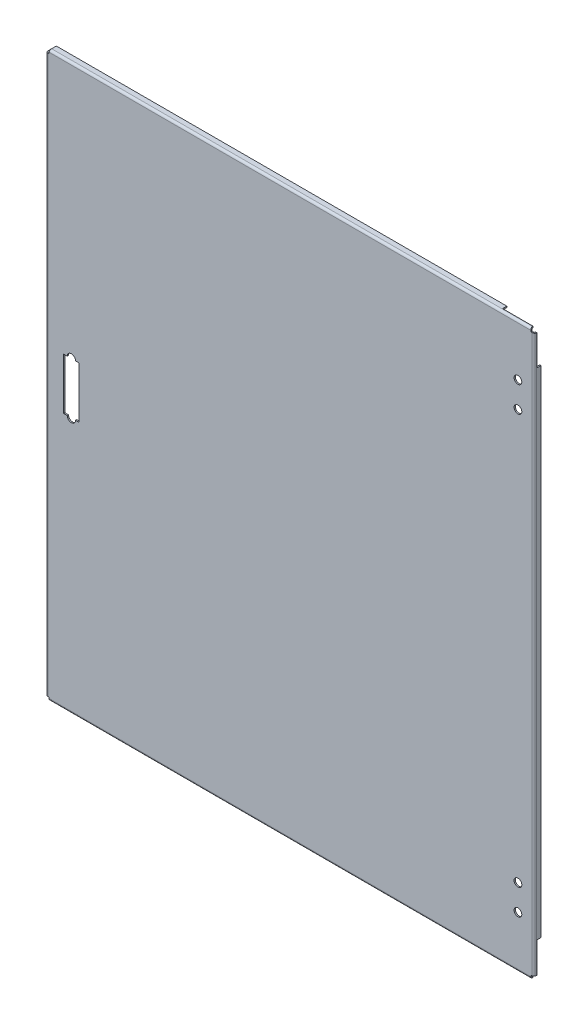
ISO-10303-21;
HEADER;
FILE_DESCRIPTION(('STEP AP214'),'2;1');
FILE_NAME('part.step','',(''),(''),'','','');
FILE_SCHEMA(('AUTOMOTIVE_DESIGN { 1 0 10303 214 1 1 1 1 }'));
ENDSEC;
DATA;
#1=APPLICATION_CONTEXT('core data for automotive mechanical design processes');
#2=APPLICATION_PROTOCOL_DEFINITION('international standard','automotive_design',2000,#1);
#3=PRODUCT_CONTEXT('',#1,'mechanical');
#4=PRODUCT('Part','Part','',(#3));
#5=PRODUCT_RELATED_PRODUCT_CATEGORY('part','',(#4));
#6=PRODUCT_DEFINITION_FORMATION('','',#4);
#7=PRODUCT_DEFINITION_CONTEXT('part definition',#1,'design');
#8=PRODUCT_DEFINITION('design','',#6,#7);
#9=PRODUCT_DEFINITION_SHAPE('','',#8);
#10=(LENGTH_UNIT() NAMED_UNIT(*) SI_UNIT(.MILLI.,.METRE.));
#11=(NAMED_UNIT(*) PLANE_ANGLE_UNIT() SI_UNIT($,.RADIAN.));
#12=(NAMED_UNIT(*) SI_UNIT($,.STERADIAN.) SOLID_ANGLE_UNIT());
#13=UNCERTAINTY_MEASURE_WITH_UNIT(LENGTH_MEASURE(1.E-05),#10,'distance_accuracy_value','');
#14=(GEOMETRIC_REPRESENTATION_CONTEXT(3) GLOBAL_UNCERTAINTY_ASSIGNED_CONTEXT((#13)) GLOBAL_UNIT_ASSIGNED_CONTEXT((#10,
#11,#12)) REPRESENTATION_CONTEXT('',''));
#15=CARTESIAN_POINT('',(0.,0.,0.));
#16=DIRECTION('',(0.,0.,1.));
#17=DIRECTION('',(1.,0.,0.));
#18=AXIS2_PLACEMENT_3D('',#15,#16,#17);
#19=CARTESIAN_POINT('',(-285.,327.5,8.));
#20=DIRECTION('',(0.,-1.,0.));
#21=DIRECTION('',(0.,0.,-1.));
#22=AXIS2_PLACEMENT_3D('',#19,#20,#21);
#23=PLANE('',#22);
#24=DIRECTION('',(0.,0.,1.));
#25=VECTOR('',#24,1.);
#26=CARTESIAN_POINT('',(245.,327.5,8.));
#27=LINE('',#26,#25);
#28=CARTESIAN_POINT('',(245.,327.5,0.));
#29=VERTEX_POINT('',#28);
#30=CARTESIAN_POINT('',(245.,327.5,5.));
#31=VERTEX_POINT('',#30);
#32=EDGE_CURVE('E668',#29,#31,#27,.T.);
#33=ORIENTED_EDGE('',*,*,#32,.T.);
#34=DIRECTION('',(-1.,0.,0.));
#35=VECTOR('',#34,1.);
#36=CARTESIAN_POINT('',(-285.,327.5,5.));
#37=LINE('',#36,#35);
#38=CARTESIAN_POINT('',(280.585786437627,327.5,5.));
#39=VERTEX_POINT('',#38);
#40=EDGE_CURVE('E655',#39,#31,#37,.T.);
#41=ORIENTED_EDGE('',*,*,#40,.F.);
#42=DIRECTION('',(0.,0.,-1.));
#43=VECTOR('',#42,1.);
#44=CARTESIAN_POINT('',(280.585786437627,327.5,6.5));
#45=LINE('',#44,#43);
#46=CARTESIAN_POINT('',(280.585786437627,327.5,5.5));
#47=VERTEX_POINT('',#46);
#48=EDGE_CURVE('E664',#47,#39,#45,.T.);
#49=ORIENTED_EDGE('',*,*,#48,.F.);
#50=DIRECTION('',(-1.,0.,0.));
#51=VECTOR('',#50,1.);
#52=CARTESIAN_POINT('',(-285.,327.5,5.5));
#53=LINE('',#52,#51);
#54=CARTESIAN_POINT('',(-280.585786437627,327.5,5.5));
#55=VERTEX_POINT('',#54);
#56=EDGE_CURVE('E648',#47,#55,#53,.T.);
#57=ORIENTED_EDGE('',*,*,#56,.T.);
#58=DIRECTION('',(0.,0.,1.));
#59=VECTOR('',#58,1.);
#60=CARTESIAN_POINT('',(-280.585786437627,327.5,0.));
#61=LINE('',#60,#59);
#62=CARTESIAN_POINT('',(-280.585786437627,327.5,0.));
#63=VERTEX_POINT('',#62);
#64=EDGE_CURVE('E663',#63,#55,#61,.T.);
#65=ORIENTED_EDGE('',*,*,#64,.F.);
#66=DIRECTION('',(1.,0.,0.));
#67=VECTOR('',#66,1.);
#68=CARTESIAN_POINT('',(-285.,327.5,0.));
#69=LINE('',#68,#67);
#70=EDGE_CURVE('E669',#63,#29,#69,.T.);
#71=ORIENTED_EDGE('',*,*,#70,.T.);
#72=EDGE_LOOP('',(#33,#41,#49,#57,#65,#71));
#73=FACE_BOUND('',#72,.T.);
#74=ADVANCED_FACE('F17',(#73),#23,.T.);
#75=CARTESIAN_POINT('',(-283.5,329.,8.));
#76=DIRECTION('',(1.,0.,0.));
#77=DIRECTION('',(0.,1.,0.));
#78=AXIS2_PLACEMENT_3D('',#75,#76,#77);
#79=PLANE('',#78);
#80=DIRECTION('',(0.,0.,1.));
#81=VECTOR('',#80,1.);
#82=CARTESIAN_POINT('',(-283.5,-324.585786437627,0.));
#83=LINE('',#82,#81);
#84=CARTESIAN_POINT('',(-283.5,-324.585786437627,0.));
#85=VERTEX_POINT('',#84);
#86=CARTESIAN_POINT('',(-283.5,-324.585786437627,5.5));
#87=VERTEX_POINT('',#86);
#88=EDGE_CURVE('E647',#85,#87,#83,.T.);
#89=ORIENTED_EDGE('',*,*,#88,.F.);
#90=DIRECTION('',(0.,1.,0.));
#91=VECTOR('',#90,1.);
#92=CARTESIAN_POINT('',(-283.5,329.,0.));
#93=LINE('',#92,#91);
#94=CARTESIAN_POINT('',(-283.5,324.585786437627,0.));
#95=VERTEX_POINT('',#94);
#96=EDGE_CURVE('E642',#85,#95,#93,.T.);
#97=ORIENTED_EDGE('',*,*,#96,.T.);
#98=DIRECTION('',(0.,0.,1.));
#99=VECTOR('',#98,1.);
#100=CARTESIAN_POINT('',(-283.5,324.585786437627,6.5));
#101=LINE('',#100,#99);
#102=CARTESIAN_POINT('',(-283.5,324.585786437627,5.5));
#103=VERTEX_POINT('',#102);
#104=EDGE_CURVE('E630',#103,#95,#101,.F.);
#105=ORIENTED_EDGE('',*,*,#104,.F.);
#106=DIRECTION('',(0.,-1.,0.));
#107=VECTOR('',#106,1.);
#108=CARTESIAN_POINT('',(-283.5,329.,5.5));
#109=LINE('',#108,#107);
#110=EDGE_CURVE('E626',#103,#87,#109,.T.);
#111=ORIENTED_EDGE('',*,*,#110,.T.);
#112=EDGE_LOOP('',(#89,#97,#105,#111));
#113=FACE_BOUND('',#112,.T.);
#114=ADVANCED_FACE('F1007',(#113),#79,.T.);
#115=CARTESIAN_POINT('',(-285.,-327.5,8.));
#116=DIRECTION('',(0.,1.,0.));
#117=DIRECTION('',(0.,0.,1.));
#118=AXIS2_PLACEMENT_3D('',#115,#116,#117);
#119=PLANE('',#118);
#120=DIRECTION('',(0.,0.,1.));
#121=VECTOR('',#120,1.);
#122=CARTESIAN_POINT('',(245.,-327.5,8.));
#123=LINE('',#122,#121);
#124=CARTESIAN_POINT('',(245.,-327.5,5.));
#125=VERTEX_POINT('',#124);
#126=CARTESIAN_POINT('',(245.,-327.5,0.));
#127=VERTEX_POINT('',#126);
#128=EDGE_CURVE('E612',#125,#127,#123,.F.);
#129=ORIENTED_EDGE('',*,*,#128,.T.);
#130=DIRECTION('',(1.,0.,0.));
#131=VECTOR('',#130,1.);
#132=CARTESIAN_POINT('',(-285.,-327.5,0.));
#133=LINE('',#132,#131);
#134=CARTESIAN_POINT('',(-280.585786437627,-327.5,0.));
#135=VERTEX_POINT('',#134);
#136=EDGE_CURVE('E603',#127,#135,#133,.F.);
#137=ORIENTED_EDGE('',*,*,#136,.T.);
#138=DIRECTION('',(0.,0.,1.));
#139=VECTOR('',#138,1.);
#140=CARTESIAN_POINT('',(-280.585786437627,-327.5,6.5));
#141=LINE('',#140,#139);
#142=CARTESIAN_POINT('',(-280.585786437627,-327.5,5.5));
#143=VERTEX_POINT('',#142);
#144=EDGE_CURVE('E593',#143,#135,#141,.F.);
#145=ORIENTED_EDGE('',*,*,#144,.F.);
#146=DIRECTION('',(1.,0.,0.));
#147=VECTOR('',#146,1.);
#148=CARTESIAN_POINT('',(-285.,-327.5,5.5));
#149=LINE('',#148,#147);
#150=CARTESIAN_POINT('',(280.585786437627,-327.5,5.5));
#151=VERTEX_POINT('',#150);
#152=EDGE_CURVE('E580',#143,#151,#149,.T.);
#153=ORIENTED_EDGE('',*,*,#152,.T.);
#154=DIRECTION('',(0.,0.,-1.));
#155=VECTOR('',#154,1.);
#156=CARTESIAN_POINT('',(280.585786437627,-327.5,5.));
#157=LINE('',#156,#155);
#158=CARTESIAN_POINT('',(280.585786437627,-327.5,5.));
#159=VERTEX_POINT('',#158);
#160=EDGE_CURVE('E584',#159,#151,#157,.F.);
#161=ORIENTED_EDGE('',*,*,#160,.F.);
#162=DIRECTION('',(1.,0.,0.));
#163=VECTOR('',#162,1.);
#164=CARTESIAN_POINT('',(-285.,-327.5,5.));
#165=LINE('',#164,#163);
#166=EDGE_CURVE('E629',#159,#125,#165,.F.);
#167=ORIENTED_EDGE('',*,*,#166,.T.);
#168=EDGE_LOOP('',(#129,#137,#145,#153,#161,#167));
#169=FACE_BOUND('',#168,.T.);
#170=ADVANCED_FACE('F1011',(#169),#119,.T.);
#171=CARTESIAN_POINT('',(283.5,329.,8.));
#172=DIRECTION('',(-1.,0.,0.));
#173=DIRECTION('',(0.,-1.,0.));
#174=AXIS2_PLACEMENT_3D('',#171,#172,#173);
#175=PLANE('',#174);
#176=DIRECTION('',(0.,0.,1.));
#177=VECTOR('',#176,1.);
#178=CARTESIAN_POINT('',(283.5,-289.,8.));
#179=LINE('',#178,#177);
#180=CARTESIAN_POINT('',(283.5,-289.,0.));
#181=VERTEX_POINT('',#180);
#182=CARTESIAN_POINT('',(283.5,-289.,5.));
#183=VERTEX_POINT('',#182);
#184=EDGE_CURVE('E556',#181,#183,#179,.T.);
#185=ORIENTED_EDGE('',*,*,#184,.T.);
#186=DIRECTION('',(0.,1.,0.));
#187=VECTOR('',#186,1.);
#188=CARTESIAN_POINT('',(283.5,329.,5.));
#189=LINE('',#188,#187);
#190=CARTESIAN_POINT('',(283.5,-324.585786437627,5.));
#191=VERTEX_POINT('',#190);
#192=EDGE_CURVE('E555',#183,#191,#189,.F.);
#193=ORIENTED_EDGE('',*,*,#192,.T.);
#194=DIRECTION('',(0.,0.,1.));
#195=VECTOR('',#194,1.);
#196=CARTESIAN_POINT('',(283.5,-324.585786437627,6.5));
#197=LINE('',#196,#195);
#198=CARTESIAN_POINT('',(283.5,-324.585786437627,5.5));
#199=VERTEX_POINT('',#198);
#200=EDGE_CURVE('E572',#199,#191,#197,.F.);
#201=ORIENTED_EDGE('',*,*,#200,.F.);
#202=DIRECTION('',(0.,1.,0.));
#203=VECTOR('',#202,1.);
#204=CARTESIAN_POINT('',(283.5,329.,5.5));
#205=LINE('',#204,#203);
#206=CARTESIAN_POINT('',(283.5,324.585786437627,5.5));
#207=VERTEX_POINT('',#206);
#208=EDGE_CURVE('E542',#199,#207,#205,.T.);
#209=ORIENTED_EDGE('',*,*,#208,.T.);
#210=DIRECTION('',(0.,0.,1.));
#211=VECTOR('',#210,1.);
#212=CARTESIAN_POINT('',(283.5,324.585786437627,5.));
#213=LINE('',#212,#211);
#214=CARTESIAN_POINT('',(283.5,324.585786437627,5.));
#215=VERTEX_POINT('',#214);
#216=EDGE_CURVE('E274',#215,#207,#213,.T.);
#217=ORIENTED_EDGE('',*,*,#216,.F.);
#218=DIRECTION('',(0.,1.,0.));
#219=VECTOR('',#218,1.);
#220=CARTESIAN_POINT('',(283.5,329.,5.));
#221=LINE('',#220,#219);
#222=CARTESIAN_POINT('',(283.5,289.,5.));
#223=VERTEX_POINT('',#222);
#224=EDGE_CURVE('E575',#223,#215,#221,.T.);
#225=ORIENTED_EDGE('',*,*,#224,.F.);
#226=DIRECTION('',(0.,0.,1.));
#227=VECTOR('',#226,1.);
#228=CARTESIAN_POINT('',(283.5,289.,8.));
#229=LINE('',#228,#227);
#230=CARTESIAN_POINT('',(283.5,289.,0.));
#231=VERTEX_POINT('',#230);
#232=EDGE_CURVE('E725',#223,#231,#229,.F.);
#233=ORIENTED_EDGE('',*,*,#232,.T.);
#234=DIRECTION('',(0.,1.,0.));
#235=VECTOR('',#234,1.);
#236=CARTESIAN_POINT('',(283.5,329.,0.));
#237=LINE('',#236,#235);
#238=EDGE_CURVE('E562',#231,#181,#237,.F.);
#239=ORIENTED_EDGE('',*,*,#238,.T.);
#240=EDGE_LOOP('',(#185,#193,#201,#209,#217,#225,#233,#239));
#241=FACE_BOUND('',#240,.T.);
#242=ADVANCED_FACE('F1015',(#241),#175,.T.);
#243=CARTESIAN_POINT('',(280.585786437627,327.5,6.5));
#244=DIRECTION('',(1.,0.,0.));
#245=DIRECTION('',(0.,0.,-1.));
#246=AXIS2_PLACEMENT_3D('',#243,#244,#245);
#247=PLANE('',#246);
#248=DIRECTION('',(0.,1.,0.));
#249=VECTOR('',#248,1.);
#250=CARTESIAN_POINT('',(280.585786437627,328.25,5.5));
#251=LINE('',#250,#249);
#252=CARTESIAN_POINT('',(280.585786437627,329.,5.5));
#253=VERTEX_POINT('',#252);
#254=EDGE_CURVE('E515',#47,#253,#251,.T.);
#255=ORIENTED_EDGE('',*,*,#254,.F.);
#256=ORIENTED_EDGE('',*,*,#48,.T.);
#257=DIRECTION('',(0.,1.,0.));
#258=VECTOR('',#257,1.);
#259=CARTESIAN_POINT('',(280.585786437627,327.5,5.));
#260=LINE('',#259,#258);
#261=CARTESIAN_POINT('',(280.585786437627,329.,5.));
#262=VERTEX_POINT('',#261);
#263=EDGE_CURVE('E659',#262,#39,#260,.F.);
#264=ORIENTED_EDGE('',*,*,#263,.F.);
#265=DIRECTION('',(0.,0.,-1.));
#266=VECTOR('',#265,1.);
#267=CARTESIAN_POINT('',(280.585786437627,329.,6.5));
#268=LINE('',#267,#266);
#269=EDGE_CURVE('E677',#262,#253,#268,.F.);
#270=ORIENTED_EDGE('',*,*,#269,.T.);
#271=EDGE_LOOP('',(#255,#256,#264,#270));
#272=FACE_BOUND('',#271,.T.);
#273=ADVANCED_FACE('F1019',(#272),#247,.T.);
#274=CARTESIAN_POINT('',(-280.585786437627,327.5,0.));
#275=DIRECTION('',(-1.,0.,0.));
#276=DIRECTION('',(0.,0.,1.));
#277=AXIS2_PLACEMENT_3D('',#274,#275,#276);
#278=PLANE('',#277);
#279=DIRECTION('',(0.,1.,0.));
#280=VECTOR('',#279,1.);
#281=CARTESIAN_POINT('',(-280.585786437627,327.5,0.));
#282=LINE('',#281,#280);
#283=CARTESIAN_POINT('',(-280.585786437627,329.,0.));
#284=VERTEX_POINT('',#283);
#285=EDGE_CURVE('E665',#284,#63,#282,.F.);
#286=ORIENTED_EDGE('',*,*,#285,.T.);
#287=ORIENTED_EDGE('',*,*,#64,.T.);
#288=DIRECTION('',(0.,1.,0.));
#289=VECTOR('',#288,1.);
#290=CARTESIAN_POINT('',(-280.585786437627,327.5,5.5));
#291=LINE('',#290,#289);
#292=CARTESIAN_POINT('',(-280.585786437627,329.,5.5));
#293=VERTEX_POINT('',#292);
#294=EDGE_CURVE('E661',#55,#293,#291,.T.);
#295=ORIENTED_EDGE('',*,*,#294,.T.);
#296=DIRECTION('',(0.,0.,-1.));
#297=VECTOR('',#296,1.);
#298=CARTESIAN_POINT('',(-280.585786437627,329.,8.));
#299=LINE('',#298,#297);
#300=EDGE_CURVE('E511',#293,#284,#299,.T.);
#301=ORIENTED_EDGE('',*,*,#300,.T.);
#302=EDGE_LOOP('',(#286,#287,#295,#301));
#303=FACE_BOUND('',#302,.T.);
#304=ADVANCED_FACE('F1023',(#303),#278,.T.);
#305=CARTESIAN_POINT('',(-285.,327.5,0.));
#306=DIRECTION('',(0.,0.,1.));
#307=DIRECTION('',(1.,0.,0.));
#308=AXIS2_PLACEMENT_3D('',#305,#306,#307);
#309=PLANE('',#308);
#310=DIRECTION('',(1.,0.,0.));
#311=VECTOR('',#310,1.);
#312=CARTESIAN_POINT('',(-285.,329.,0.));
#313=LINE('',#312,#311);
#314=CARTESIAN_POINT('',(245.,329.,0.));
#315=VERTEX_POINT('',#314);
#316=EDGE_CURVE('E510',#284,#315,#313,.T.);
#317=ORIENTED_EDGE('',*,*,#316,.T.);
#318=DIRECTION('',(0.,1.,0.));
#319=VECTOR('',#318,1.);
#320=CARTESIAN_POINT('',(245.,327.5,0.));
#321=LINE('',#320,#319);
#322=EDGE_CURVE('E660',#315,#29,#321,.F.);
#323=ORIENTED_EDGE('',*,*,#322,.T.);
#324=ORIENTED_EDGE('',*,*,#70,.F.);
#325=ORIENTED_EDGE('',*,*,#285,.F.);
#326=EDGE_LOOP('',(#317,#323,#324,#325));
#327=FACE_BOUND('',#326,.T.);
#328=ADVANCED_FACE('F1027',(#327),#309,.F.);
#329=CARTESIAN_POINT('',(245.,327.5,8.));
#330=DIRECTION('',(-1.,0.,0.));
#331=DIRECTION('',(0.,0.,1.));
#332=AXIS2_PLACEMENT_3D('',#329,#330,#331);
#333=PLANE('',#332);
#334=DIRECTION('',(0.,0.,-1.));
#335=VECTOR('',#334,1.);
#336=CARTESIAN_POINT('',(245.,329.,8.));
#337=LINE('',#336,#335);
#338=CARTESIAN_POINT('',(245.,329.,5.));
#339=VERTEX_POINT('',#338);
#340=EDGE_CURVE('E507',#315,#339,#337,.F.);
#341=ORIENTED_EDGE('',*,*,#340,.T.);
#342=DIRECTION('',(0.,1.,0.));
#343=VECTOR('',#342,1.);
#344=CARTESIAN_POINT('',(245.,327.5,5.));
#345=LINE('',#344,#343);
#346=EDGE_CURVE('E656',#31,#339,#345,.T.);
#347=ORIENTED_EDGE('',*,*,#346,.F.);
#348=ORIENTED_EDGE('',*,*,#32,.F.);
#349=ORIENTED_EDGE('',*,*,#322,.F.);
#350=EDGE_LOOP('',(#341,#347,#348,#349));
#351=FACE_BOUND('',#350,.T.);
#352=ADVANCED_FACE('F1031',(#351),#333,.F.);
#353=CARTESIAN_POINT('',(-285.,327.5,5.));
#354=DIRECTION('',(0.,0.,-1.));
#355=DIRECTION('',(-1.,0.,0.));
#356=AXIS2_PLACEMENT_3D('',#353,#354,#355);
#357=PLANE('',#356);
#358=ORIENTED_EDGE('',*,*,#263,.T.);
#359=ORIENTED_EDGE('',*,*,#40,.T.);
#360=ORIENTED_EDGE('',*,*,#346,.T.);
#361=DIRECTION('',(1.,0.,0.));
#362=VECTOR('',#361,1.);
#363=CARTESIAN_POINT('',(-285.,329.,5.));
#364=LINE('',#363,#362);
#365=EDGE_CURVE('E506',#339,#262,#364,.T.);
#366=ORIENTED_EDGE('',*,*,#365,.T.);
#367=EDGE_LOOP('',(#358,#359,#360,#366));
#368=FACE_BOUND('',#367,.T.);
#369=ADVANCED_FACE('F1035',(#368),#357,.T.);
#370=CARTESIAN_POINT('',(-285.,326.5,5.5));
#371=DIRECTION('',(-1.,0.,0.));
#372=DIRECTION('',(0.,0.,1.));
#373=AXIS2_PLACEMENT_3D('',#370,#371,#372);
#374=CYLINDRICAL_SURFACE('',#373,1.);
#375=DIRECTION('',(1.,0.,0.));
#376=VECTOR('',#375,1.);
#377=CARTESIAN_POINT('',(0.,326.5,6.5));
#378=LINE('',#377,#376);
#379=CARTESIAN_POINT('',(281.,326.5,6.5));
#380=VERTEX_POINT('',#379);
#381=CARTESIAN_POINT('',(-281.,326.5,6.5));
#382=VERTEX_POINT('',#381);
#383=EDGE_CURVE('E690',#380,#382,#378,.F.);
#384=ORIENTED_EDGE('',*,*,#383,.T.);
#385=CARTESIAN_POINT('',(-280.585786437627,327.5,5.5));
#386=CARTESIAN_POINT('',(-280.585791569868,327.500003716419,5.52396943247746));
#387=CARTESIAN_POINT('',(-280.586773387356,327.499137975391,5.5479053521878));
#388=CARTESIAN_POINT('',(-280.590400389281,327.495715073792,5.59548683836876));
#389=CARTESIAN_POINT('',(-280.593042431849,327.493161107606,5.61913286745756));
#390=CARTESIAN_POINT('',(-280.602973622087,327.483091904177,5.68902809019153));
#391=CARTESIAN_POINT('',(-280.612278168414,327.473167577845,5.7346591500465));
#392=CARTESIAN_POINT('',(-280.634406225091,327.447540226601,5.82290837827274));
#393=CARTESIAN_POINT('',(-280.647204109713,327.431879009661,5.86554574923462));
#394=CARTESIAN_POINT('',(-280.675097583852,327.395271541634,5.94779358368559));
#395=CARTESIAN_POINT('',(-280.690198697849,327.374312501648,5.98739641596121));
#396=CARTESIAN_POINT('',(-280.724891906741,327.322911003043,6.07067351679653));
#397=CARTESIAN_POINT('',(-280.744777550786,327.291409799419,6.11357339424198));
#398=CARTESIAN_POINT('',(-280.785118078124,327.222188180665,6.19372196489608));
#399=CARTESIAN_POINT('',(-280.805573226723,327.184464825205,6.23096797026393));
#400=CARTESIAN_POINT('',(-280.848385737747,327.098226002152,6.30355152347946));
#401=CARTESIAN_POINT('',(-280.870653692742,327.04894798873,6.33804227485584));
#402=CARTESIAN_POINT('',(-280.912397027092,326.944053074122,6.39803056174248));
#403=CARTESIAN_POINT('',(-280.931873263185,326.888438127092,6.42353085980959));
#404=CARTESIAN_POINT('',(-280.960415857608,326.789088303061,6.4582978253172));
#405=CARTESIAN_POINT('',(-280.970860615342,326.746640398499,6.47013135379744));
#406=CARTESIAN_POINT('',(-280.987595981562,326.6598558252,6.48812321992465));
#407=CARTESIAN_POINT('',(-280.993903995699,326.615527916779,6.49430537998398));
#408=CARTESIAN_POINT('',(-280.999036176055,326.547279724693,6.49916544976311));
#409=CARTESIAN_POINT('',(-280.999990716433,326.52364981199,6.50001170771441));
#410=CARTESIAN_POINT('',(-281.,326.5,6.5));
#411=B_SPLINE_CURVE_WITH_KNOTS('',3,(#385,#386,#387,#388,#389,#390,#391,#392,#393,#394,#395,
#396,#397,#398,#399,#400,#401,#402,#403,#404,#405,#406,#407,#408,#409,#410),.UNSPECIFIED.,.F.,
.F.,(4,2,2,2,2,2,2,2,2,2,2,2,4),(0.,0.0718194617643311,0.143503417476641,0.285617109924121,
0.426715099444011,0.568157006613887,0.73794208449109,0.907807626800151,1.09930104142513,
1.29073556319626,1.42614133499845,1.56097365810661,1.6318694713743),.UNSPECIFIED.);
#412=EDGE_CURVE('E503',#55,#382,#411,.T.);
#413=ORIENTED_EDGE('',*,*,#412,.F.);
#414=ORIENTED_EDGE('',*,*,#56,.F.);
#415=CARTESIAN_POINT('',(281.,326.5,6.5));
#416=CARTESIAN_POINT('',(280.999994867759,326.523969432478,6.50000371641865));
#417=CARTESIAN_POINT('',(280.999013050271,326.547905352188,6.49913797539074));
#418=CARTESIAN_POINT('',(280.995386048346,326.595486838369,6.49571507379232));
#419=CARTESIAN_POINT('',(280.992744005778,326.619132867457,6.49316110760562));
#420=CARTESIAN_POINT('',(280.982812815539,326.689028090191,6.48309190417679));
#421=CARTESIAN_POINT('',(280.973508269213,326.734659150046,6.47316757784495));
#422=CARTESIAN_POINT('',(280.951380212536,326.822908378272,6.44754022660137));
#423=CARTESIAN_POINT('',(280.938582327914,326.865545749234,6.43187900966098));
#424=CARTESIAN_POINT('',(280.910688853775,326.947793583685,6.39527154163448));
#425=CARTESIAN_POINT('',(280.895587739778,326.987396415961,6.37431250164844));
#426=CARTESIAN_POINT('',(280.860894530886,327.070673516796,6.32291100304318));
#427=CARTESIAN_POINT('',(280.841008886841,327.113573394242,6.2914097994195));
#428=CARTESIAN_POINT('',(280.800668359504,327.193721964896,6.22218818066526));
#429=CARTESIAN_POINT('',(280.780213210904,327.230967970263,6.18446482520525));
#430=CARTESIAN_POINT('',(280.73740069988,327.303551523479,6.09822600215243));
#431=CARTESIAN_POINT('',(280.715132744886,327.338042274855,6.04894798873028));
#432=CARTESIAN_POINT('',(280.673389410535,327.398030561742,5.94405307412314));
#433=CARTESIAN_POINT('',(280.653913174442,327.42353085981,5.88843812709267));
#434=CARTESIAN_POINT('',(280.625370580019,327.458297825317,5.78908830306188));
#435=CARTESIAN_POINT('',(280.614925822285,327.470131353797,5.74664039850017));
#436=CARTESIAN_POINT('',(280.598190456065,327.488123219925,5.65985582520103));
#437=CARTESIAN_POINT('',(280.591882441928,327.494305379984,5.61552791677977));
#438=CARTESIAN_POINT('',(280.586750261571,327.499165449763,5.54727972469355));
#439=CARTESIAN_POINT('',(280.585795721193,327.500011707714,5.52364981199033));
#440=CARTESIAN_POINT('',(280.585786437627,327.5,5.5));
#441=B_SPLINE_CURVE_WITH_KNOTS('',3,(#415,#416,#417,#418,#419,#420,#421,#422,#423,#424,#425,
#426,#427,#428,#429,#430,#431,#432,#433,#434,#435,#436,#437,#438,#439,#440),.UNSPECIFIED.,.F.,
.F.,(4,2,2,2,2,2,2,2,2,2,2,2,4),(0.,0.0718194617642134,0.143503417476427,0.285617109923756,
0.426715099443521,0.568157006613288,0.737942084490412,0.907807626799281,1.09930104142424,
1.2907355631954,1.42614133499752,1.56097365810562,1.63186947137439),.UNSPECIFIED.);
#442=EDGE_CURVE('E24',#380,#47,#441,.T.);
#443=ORIENTED_EDGE('',*,*,#442,.F.);
#444=EDGE_LOOP('',(#384,#413,#414,#443));
#445=FACE_BOUND('',#444,.T.);
#446=ADVANCED_FACE('F1038',(#445),#374,.F.);
#447=CARTESIAN_POINT('',(-283.5,-324.585786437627,0.));
#448=DIRECTION('',(0.,-1.,0.));
#449=DIRECTION('',(1.,0.,0.));
#450=AXIS2_PLACEMENT_3D('',#447,#448,#449);
#451=PLANE('',#450);
#452=DIRECTION('',(1.,0.,0.));
#453=VECTOR('',#452,1.);
#454=CARTESIAN_POINT('',(-283.5,-324.585786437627,0.));
#455=LINE('',#454,#453);
#456=CARTESIAN_POINT('',(-285.,-324.585786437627,0.));
#457=VERTEX_POINT('',#456);
#458=EDGE_CURVE('E634',#457,#85,#455,.T.);
#459=ORIENTED_EDGE('',*,*,#458,.T.);
#460=ORIENTED_EDGE('',*,*,#88,.T.);
#461=DIRECTION('',(1.,0.,0.));
#462=VECTOR('',#461,1.);
#463=CARTESIAN_POINT('',(-283.5,-324.585786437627,5.5));
#464=LINE('',#463,#462);
#465=CARTESIAN_POINT('',(-285.,-324.585786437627,5.5));
#466=VERTEX_POINT('',#465);
#467=EDGE_CURVE('E645',#87,#466,#464,.F.);
#468=ORIENTED_EDGE('',*,*,#467,.T.);
#469=DIRECTION('',(0.,0.,1.));
#470=VECTOR('',#469,1.);
#471=CARTESIAN_POINT('',(-285.,-324.585786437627,8.));
#472=LINE('',#471,#470);
#473=EDGE_CURVE('E495',#466,#457,#472,.F.);
#474=ORIENTED_EDGE('',*,*,#473,.T.);
#475=EDGE_LOOP('',(#459,#460,#468,#474));
#476=FACE_BOUND('',#475,.T.);
#477=ADVANCED_FACE('F1043',(#476),#451,.T.);
#478=CARTESIAN_POINT('',(-283.5,329.,0.));
#479=DIRECTION('',(0.,0.,1.));
#480=DIRECTION('',(1.,0.,0.));
#481=AXIS2_PLACEMENT_3D('',#478,#479,#480);
#482=PLANE('',#481);
#483=DIRECTION('',(0.,1.,0.));
#484=VECTOR('',#483,1.);
#485=CARTESIAN_POINT('',(-285.,329.,0.));
#486=LINE('',#485,#484);
#487=CARTESIAN_POINT('',(-285.,324.585786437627,0.));
#488=VERTEX_POINT('',#487);
#489=EDGE_CURVE('E492',#457,#488,#486,.T.);
#490=ORIENTED_EDGE('',*,*,#489,.T.);
#491=DIRECTION('',(-1.,0.,0.));
#492=VECTOR('',#491,1.);
#493=CARTESIAN_POINT('',(-283.5,324.585786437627,0.));
#494=LINE('',#493,#492);
#495=EDGE_CURVE('E631',#95,#488,#494,.T.);
#496=ORIENTED_EDGE('',*,*,#495,.F.);
#497=ORIENTED_EDGE('',*,*,#96,.F.);
#498=ORIENTED_EDGE('',*,*,#458,.F.);
#499=EDGE_LOOP('',(#490,#496,#497,#498));
#500=FACE_BOUND('',#499,.T.);
#501=ADVANCED_FACE('F1047',(#500),#482,.F.);
#502=CARTESIAN_POINT('',(-283.5,324.585786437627,6.5));
#503=DIRECTION('',(0.,1.,0.));
#504=DIRECTION('',(-1.,0.,0.));
#505=AXIS2_PLACEMENT_3D('',#502,#503,#504);
#506=PLANE('',#505);
#507=DIRECTION('',(-1.,0.,0.));
#508=VECTOR('',#507,1.);
#509=CARTESIAN_POINT('',(-284.25,324.585786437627,5.5));
#510=LINE('',#509,#508);
#511=CARTESIAN_POINT('',(-285.,324.585786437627,5.5));
#512=VERTEX_POINT('',#511);
#513=EDGE_CURVE('E500',#103,#512,#510,.T.);
#514=ORIENTED_EDGE('',*,*,#513,.F.);
#515=ORIENTED_EDGE('',*,*,#104,.T.);
#516=ORIENTED_EDGE('',*,*,#495,.T.);
#517=DIRECTION('',(0.,0.,1.));
#518=VECTOR('',#517,1.);
#519=CARTESIAN_POINT('',(-285.,324.585786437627,8.));
#520=LINE('',#519,#518);
#521=EDGE_CURVE('E490',#488,#512,#520,.T.);
#522=ORIENTED_EDGE('',*,*,#521,.T.);
#523=EDGE_LOOP('',(#514,#515,#516,#522));
#524=FACE_BOUND('',#523,.T.);
#525=ADVANCED_FACE('F923',(#524),#506,.T.);
#526=CARTESIAN_POINT('',(-282.5,329.,5.5));
#527=DIRECTION('',(0.,-1.,0.));
#528=DIRECTION('',(1.,0.,0.));
#529=AXIS2_PLACEMENT_3D('',#526,#527,#528);
#530=CYLINDRICAL_SURFACE('',#529,1.);
#531=DIRECTION('',(0.,1.,0.));
#532=VECTOR('',#531,1.);
#533=CARTESIAN_POINT('',(-282.5,0.,6.5));
#534=LINE('',#533,#532);
#535=CARTESIAN_POINT('',(-282.5,325.,6.5));
#536=VERTEX_POINT('',#535);
#537=CARTESIAN_POINT('',(-282.5,-325.,6.5));
#538=VERTEX_POINT('',#537);
#539=EDGE_CURVE('E710',#536,#538,#534,.F.);
#540=ORIENTED_EDGE('',*,*,#539,.T.);
#541=CARTESIAN_POINT('',(-283.5,-324.585786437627,5.5));
#542=CARTESIAN_POINT('',(-283.500003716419,-324.585791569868,5.52396943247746));
#543=CARTESIAN_POINT('',(-283.499137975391,-324.586773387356,5.54790535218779));
#544=CARTESIAN_POINT('',(-283.495715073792,-324.590400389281,5.59548683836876));
#545=CARTESIAN_POINT('',(-283.493161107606,-324.593042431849,5.61913286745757));
#546=CARTESIAN_POINT('',(-283.483091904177,-324.602973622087,5.68902809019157));
#547=CARTESIAN_POINT('',(-283.473167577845,-324.612278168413,5.73465915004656));
#548=CARTESIAN_POINT('',(-283.447540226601,-324.634406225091,5.82290837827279));
#549=CARTESIAN_POINT('',(-283.431879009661,-324.647204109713,5.86554574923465));
#550=CARTESIAN_POINT('',(-283.395271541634,-324.675097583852,5.9477935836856));
#551=CARTESIAN_POINT('',(-283.374312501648,-324.690198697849,5.98739641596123));
#552=CARTESIAN_POINT('',(-283.322911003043,-324.724891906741,6.0706735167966));
#553=CARTESIAN_POINT('',(-283.291409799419,-324.744777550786,6.11357339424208));
#554=CARTESIAN_POINT('',(-283.222188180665,-324.785118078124,6.19372196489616));
#555=CARTESIAN_POINT('',(-283.184464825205,-324.805573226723,6.23096797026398));
#556=CARTESIAN_POINT('',(-283.098226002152,-324.848385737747,6.30355152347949));
#557=CARTESIAN_POINT('',(-283.04894798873,-324.870653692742,6.33804227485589));
#558=CARTESIAN_POINT('',(-282.944053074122,-324.912397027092,6.39803056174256));
#559=CARTESIAN_POINT('',(-282.888438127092,-324.931873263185,6.42353085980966));
#560=CARTESIAN_POINT('',(-282.789088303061,-324.960415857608,6.45829782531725));
#561=CARTESIAN_POINT('',(-282.746640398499,-324.970860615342,6.47013135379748));
#562=CARTESIAN_POINT('',(-282.6598558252,-324.987595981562,6.48812321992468));
#563=CARTESIAN_POINT('',(-282.615527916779,-324.993903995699,6.494305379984));
#564=CARTESIAN_POINT('',(-282.547279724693,-324.999036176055,6.49916544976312));
#565=CARTESIAN_POINT('',(-282.52364981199,-324.999990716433,6.50001170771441));
#566=CARTESIAN_POINT('',(-282.5,-325.,6.5));
#567=B_SPLINE_CURVE_WITH_KNOTS('',3,(#541,#542,#543,#544,#545,#546,#547,#548,#549,#550,#551,
#552,#553,#554,#555,#556,#557,#558,#559,#560,#561,#562,#563,#564,#565,#566),.UNSPECIFIED.,.F.,
.F.,(4,2,2,2,2,2,2,2,2,2,2,2,4),(0.,0.0718194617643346,0.143503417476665,0.285617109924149,
0.426715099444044,0.568157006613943,0.737942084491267,0.907807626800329,1.09930104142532,
1.29073556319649,1.42614133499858,1.56097365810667,1.6318694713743),.UNSPECIFIED.);
#568=EDGE_CURVE('E487',#87,#538,#567,.T.);
#569=ORIENTED_EDGE('',*,*,#568,.F.);
#570=ORIENTED_EDGE('',*,*,#110,.F.);
#571=CARTESIAN_POINT('',(-282.5,325.,6.5));
#572=CARTESIAN_POINT('',(-282.523969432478,324.999994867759,6.50000371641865));
#573=CARTESIAN_POINT('',(-282.547905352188,324.999013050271,6.49913797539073));
#574=CARTESIAN_POINT('',(-282.595486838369,324.995386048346,6.49571507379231));
#575=CARTESIAN_POINT('',(-282.619132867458,324.992744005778,6.49316110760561));
#576=CARTESIAN_POINT('',(-282.689028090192,324.98281281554,6.48309190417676));
#577=CARTESIAN_POINT('',(-282.734659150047,324.973508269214,6.47316757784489));
#578=CARTESIAN_POINT('',(-282.822908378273,324.951380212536,6.44754022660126));
#579=CARTESIAN_POINT('',(-282.865545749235,324.938582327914,6.43187900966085));
#580=CARTESIAN_POINT('',(-282.947793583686,324.910688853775,6.39527154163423));
#581=CARTESIAN_POINT('',(-282.987396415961,324.895587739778,6.37431250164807));
#582=CARTESIAN_POINT('',(-283.070673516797,324.860894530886,6.32291100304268));
#583=CARTESIAN_POINT('',(-283.113573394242,324.841008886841,6.291409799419));
#584=CARTESIAN_POINT('',(-283.193721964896,324.800668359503,6.22218818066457));
#585=CARTESIAN_POINT('',(-283.230967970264,324.780213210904,6.18446482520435));
#586=CARTESIAN_POINT('',(-283.30355152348,324.73740069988,6.09822600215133));
#587=CARTESIAN_POINT('',(-283.338042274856,324.715132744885,6.04894798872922));
#588=CARTESIAN_POINT('',(-283.398030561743,324.673389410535,5.944053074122));
#589=CARTESIAN_POINT('',(-283.42353085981,324.653913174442,5.88843812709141));
#590=CARTESIAN_POINT('',(-283.458297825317,324.625370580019,5.78908830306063));
#591=CARTESIAN_POINT('',(-283.470131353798,324.614925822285,5.74664039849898));
#592=CARTESIAN_POINT('',(-283.488123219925,324.598190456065,5.65985582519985));
#593=CARTESIAN_POINT('',(-283.494305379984,324.591882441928,5.61552791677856));
#594=CARTESIAN_POINT('',(-283.499165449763,324.586750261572,5.54727972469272));
#595=CARTESIAN_POINT('',(-283.500011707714,324.585795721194,5.5236498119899));
#596=CARTESIAN_POINT('',(-283.5,324.585786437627,5.5));
#597=B_SPLINE_CURVE_WITH_KNOTS('',3,(#571,#572,#573,#574,#575,#576,#577,#578,#579,#580,#581,
#582,#583,#584,#585,#586,#587,#588,#589,#590,#591,#592,#593,#594,#595,#596),.UNSPECIFIED.,.F.,
.F.,(4,2,2,2,2,2,2,2,2,2,2,2,4),(0.,0.0718194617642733,0.143503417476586,0.285617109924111,
0.426715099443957,0.568157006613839,0.737942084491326,0.907807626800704,1.09930104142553,
1.29073556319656,1.42614133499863,1.56097365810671,1.63186947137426),.UNSPECIFIED.);
#598=EDGE_CURVE('E497',#536,#103,#597,.T.);
#599=ORIENTED_EDGE('',*,*,#598,.F.);
#600=EDGE_LOOP('',(#540,#569,#570,#599));
#601=FACE_BOUND('',#600,.T.);
#602=ADVANCED_FACE('F918',(#601),#530,.F.);
#603=CARTESIAN_POINT('',(-285.,-327.5,5.));
#604=DIRECTION('',(0.,0.,1.));
#605=DIRECTION('',(1.,0.,0.));
#606=AXIS2_PLACEMENT_3D('',#603,#604,#605);
#607=PLANE('',#606);
#608=DIRECTION('',(1.,0.,0.));
#609=VECTOR('',#608,1.);
#610=CARTESIAN_POINT('',(-285.,-329.,5.));
#611=LINE('',#610,#609);
#612=CARTESIAN_POINT('',(280.585786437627,-329.,5.));
#613=VERTEX_POINT('',#612);
#614=CARTESIAN_POINT('',(245.,-329.,5.));
#615=VERTEX_POINT('',#614);
#616=EDGE_CURVE('E480',#613,#615,#611,.F.);
#617=ORIENTED_EDGE('',*,*,#616,.T.);
#618=DIRECTION('',(0.,1.,0.));
#619=VECTOR('',#618,1.);
#620=CARTESIAN_POINT('',(245.,-327.5,5.));
#621=LINE('',#620,#619);
#622=EDGE_CURVE('E609',#615,#125,#621,.T.);
#623=ORIENTED_EDGE('',*,*,#622,.T.);
#624=ORIENTED_EDGE('',*,*,#166,.F.);
#625=DIRECTION('',(0.,1.,0.));
#626=VECTOR('',#625,1.);
#627=CARTESIAN_POINT('',(280.585786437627,-327.5,5.));
#628=LINE('',#627,#626);
#629=EDGE_CURVE('E587',#613,#159,#628,.T.);
#630=ORIENTED_EDGE('',*,*,#629,.F.);
#631=EDGE_LOOP('',(#617,#623,#624,#630));
#632=FACE_BOUND('',#631,.T.);
#633=ADVANCED_FACE('F915',(#632),#607,.F.);
#634=CARTESIAN_POINT('',(245.,-327.5,8.));
#635=DIRECTION('',(-1.,0.,0.));
#636=DIRECTION('',(0.,0.,1.));
#637=AXIS2_PLACEMENT_3D('',#634,#635,#636);
#638=PLANE('',#637);
#639=DIRECTION('',(0.,0.,1.));
#640=VECTOR('',#639,1.);
#641=CARTESIAN_POINT('',(245.,-329.,8.));
#642=LINE('',#641,#640);
#643=CARTESIAN_POINT('',(245.,-329.,0.));
#644=VERTEX_POINT('',#643);
#645=EDGE_CURVE('E598',#615,#644,#642,.F.);
#646=ORIENTED_EDGE('',*,*,#645,.T.);
#647=DIRECTION('',(0.,1.,0.));
#648=VECTOR('',#647,1.);
#649=CARTESIAN_POINT('',(245.,-327.5,0.));
#650=LINE('',#649,#648);
#651=EDGE_CURVE('E594',#644,#127,#650,.T.);
#652=ORIENTED_EDGE('',*,*,#651,.T.);
#653=ORIENTED_EDGE('',*,*,#128,.F.);
#654=ORIENTED_EDGE('',*,*,#622,.F.);
#655=EDGE_LOOP('',(#646,#652,#653,#654));
#656=FACE_BOUND('',#655,.T.);
#657=ADVANCED_FACE('F911',(#656),#638,.F.);
#658=CARTESIAN_POINT('',(-285.,-327.5,0.));
#659=DIRECTION('',(0.,0.,1.));
#660=DIRECTION('',(1.,0.,0.));
#661=AXIS2_PLACEMENT_3D('',#658,#659,#660);
#662=PLANE('',#661);
#663=DIRECTION('',(1.,0.,0.));
#664=VECTOR('',#663,1.);
#665=CARTESIAN_POINT('',(-285.,-329.,0.));
#666=LINE('',#665,#664);
#667=CARTESIAN_POINT('',(-280.585786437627,-329.,0.));
#668=VERTEX_POINT('',#667);
#669=EDGE_CURVE('E474',#644,#668,#666,.F.);
#670=ORIENTED_EDGE('',*,*,#669,.T.);
#671=DIRECTION('',(0.,1.,0.));
#672=VECTOR('',#671,1.);
#673=CARTESIAN_POINT('',(-280.585786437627,-327.5,0.));
#674=LINE('',#673,#672);
#675=EDGE_CURVE('E590',#135,#668,#674,.F.);
#676=ORIENTED_EDGE('',*,*,#675,.F.);
#677=ORIENTED_EDGE('',*,*,#136,.F.);
#678=ORIENTED_EDGE('',*,*,#651,.F.);
#679=EDGE_LOOP('',(#670,#676,#677,#678));
#680=FACE_BOUND('',#679,.T.);
#681=ADVANCED_FACE('F907',(#680),#662,.F.);
#682=CARTESIAN_POINT('',(-280.585786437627,-327.5,6.5));
#683=DIRECTION('',(-1.,0.,0.));
#684=DIRECTION('',(0.,0.,1.));
#685=AXIS2_PLACEMENT_3D('',#682,#683,#684);
#686=PLANE('',#685);
#687=DIRECTION('',(0.,-1.,0.));
#688=VECTOR('',#687,1.);
#689=CARTESIAN_POINT('',(-280.585786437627,-328.25,5.5));
#690=LINE('',#689,#688);
#691=CARTESIAN_POINT('',(-280.585786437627,-329.,5.5));
#692=VERTEX_POINT('',#691);
#693=EDGE_CURVE('E484',#143,#692,#690,.T.);
#694=ORIENTED_EDGE('',*,*,#693,.F.);
#695=ORIENTED_EDGE('',*,*,#144,.T.);
#696=ORIENTED_EDGE('',*,*,#675,.T.);
#697=DIRECTION('',(0.,0.,1.));
#698=VECTOR('',#697,1.);
#699=CARTESIAN_POINT('',(-280.585786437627,-329.,8.));
#700=LINE('',#699,#698);
#701=EDGE_CURVE('E470',#668,#692,#700,.T.);
#702=ORIENTED_EDGE('',*,*,#701,.T.);
#703=EDGE_LOOP('',(#694,#695,#696,#702));
#704=FACE_BOUND('',#703,.T.);
#705=ADVANCED_FACE('F903',(#704),#686,.T.);
#706=CARTESIAN_POINT('',(280.585786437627,-327.5,5.));
#707=DIRECTION('',(1.,0.,0.));
#708=DIRECTION('',(0.,0.,-1.));
#709=AXIS2_PLACEMENT_3D('',#706,#707,#708);
#710=PLANE('',#709);
#711=ORIENTED_EDGE('',*,*,#629,.T.);
#712=ORIENTED_EDGE('',*,*,#160,.T.);
#713=DIRECTION('',(0.,1.,0.));
#714=VECTOR('',#713,1.);
#715=CARTESIAN_POINT('',(280.585786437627,-328.25,5.5));
#716=LINE('',#715,#714);
#717=CARTESIAN_POINT('',(280.585786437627,-329.,5.5));
#718=VERTEX_POINT('',#717);
#719=EDGE_CURVE('E469',#718,#151,#716,.T.);
#720=ORIENTED_EDGE('',*,*,#719,.F.);
#721=DIRECTION('',(0.,0.,1.));
#722=VECTOR('',#721,1.);
#723=CARTESIAN_POINT('',(280.585786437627,-329.,8.));
#724=LINE('',#723,#722);
#725=EDGE_CURVE('E477',#718,#613,#724,.F.);
#726=ORIENTED_EDGE('',*,*,#725,.T.);
#727=EDGE_LOOP('',(#711,#712,#720,#726));
#728=FACE_BOUND('',#727,.T.);
#729=ADVANCED_FACE('F897',(#728),#710,.T.);
#730=CARTESIAN_POINT('',(-285.,-326.5,5.5));
#731=DIRECTION('',(1.,0.,0.));
#732=DIRECTION('',(0.,0.,-1.));
#733=AXIS2_PLACEMENT_3D('',#730,#731,#732);
#734=CYLINDRICAL_SURFACE('',#733,1.);
#735=DIRECTION('',(1.,0.,0.));
#736=VECTOR('',#735,1.);
#737=CARTESIAN_POINT('',(0.,-326.5,6.5));
#738=LINE('',#737,#736);
#739=CARTESIAN_POINT('',(-281.,-326.5,6.5));
#740=VERTEX_POINT('',#739);
#741=CARTESIAN_POINT('',(281.,-326.5,6.5));
#742=VERTEX_POINT('',#741);
#743=EDGE_CURVE('E699',#740,#742,#738,.T.);
#744=ORIENTED_EDGE('',*,*,#743,.T.);
#745=CARTESIAN_POINT('',(280.585786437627,-327.5,5.5));
#746=CARTESIAN_POINT('',(280.585791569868,-327.500003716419,5.52396943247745));
#747=CARTESIAN_POINT('',(280.586773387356,-327.499137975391,5.54790535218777));
#748=CARTESIAN_POINT('',(280.59040038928,-327.495715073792,5.5954868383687));
#749=CARTESIAN_POINT('',(280.593042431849,-327.493161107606,5.61913286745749));
#750=CARTESIAN_POINT('',(280.602973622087,-327.483091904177,5.68902809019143));
#751=CARTESIAN_POINT('',(280.612278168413,-327.473167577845,5.73465915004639));
#752=CARTESIAN_POINT('',(280.634406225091,-327.447540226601,5.82290837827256));
#753=CARTESIAN_POINT('',(280.647204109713,-327.431879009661,5.86554574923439));
#754=CARTESIAN_POINT('',(280.675097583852,-327.395271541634,5.9477935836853));
#755=CARTESIAN_POINT('',(280.690198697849,-327.374312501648,5.98739641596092));
#756=CARTESIAN_POINT('',(280.724891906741,-327.322911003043,6.07067351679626));
#757=CARTESIAN_POINT('',(280.744777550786,-327.291409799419,6.1135733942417));
#758=CARTESIAN_POINT('',(280.785118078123,-327.222188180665,6.19372196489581));
#759=CARTESIAN_POINT('',(280.805573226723,-327.184464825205,6.23096797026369));
#760=CARTESIAN_POINT('',(280.848385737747,-327.098226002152,6.30355152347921));
#761=CARTESIAN_POINT('',(280.870653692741,-327.04894798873,6.33804227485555));
#762=CARTESIAN_POINT('',(280.912397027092,-326.944053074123,6.39803056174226));
#763=CARTESIAN_POINT('',(280.931873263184,-326.888438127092,6.42353085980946));
#764=CARTESIAN_POINT('',(280.960415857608,-326.789088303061,6.4582978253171));
#765=CARTESIAN_POINT('',(280.970860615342,-326.7466403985,6.47013135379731));
#766=CARTESIAN_POINT('',(280.987595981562,-326.659855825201,6.48812321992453));
#767=CARTESIAN_POINT('',(280.993903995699,-326.615527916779,6.4943053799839));
#768=CARTESIAN_POINT('',(280.999036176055,-326.547279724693,6.4991654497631));
#769=CARTESIAN_POINT('',(280.999990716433,-326.52364981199,6.50001170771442));
#770=CARTESIAN_POINT('',(281.,-326.5,6.5));
#771=B_SPLINE_CURVE_WITH_KNOTS('',3,(#745,#746,#747,#748,#749,#750,#751,#752,#753,#754,#755,
#756,#757,#758,#759,#760,#761,#762,#763,#764,#765,#766,#767,#768,#769,#770),.UNSPECIFIED.,.F.,
.F.,(4,2,2,2,2,2,2,2,2,2,2,2,4),(0.,0.0718194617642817,0.143503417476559,0.285617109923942,
0.426715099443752,0.568157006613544,0.737942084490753,0.907807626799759,1.09930104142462,
1.29073556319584,1.42614133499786,1.56097365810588,1.63186947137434),.UNSPECIFIED.);
#772=EDGE_CURVE('E466',#151,#742,#771,.T.);
#773=ORIENTED_EDGE('',*,*,#772,.F.);
#774=ORIENTED_EDGE('',*,*,#152,.F.);
#775=CARTESIAN_POINT('',(-281.,-326.5,6.5));
#776=CARTESIAN_POINT('',(-280.999994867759,-326.523969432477,6.50000371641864));
#777=CARTESIAN_POINT('',(-280.999013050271,-326.547905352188,6.49913797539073));
#778=CARTESIAN_POINT('',(-280.995386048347,-326.595486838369,6.49571507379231));
#779=CARTESIAN_POINT('',(-280.992744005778,-326.619132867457,6.49316110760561));
#780=CARTESIAN_POINT('',(-280.98281281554,-326.689028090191,6.48309190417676));
#781=CARTESIAN_POINT('',(-280.973508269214,-326.734659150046,6.47316757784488));
#782=CARTESIAN_POINT('',(-280.951380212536,-326.822908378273,6.44754022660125));
#783=CARTESIAN_POINT('',(-280.938582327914,-326.865545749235,6.43187900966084));
#784=CARTESIAN_POINT('',(-280.910688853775,-326.947793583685,6.39527154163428));
#785=CARTESIAN_POINT('',(-280.895587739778,-326.987396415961,6.37431250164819));
#786=CARTESIAN_POINT('',(-280.860894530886,-327.070673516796,6.32291100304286));
#787=CARTESIAN_POINT('',(-280.841008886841,-327.113573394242,6.29140979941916));
#788=CARTESIAN_POINT('',(-280.800668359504,-327.193721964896,6.22218818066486));
#789=CARTESIAN_POINT('',(-280.780213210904,-327.230967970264,6.18446482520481));
#790=CARTESIAN_POINT('',(-280.73740069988,-327.303551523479,6.09822600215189));
#791=CARTESIAN_POINT('',(-280.715132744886,-327.338042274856,6.04894798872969));
#792=CARTESIAN_POINT('',(-280.673389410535,-327.398030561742,5.9440530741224));
#793=CARTESIAN_POINT('',(-280.653913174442,-327.42353085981,5.88843812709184));
#794=CARTESIAN_POINT('',(-280.625370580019,-327.458297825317,5.78908830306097));
#795=CARTESIAN_POINT('',(-280.614925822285,-327.470131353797,5.74664039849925));
#796=CARTESIAN_POINT('',(-280.598190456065,-327.488123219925,5.65985582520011));
#797=CARTESIAN_POINT('',(-280.591882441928,-327.494305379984,5.61552791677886));
#798=CARTESIAN_POINT('',(-280.586750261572,-327.499165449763,5.54727972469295));
#799=CARTESIAN_POINT('',(-280.585795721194,-327.500011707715,5.52364981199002));
#800=CARTESIAN_POINT('',(-280.585786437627,-327.5,5.5));
#801=B_SPLINE_CURVE_WITH_KNOTS('',3,(#775,#776,#777,#778,#779,#780,#781,#782,#783,#784,#785,
#786,#787,#788,#789,#790,#791,#792,#793,#794,#795,#796,#797,#798,#799,#800),.UNSPECIFIED.,.F.,
.F.,(4,2,2,2,2,2,2,2,2,2,2,2,4),(0.,0.0718194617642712,0.143503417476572,0.285617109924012,
0.426715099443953,0.568157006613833,0.737942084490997,0.907807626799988,1.09930104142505,
1.29073556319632,1.42614133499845,1.56097365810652,1.63186947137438),.UNSPECIFIED.);
#802=EDGE_CURVE('E481',#740,#143,#801,.T.);
#803=ORIENTED_EDGE('',*,*,#802,.F.);
#804=EDGE_LOOP('',(#744,#773,#774,#803));
#805=FACE_BOUND('',#804,.T.);
#806=ADVANCED_FACE('F891',(#805),#734,.F.);
#807=CARTESIAN_POINT('',(283.5,-324.585786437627,6.5));
#808=DIRECTION('',(0.,-1.,0.));
#809=DIRECTION('',(1.,0.,0.));
#810=AXIS2_PLACEMENT_3D('',#807,#808,#809);
#811=PLANE('',#810);
#812=DIRECTION('',(1.,0.,0.));
#813=VECTOR('',#812,1.);
#814=CARTESIAN_POINT('',(284.25,-324.585786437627,5.5));
#815=LINE('',#814,#813);
#816=CARTESIAN_POINT('',(285.,-324.585786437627,5.5));
#817=VERTEX_POINT('',#816);
#818=EDGE_CURVE('E464',#199,#817,#815,.T.);
#819=ORIENTED_EDGE('',*,*,#818,.F.);
#820=ORIENTED_EDGE('',*,*,#200,.T.);
#821=DIRECTION('',(1.,0.,0.));
#822=VECTOR('',#821,1.);
#823=CARTESIAN_POINT('',(283.5,-324.585786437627,5.));
#824=LINE('',#823,#822);
#825=CARTESIAN_POINT('',(285.,-324.585786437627,5.));
#826=VERTEX_POINT('',#825);
#827=EDGE_CURVE('E551',#191,#826,#824,.T.);
#828=ORIENTED_EDGE('',*,*,#827,.T.);
#829=DIRECTION('',(0.,0.,1.));
#830=VECTOR('',#829,1.);
#831=CARTESIAN_POINT('',(285.,-324.585786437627,6.5));
#832=LINE('',#831,#830);
#833=EDGE_CURVE('E576',#826,#817,#832,.T.);
#834=ORIENTED_EDGE('',*,*,#833,.T.);
#835=EDGE_LOOP('',(#819,#820,#828,#834));
#836=FACE_BOUND('',#835,.T.);
#837=ADVANCED_FACE('F896',(#836),#811,.T.);
#838=CARTESIAN_POINT('',(283.5,329.,5.));
#839=DIRECTION('',(0.,0.,-1.));
#840=DIRECTION('',(-1.,0.,0.));
#841=AXIS2_PLACEMENT_3D('',#838,#839,#840);
#842=PLANE('',#841);
#843=DIRECTION('',(1.,0.,0.));
#844=VECTOR('',#843,1.);
#845=CARTESIAN_POINT('',(283.5,289.,5.));
#846=LINE('',#845,#844);
#847=CARTESIAN_POINT('',(285.,289.,5.));
#848=VERTEX_POINT('',#847);
#849=EDGE_CURVE('E565',#848,#223,#846,.F.);
#850=ORIENTED_EDGE('',*,*,#849,.T.);
#851=ORIENTED_EDGE('',*,*,#224,.T.);
#852=DIRECTION('',(-1.,0.,0.));
#853=VECTOR('',#852,1.);
#854=CARTESIAN_POINT('',(283.5,324.585786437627,5.));
#855=LINE('',#854,#853);
#856=CARTESIAN_POINT('',(285.,324.585786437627,5.));
#857=VERTEX_POINT('',#856);
#858=EDGE_CURVE('E545',#857,#215,#855,.T.);
#859=ORIENTED_EDGE('',*,*,#858,.F.);
#860=DIRECTION('',(0.,-1.,0.));
#861=VECTOR('',#860,1.);
#862=CARTESIAN_POINT('',(285.,329.,5.));
#863=LINE('',#862,#861);
#864=EDGE_CURVE('E290',#857,#848,#863,.T.);
#865=ORIENTED_EDGE('',*,*,#864,.T.);
#866=EDGE_LOOP('',(#850,#851,#859,#865));
#867=FACE_BOUND('',#866,.T.);
#868=ADVANCED_FACE('F1120',(#867),#842,.T.);
#869=CARTESIAN_POINT('',(283.5,289.,8.));
#870=DIRECTION('',(0.,-1.,0.));
#871=DIRECTION('',(1.,0.,0.));
#872=AXIS2_PLACEMENT_3D('',#869,#870,#871);
#873=PLANE('',#872);
#874=DIRECTION('',(0.,0.,1.));
#875=VECTOR('',#874,1.);
#876=CARTESIAN_POINT('',(285.,289.,8.));
#877=LINE('',#876,#875);
#878=CARTESIAN_POINT('',(285.,289.,0.));
#879=VERTEX_POINT('',#878);
#880=EDGE_CURVE('E459',#848,#879,#877,.F.);
#881=ORIENTED_EDGE('',*,*,#880,.T.);
#882=DIRECTION('',(1.,0.,0.));
#883=VECTOR('',#882,1.);
#884=CARTESIAN_POINT('',(283.5,289.,0.));
#885=LINE('',#884,#883);
#886=EDGE_CURVE('E559',#879,#231,#885,.F.);
#887=ORIENTED_EDGE('',*,*,#886,.T.);
#888=ORIENTED_EDGE('',*,*,#232,.F.);
#889=ORIENTED_EDGE('',*,*,#849,.F.);
#890=EDGE_LOOP('',(#881,#887,#888,#889));
#891=FACE_BOUND('',#890,.T.);
#892=ADVANCED_FACE('F1117',(#891),#873,.F.);
#893=CARTESIAN_POINT('',(283.5,329.,0.));
#894=DIRECTION('',(0.,0.,1.));
#895=DIRECTION('',(1.,0.,0.));
#896=AXIS2_PLACEMENT_3D('',#893,#894,#895);
#897=PLANE('',#896);
#898=DIRECTION('',(0.,-1.,0.));
#899=VECTOR('',#898,1.);
#900=CARTESIAN_POINT('',(285.,329.,0.));
#901=LINE('',#900,#899);
#902=CARTESIAN_POINT('',(285.,-289.,0.));
#903=VERTEX_POINT('',#902);
#904=EDGE_CURVE('E456',#879,#903,#901,.T.);
#905=ORIENTED_EDGE('',*,*,#904,.T.);
#906=DIRECTION('',(-1.,0.,0.));
#907=VECTOR('',#906,1.);
#908=CARTESIAN_POINT('',(283.5,-289.,0.));
#909=LINE('',#908,#907);
#910=EDGE_CURVE('E552',#903,#181,#909,.T.);
#911=ORIENTED_EDGE('',*,*,#910,.T.);
#912=ORIENTED_EDGE('',*,*,#238,.F.);
#913=ORIENTED_EDGE('',*,*,#886,.F.);
#914=EDGE_LOOP('',(#905,#911,#912,#913));
#915=FACE_BOUND('',#914,.T.);
#916=ADVANCED_FACE('F1113',(#915),#897,.F.);
#917=CARTESIAN_POINT('',(283.5,-289.,8.));
#918=DIRECTION('',(0.,1.,0.));
#919=DIRECTION('',(-1.,0.,0.));
#920=AXIS2_PLACEMENT_3D('',#917,#918,#919);
#921=PLANE('',#920);
#922=DIRECTION('',(0.,0.,1.));
#923=VECTOR('',#922,1.);
#924=CARTESIAN_POINT('',(285.,-289.,8.));
#925=LINE('',#924,#923);
#926=CARTESIAN_POINT('',(285.,-289.,5.));
#927=VERTEX_POINT('',#926);
#928=EDGE_CURVE('E453',#903,#927,#925,.T.);
#929=ORIENTED_EDGE('',*,*,#928,.T.);
#930=DIRECTION('',(1.,0.,0.));
#931=VECTOR('',#930,1.);
#932=CARTESIAN_POINT('',(283.5,-289.,5.));
#933=LINE('',#932,#931);
#934=EDGE_CURVE('E548',#927,#183,#933,.F.);
#935=ORIENTED_EDGE('',*,*,#934,.T.);
#936=ORIENTED_EDGE('',*,*,#184,.F.);
#937=ORIENTED_EDGE('',*,*,#910,.F.);
#938=EDGE_LOOP('',(#929,#935,#936,#937));
#939=FACE_BOUND('',#938,.T.);
#940=ADVANCED_FACE('F1109',(#939),#921,.F.);
#941=CARTESIAN_POINT('',(283.5,329.,5.));
#942=DIRECTION('',(0.,0.,1.));
#943=DIRECTION('',(1.,0.,0.));
#944=AXIS2_PLACEMENT_3D('',#941,#942,#943);
#945=PLANE('',#944);
#946=DIRECTION('',(0.,-1.,0.));
#947=VECTOR('',#946,1.);
#948=CARTESIAN_POINT('',(285.,329.,5.));
#949=LINE('',#948,#947);
#950=EDGE_CURVE('E280',#927,#826,#949,.T.);
#951=ORIENTED_EDGE('',*,*,#950,.T.);
#952=ORIENTED_EDGE('',*,*,#827,.F.);
#953=ORIENTED_EDGE('',*,*,#192,.F.);
#954=ORIENTED_EDGE('',*,*,#934,.F.);
#955=EDGE_LOOP('',(#951,#952,#953,#954));
#956=FACE_BOUND('',#955,.T.);
#957=ADVANCED_FACE('F1106',(#956),#945,.F.);
#958=CARTESIAN_POINT('',(283.5,324.585786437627,5.));
#959=DIRECTION('',(0.,1.,0.));
#960=DIRECTION('',(-1.,0.,0.));
#961=AXIS2_PLACEMENT_3D('',#958,#959,#960);
#962=PLANE('',#961);
#963=ORIENTED_EDGE('',*,*,#858,.T.);
#964=ORIENTED_EDGE('',*,*,#216,.T.);
#965=DIRECTION('',(-1.,0.,0.));
#966=VECTOR('',#965,1.);
#967=CARTESIAN_POINT('',(284.25,324.585786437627,5.5));
#968=LINE('',#967,#966);
#969=CARTESIAN_POINT('',(285.,324.585786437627,5.5));
#970=VERTEX_POINT('',#969);
#971=EDGE_CURVE('E267',#970,#207,#968,.T.);
#972=ORIENTED_EDGE('',*,*,#971,.F.);
#973=DIRECTION('',(0.,0.,1.));
#974=VECTOR('',#973,1.);
#975=CARTESIAN_POINT('',(285.,324.585786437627,8.));
#976=LINE('',#975,#974);
#977=EDGE_CURVE('E271',#970,#857,#976,.F.);
#978=ORIENTED_EDGE('',*,*,#977,.T.);
#979=EDGE_LOOP('',(#963,#964,#972,#978));
#980=FACE_BOUND('',#979,.T.);
#981=ADVANCED_FACE('F270',(#980),#962,.T.);
#982=CARTESIAN_POINT('',(282.5,329.,5.5));
#983=DIRECTION('',(0.,1.,0.));
#984=DIRECTION('',(-1.,0.,0.));
#985=AXIS2_PLACEMENT_3D('',#982,#983,#984);
#986=CYLINDRICAL_SURFACE('',#985,1.);
#987=DIRECTION('',(0.,1.,0.));
#988=VECTOR('',#987,1.);
#989=CARTESIAN_POINT('',(282.5,0.,6.5));
#990=LINE('',#989,#988);
#991=CARTESIAN_POINT('',(282.5,-325.,6.5));
#992=VERTEX_POINT('',#991);
#993=CARTESIAN_POINT('',(282.5,325.,6.5));
#994=VERTEX_POINT('',#993);
#995=EDGE_CURVE('E683',#992,#994,#990,.T.);
#996=ORIENTED_EDGE('',*,*,#995,.T.);
#997=CARTESIAN_POINT('',(283.5,324.585786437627,5.5));
#998=CARTESIAN_POINT('',(283.500003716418,324.585791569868,5.52396943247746));
#999=CARTESIAN_POINT('',(283.499137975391,324.586773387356,5.5479053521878));
#1000=CARTESIAN_POINT('',(283.495715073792,324.590400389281,5.59548683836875));
#1001=CARTESIAN_POINT('',(283.493161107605,324.593042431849,5.61913286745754));
#1002=CARTESIAN_POINT('',(283.483091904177,324.602973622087,5.68902809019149));
#1003=CARTESIAN_POINT('',(283.473167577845,324.612278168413,5.73465915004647));
#1004=CARTESIAN_POINT('',(283.447540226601,324.634406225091,5.82290837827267));
#1005=CARTESIAN_POINT('',(283.431879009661,324.647204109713,5.86554574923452));
#1006=CARTESIAN_POINT('',(283.395271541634,324.675097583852,5.94779358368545));
#1007=CARTESIAN_POINT('',(283.374312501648,324.690198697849,5.98739641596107));
#1008=CARTESIAN_POINT('',(283.322911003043,324.724891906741,6.0706735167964));
#1009=CARTESIAN_POINT('',(283.291409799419,324.744777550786,6.11357339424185));
#1010=CARTESIAN_POINT('',(283.222188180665,324.785118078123,6.19372196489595));
#1011=CARTESIAN_POINT('',(283.184464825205,324.805573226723,6.23096797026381));
#1012=CARTESIAN_POINT('',(283.098226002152,324.848385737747,6.30355152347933));
#1013=CARTESIAN_POINT('',(283.04894798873,324.870653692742,6.3380422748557));
#1014=CARTESIAN_POINT('',(282.944053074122,324.912397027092,6.39803056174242));
#1015=CARTESIAN_POINT('',(282.888438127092,324.931873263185,6.42353085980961));
#1016=CARTESIAN_POINT('',(282.789088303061,324.960415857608,6.45829782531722));
#1017=CARTESIAN_POINT('',(282.746640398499,324.970860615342,6.47013135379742));
#1018=CARTESIAN_POINT('',(282.6598558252,324.987595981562,6.4881232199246));
#1019=CARTESIAN_POINT('',(282.615527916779,324.993903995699,6.49430537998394));
#1020=CARTESIAN_POINT('',(282.547279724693,324.999036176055,6.49916544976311));
#1021=CARTESIAN_POINT('',(282.52364981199,324.999990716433,6.50001170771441));
#1022=CARTESIAN_POINT('',(282.5,325.,6.5));
#1023=B_SPLINE_CURVE_WITH_KNOTS('',3,(#997,#998,#999,#1000,#1001,#1002,#1003,#1004,#1005,#1006,
#1007,#1008,#1009,#1010,#1011,#1012,#1013,#1014,#1015,#1016,#1017,#1018,#1019,#1020,#1021,
#1022),.UNSPECIFIED.,.F.,.F.,(4,2,2,2,2,2,2,2,2,2,2,2,4),(0.,0.0718194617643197,
0.143503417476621,0.285617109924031,0.426715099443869,0.568157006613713,0.737942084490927,
0.907807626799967,1.099301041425,1.29073556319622,1.42614133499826,1.56097365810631,
1.63186947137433),.UNSPECIFIED.);
#1024=EDGE_CURVE('E279',#207,#994,#1023,.T.);
#1025=ORIENTED_EDGE('',*,*,#1024,.F.);
#1026=ORIENTED_EDGE('',*,*,#208,.F.);
#1027=CARTESIAN_POINT('',(282.5,-325.,6.5));
#1028=CARTESIAN_POINT('',(282.523969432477,-324.999994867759,6.50000371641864));
#1029=CARTESIAN_POINT('',(282.547905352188,-324.999013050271,6.49913797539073));
#1030=CARTESIAN_POINT('',(282.595486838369,-324.995386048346,6.49571507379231));
#1031=CARTESIAN_POINT('',(282.619132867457,-324.992744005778,6.49316110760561));
#1032=CARTESIAN_POINT('',(282.689028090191,-324.98281281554,6.48309190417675));
#1033=CARTESIAN_POINT('',(282.734659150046,-324.973508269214,6.47316757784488));
#1034=CARTESIAN_POINT('',(282.822908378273,-324.951380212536,6.44754022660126));
#1035=CARTESIAN_POINT('',(282.865545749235,-324.938582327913,6.43187900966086));
#1036=CARTESIAN_POINT('',(282.947793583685,-324.910688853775,6.39527154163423));
#1037=CARTESIAN_POINT('',(282.987396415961,-324.895587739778,6.37431250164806));
#1038=CARTESIAN_POINT('',(283.070673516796,-324.860894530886,6.32291100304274));
#1039=CARTESIAN_POINT('',(283.113573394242,-324.841008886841,6.29140979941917));
#1040=CARTESIAN_POINT('',(283.193721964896,-324.800668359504,6.22218818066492));
#1041=CARTESIAN_POINT('',(283.230967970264,-324.780213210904,6.1844648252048));
#1042=CARTESIAN_POINT('',(283.303551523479,-324.73740069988,6.09822600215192));
#1043=CARTESIAN_POINT('',(283.338042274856,-324.715132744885,6.04894798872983));
#1044=CARTESIAN_POINT('',(283.398030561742,-324.673389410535,5.94405307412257));
#1045=CARTESIAN_POINT('',(283.423530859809,-324.653913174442,5.88843812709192));
#1046=CARTESIAN_POINT('',(283.458297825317,-324.625370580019,5.78908830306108));
#1047=CARTESIAN_POINT('',(283.470131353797,-324.614925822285,5.74664039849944));
#1048=CARTESIAN_POINT('',(283.488123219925,-324.598190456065,5.65985582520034));
#1049=CARTESIAN_POINT('',(283.494305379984,-324.591882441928,5.61552791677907));
#1050=CARTESIAN_POINT('',(283.499165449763,-324.586750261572,5.54727972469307));
#1051=CARTESIAN_POINT('',(283.500011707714,-324.585795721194,5.52364981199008));
#1052=CARTESIAN_POINT('',(283.5,-324.585786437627,5.5));
#1053=B_SPLINE_CURVE_WITH_KNOTS('',3,(#1027,#1028,#1029,#1030,#1031,#1032,#1033,#1034,#1035,
#1036,#1037,#1038,#1039,#1040,#1041,#1042,#1043,#1044,#1045,#1046,#1047,#1048,#1049,#1050,#1051,
#1052),.UNSPECIFIED.,.F.,.F.,(4,2,2,2,2,2,2,2,2,2,2,2,4),(0.,0.0718194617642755,
0.143503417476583,0.285617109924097,0.426715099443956,0.568157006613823,0.737942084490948,
0.907807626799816,1.09930104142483,1.29073556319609,1.42614133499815,1.56097365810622,
1.63186947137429),.UNSPECIFIED.);
#1054=EDGE_CURVE('E291',#992,#199,#1053,.T.);
#1055=ORIENTED_EDGE('',*,*,#1054,.F.);
#1056=EDGE_LOOP('',(#996,#1025,#1026,#1055));
#1057=FACE_BOUND('',#1056,.T.);
#1058=ADVANCED_FACE('F1096',(#1057),#986,.F.);
#1059=CARTESIAN_POINT('',(0.,0.,6.5));
#1060=DIRECTION('',(0.,0.,1.));
#1061=DIRECTION('',(1.,0.,0.));
#1062=AXIS2_PLACEMENT_3D('',#1059,#1060,#1061);
#1063=PLANE('',#1062);
#1064=ORIENTED_EDGE('',*,*,#995,.F.);
#1065=DIRECTION('',(1.,0.,0.));
#1066=VECTOR('',#1065,1.);
#1067=CARTESIAN_POINT('',(0.,-325.,6.5));
#1068=LINE('',#1067,#1066);
#1069=CARTESIAN_POINT('',(281.,-325.,6.5));
#1070=VERTEX_POINT('',#1069);
#1071=EDGE_CURVE('E685',#1070,#992,#1068,.T.);
#1072=ORIENTED_EDGE('',*,*,#1071,.F.);
#1073=DIRECTION('',(0.,1.,0.));
#1074=VECTOR('',#1073,1.);
#1075=CARTESIAN_POINT('',(281.,0.,6.5));
#1076=LINE('',#1075,#1074);
#1077=EDGE_CURVE('E694',#742,#1070,#1076,.T.);
#1078=ORIENTED_EDGE('',*,*,#1077,.F.);
#1079=ORIENTED_EDGE('',*,*,#743,.F.);
#1080=DIRECTION('',(0.,1.,0.));
#1081=VECTOR('',#1080,1.);
#1082=CARTESIAN_POINT('',(-281.,0.,6.5));
#1083=LINE('',#1082,#1081);
#1084=CARTESIAN_POINT('',(-281.,-325.,6.5));
#1085=VERTEX_POINT('',#1084);
#1086=EDGE_CURVE('E703',#1085,#740,#1083,.F.);
#1087=ORIENTED_EDGE('',*,*,#1086,.F.);
#1088=DIRECTION('',(1.,0.,0.));
#1089=VECTOR('',#1088,1.);
#1090=CARTESIAN_POINT('',(0.,-325.,6.5));
#1091=LINE('',#1090,#1089);
#1092=EDGE_CURVE('E705',#538,#1085,#1091,.T.);
#1093=ORIENTED_EDGE('',*,*,#1092,.F.);
#1094=ORIENTED_EDGE('',*,*,#539,.F.);
#1095=DIRECTION('',(1.,0.,0.));
#1096=VECTOR('',#1095,1.);
#1097=CARTESIAN_POINT('',(0.,325.,6.5));
#1098=LINE('',#1097,#1096);
#1099=CARTESIAN_POINT('',(-281.,325.,6.5));
#1100=VERTEX_POINT('',#1099);
#1101=EDGE_CURVE('E714',#1100,#536,#1098,.F.);
#1102=ORIENTED_EDGE('',*,*,#1101,.F.);
#1103=DIRECTION('',(0.,1.,0.));
#1104=VECTOR('',#1103,1.);
#1105=CARTESIAN_POINT('',(-281.,0.,6.5));
#1106=LINE('',#1105,#1104);
#1107=EDGE_CURVE('E716',#382,#1100,#1106,.F.);
#1108=ORIENTED_EDGE('',*,*,#1107,.F.);
#1109=ORIENTED_EDGE('',*,*,#383,.F.);
#1110=DIRECTION('',(0.,1.,0.));
#1111=VECTOR('',#1110,1.);
#1112=CARTESIAN_POINT('',(281.,0.,6.5));
#1113=LINE('',#1112,#1111);
#1114=CARTESIAN_POINT('',(281.,325.,6.5));
#1115=VERTEX_POINT('',#1114);
#1116=EDGE_CURVE('E172',#1115,#380,#1113,.T.);
#1117=ORIENTED_EDGE('',*,*,#1116,.F.);
#1118=DIRECTION('',(1.,0.,0.));
#1119=VECTOR('',#1118,1.);
#1120=CARTESIAN_POINT('',(0.,325.,6.5));
#1121=LINE('',#1120,#1119);
#1122=EDGE_CURVE('E181',#994,#1115,#1121,.F.);
#1123=ORIENTED_EDGE('',*,*,#1122,.F.);
#1124=EDGE_LOOP('',(#1064,#1072,#1078,#1079,#1087,#1093,#1094,#1102,#1108,#1109,#1117,#1123));
#1125=FACE_BOUND('',#1124,.T.);
#1126=CARTESIAN_POINT('',(-255.,30.,6.5));
#1127=DIRECTION('',(0.,0.,1.));
#1128=DIRECTION('',(1.,0.,0.));
#1129=AXIS2_PLACEMENT_3D('',#1126,#1127,#1128);
#1130=CIRCLE('',#1129,4.84800459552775);
#1131=CARTESIAN_POINT('',(-250.151995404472,30.,6.5));
#1132=VERTEX_POINT('',#1131);
#1133=CARTESIAN_POINT('',(-259.848004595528,30.,6.5));
#1134=VERTEX_POINT('',#1133);
#1135=EDGE_CURVE('E405',#1132,#1134,#1130,.T.);
#1136=ORIENTED_EDGE('',*,*,#1135,.T.);
#1137=DIRECTION('',(1.,0.,0.));
#1138=VECTOR('',#1137,1.);
#1139=CARTESIAN_POINT('',(0.,30.,6.5));
#1140=LINE('',#1139,#1138);
#1141=CARTESIAN_POINT('',(-264.,30.,6.5));
#1142=VERTEX_POINT('',#1141);
#1143=EDGE_CURVE('E412',#1134,#1142,#1140,.F.);
#1144=ORIENTED_EDGE('',*,*,#1143,.T.);
#1145=DIRECTION('',(0.,1.,0.));
#1146=VECTOR('',#1145,1.);
#1147=CARTESIAN_POINT('',(-264.,0.,6.5));
#1148=LINE('',#1147,#1146);
#1149=CARTESIAN_POINT('',(-264.,-30.,6.5));
#1150=VERTEX_POINT('',#1149);
#1151=EDGE_CURVE('E425',#1142,#1150,#1148,.F.);
#1152=ORIENTED_EDGE('',*,*,#1151,.T.);
#1153=DIRECTION('',(1.,0.,0.));
#1154=VECTOR('',#1153,1.);
#1155=CARTESIAN_POINT('',(0.,-30.,6.5));
#1156=LINE('',#1155,#1154);
#1157=CARTESIAN_POINT('',(-259.848004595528,-30.,6.5));
#1158=VERTEX_POINT('',#1157);
#1159=EDGE_CURVE('E430',#1150,#1158,#1156,.T.);
#1160=ORIENTED_EDGE('',*,*,#1159,.T.);
#1161=CARTESIAN_POINT('',(-255.,-30.,6.5));
#1162=DIRECTION('',(0.,0.,1.));
#1163=DIRECTION('',(1.,0.,0.));
#1164=AXIS2_PLACEMENT_3D('',#1161,#1162,#1163);
#1165=CIRCLE('',#1164,4.84800459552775);
#1166=CARTESIAN_POINT('',(-250.151995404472,-30.,6.5));
#1167=VERTEX_POINT('',#1166);
#1168=EDGE_CURVE('E433',#1158,#1167,#1165,.T.);
#1169=ORIENTED_EDGE('',*,*,#1168,.T.);
#1170=DIRECTION('',(1.,0.,0.));
#1171=VECTOR('',#1170,1.);
#1172=CARTESIAN_POINT('',(0.,-30.,6.5));
#1173=LINE('',#1172,#1171);
#1174=CARTESIAN_POINT('',(-246.,-30.,6.5));
#1175=VERTEX_POINT('',#1174);
#1176=EDGE_CURVE('E437',#1167,#1175,#1173,.T.);
#1177=ORIENTED_EDGE('',*,*,#1176,.T.);
#1178=DIRECTION('',(0.,1.,0.));
#1179=VECTOR('',#1178,1.);
#1180=CARTESIAN_POINT('',(-246.,0.,6.5));
#1181=LINE('',#1180,#1179);
#1182=CARTESIAN_POINT('',(-246.,30.,6.5));
#1183=VERTEX_POINT('',#1182);
#1184=EDGE_CURVE('E450',#1175,#1183,#1181,.T.);
#1185=ORIENTED_EDGE('',*,*,#1184,.T.);
#1186=DIRECTION('',(1.,0.,0.));
#1187=VECTOR('',#1186,1.);
#1188=CARTESIAN_POINT('',(0.,30.,6.5));
#1189=LINE('',#1188,#1187);
#1190=EDGE_CURVE('E522',#1183,#1132,#1189,.F.);
#1191=ORIENTED_EDGE('',*,*,#1190,.T.);
#1192=EDGE_LOOP('',(#1136,#1144,#1152,#1160,#1169,#1177,#1185,#1191));
#1193=FACE_BOUND('',#1192,.T.);
#1194=CARTESIAN_POINT('',(266.,269.,6.5));
#1195=DIRECTION('',(0.,0.,1.));
#1196=DIRECTION('',(1.,0.,0.));
#1197=AXIS2_PLACEMENT_3D('',#1194,#1195,#1196);
#1198=CIRCLE('',#1197,4.5);
#1199=CARTESIAN_POINT('',(270.5,269.,6.5));
#1200=VERTEX_POINT('',#1199);
#1201=EDGE_CURVE('E524',#1200,#1200,#1198,.T.);
#1202=ORIENTED_EDGE('',*,*,#1201,.T.);
#1203=EDGE_LOOP('',(#1202));
#1204=FACE_BOUND('',#1203,.T.);
#1205=CARTESIAN_POINT('',(266.,239.,6.5));
#1206=DIRECTION('',(0.,0.,1.));
#1207=DIRECTION('',(1.,0.,0.));
#1208=AXIS2_PLACEMENT_3D('',#1205,#1206,#1207);
#1209=CIRCLE('',#1208,4.5);
#1210=CARTESIAN_POINT('',(270.5,239.,6.5));
#1211=VERTEX_POINT('',#1210);
#1212=EDGE_CURVE('E1085',#1211,#1211,#1209,.T.);
#1213=ORIENTED_EDGE('',*,*,#1212,.T.);
#1214=EDGE_LOOP('',(#1213));
#1215=FACE_BOUND('',#1214,.T.);
#1216=CARTESIAN_POINT('',(266.,-239.,6.5));
#1217=DIRECTION('',(0.,0.,1.));
#1218=DIRECTION('',(1.,0.,0.));
#1219=AXIS2_PLACEMENT_3D('',#1216,#1217,#1218);
#1220=CIRCLE('',#1219,4.5);
#1221=CARTESIAN_POINT('',(270.5,-239.,6.5));
#1222=VERTEX_POINT('',#1221);
#1223=EDGE_CURVE('E1082',#1222,#1222,#1220,.T.);
#1224=ORIENTED_EDGE('',*,*,#1223,.T.);
#1225=EDGE_LOOP('',(#1224));
#1226=FACE_BOUND('',#1225,.T.);
#1227=CARTESIAN_POINT('',(266.,-269.,6.5));
#1228=DIRECTION('',(0.,0.,1.));
#1229=DIRECTION('',(1.,0.,0.));
#1230=AXIS2_PLACEMENT_3D('',#1227,#1228,#1229);
#1231=CIRCLE('',#1230,4.5);
#1232=CARTESIAN_POINT('',(270.5,-269.,6.5));
#1233=VERTEX_POINT('',#1232);
#1234=EDGE_CURVE('E1080',#1233,#1233,#1231,.T.);
#1235=ORIENTED_EDGE('',*,*,#1234,.T.);
#1236=EDGE_LOOP('',(#1235));
#1237=FACE_BOUND('',#1236,.T.);
#1238=ADVANCED_FACE('F997',(#1125,#1193,#1204,#1215,#1226,#1237),#1063,.F.);
#1239=CARTESIAN_POINT('',(281.,326.5,8.015));
#1240=CARTESIAN_POINT('',(281.,326.808650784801,8.015));
#1241=CARTESIAN_POINT('',(280.974111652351,327.133593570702,7.95638918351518));
#1242=CARTESIAN_POINT('',(280.896446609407,327.748890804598,7.70806711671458));
#1243=CARTESIAN_POINT('',(280.84466991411,328.038384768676,7.5183623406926));
#1244=CARTESIAN_POINT('',(280.741116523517,328.518362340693,7.0383847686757));
#1245=CARTESIAN_POINT('',(280.68933982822,328.708067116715,6.74889080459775));
#1246=CARTESIAN_POINT('',(280.611674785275,328.956389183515,6.13359357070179));
#1247=CARTESIAN_POINT('',(280.585786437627,329.015,5.80865078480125));
#1248=CARTESIAN_POINT('',(280.585786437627,329.015,5.5));
#1249=CARTESIAN_POINT('',(281.,326.5,8.));
#1250=CARTESIAN_POINT('',(281.,326.80680992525,8.));
#1251=CARTESIAN_POINT('',(280.974111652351,327.129814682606,7.94173875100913));
#1252=CARTESIAN_POINT('',(280.896446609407,327.741442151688,7.69489773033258));
#1253=CARTESIAN_POINT('',(280.84466991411,328.029209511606,7.50632439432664));
#1254=CARTESIAN_POINT('',(280.741116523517,328.506324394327,7.02920951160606));
#1255=CARTESIAN_POINT('',(280.68933982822,328.694897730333,6.74144215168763));
#1256=CARTESIAN_POINT('',(280.611674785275,328.941738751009,6.12981468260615));
#1257=CARTESIAN_POINT('',(280.585786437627,329.,5.80680992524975));
#1258=CARTESIAN_POINT('',(280.585786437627,329.,5.5));
#1259=CARTESIAN_POINT('',(281.,326.5,6.5));
#1260=CARTESIAN_POINT('',(281.,326.6227239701,6.5));
#1261=CARTESIAN_POINT('',(280.974111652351,326.751925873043,6.47669550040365));
#1262=CARTESIAN_POINT('',(280.896446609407,326.996576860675,6.37795909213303));
#1263=CARTESIAN_POINT('',(280.84466991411,327.111683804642,6.30252975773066));
#1264=CARTESIAN_POINT('',(280.741116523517,327.302529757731,6.11168380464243));
#1265=CARTESIAN_POINT('',(280.68933982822,327.377959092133,5.99657686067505));
#1266=CARTESIAN_POINT('',(280.611674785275,327.476695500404,5.75192587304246));
#1267=CARTESIAN_POINT('',(280.585786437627,327.5,5.6227239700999));
#1268=CARTESIAN_POINT('',(280.585786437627,327.5,5.5));
#1269=CARTESIAN_POINT('',(281.,326.5,6.48485));
#1270=CARTESIAN_POINT('',(281.,326.620864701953,6.48485));
#1271=CARTESIAN_POINT('',(280.974111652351,326.748109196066,6.46189856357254));
#1272=CARTESIAN_POINT('',(280.896446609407,326.989053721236,6.36465801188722));
#1273=CARTESIAN_POINT('',(280.84466991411,327.102416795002,6.29037143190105));
#1274=CARTESIAN_POINT('',(280.741116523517,327.290371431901,6.1024167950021));
#1275=CARTESIAN_POINT('',(280.68933982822,327.364658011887,5.98905372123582));
#1276=CARTESIAN_POINT('',(280.611674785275,327.461898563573,5.74810919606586));
#1277=CARTESIAN_POINT('',(280.585786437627,327.48485,5.62086470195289));
#1278=CARTESIAN_POINT('',(280.585786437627,327.48485,5.5));
#1279=B_SPLINE_SURFACE_WITH_KNOTS('',1,3,((#1239,#1240,#1241,#1242,#1243,#1244,#1245,#1246,
#1247,#1248),(#1249,#1250,#1251,#1252,#1253,#1254,#1255,#1256,#1257,#1258),(#1259,#1260,#1261,
#1262,#1263,#1264,#1265,#1266,#1267,#1268),(#1269,#1270,#1271,#1272,#1273,#1274,#1275,#1276,
#1277,#1278)),.UNSPECIFIED.,.F.,.F.,.F.,(2,1,1,2),(4,2,2,2,4),(-0.01,0.,1.,1.0101),(0.,0.25,0.5,
0.75,1.),.UNSPECIFIED.);
#1280=DIRECTION('',(0.,0.,1.));
#1281=VECTOR('',#1280,1.);
#1282=CARTESIAN_POINT('',(281.,326.5,6.5));
#1283=LINE('',#1282,#1281);
#1284=CARTESIAN_POINT('',(281.,326.5,8.));
#1285=VERTEX_POINT('',#1284);
#1286=EDGE_CURVE('E396',#1285,#380,#1283,.F.);
#1287=CARTESIAN_POINT('',(281.,326.5,8.));
#1288=CARTESIAN_POINT('',(280.999990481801,326.564294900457,8.00000687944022));
#1289=CARTESIAN_POINT('',(280.998863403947,326.628575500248,7.99751985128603));
#1290=CARTESIAN_POINT('',(280.99469116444,326.756668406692,7.98761677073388));
#1291=CARTESIAN_POINT('',(280.991646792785,326.820480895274,7.98020274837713));
#1292=CARTESIAN_POINT('',(280.983964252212,326.947123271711,7.96052430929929));
#1293=CARTESIAN_POINT('',(280.979329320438,327.009954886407,7.94826973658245));
#1294=CARTESIAN_POINT('',(280.968724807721,327.134379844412,7.91901883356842));
#1295=CARTESIAN_POINT('',(280.962755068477,327.195973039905,7.90202194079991));
#1296=CARTESIAN_POINT('',(280.942676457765,327.383325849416,7.8425049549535));
#1297=CARTESIAN_POINT('',(280.92674127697,327.506530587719,7.79224698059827));
#1298=CARTESIAN_POINT('',(280.891959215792,327.743097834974,7.67308301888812));
#1299=CARTESIAN_POINT('',(280.873110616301,327.85645447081,7.6041660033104));
#1300=CARTESIAN_POINT('',(280.832871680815,328.076888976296,7.44497610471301));
#1301=CARTESIAN_POINT('',(280.811397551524,328.183233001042,7.3537044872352));
#1302=CARTESIAN_POINT('',(280.768519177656,328.379241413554,7.15468204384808));
#1303=CARTESIAN_POINT('',(280.747114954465,328.468901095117,7.04692658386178));
#1304=CARTESIAN_POINT('',(280.70567568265,328.630545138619,6.81568527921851));
#1305=CARTESIAN_POINT('',(280.68567182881,328.702186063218,6.69195334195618));
#1306=CARTESIAN_POINT('',(280.649378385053,328.823466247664,6.43371624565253));
#1307=CARTESIAN_POINT('',(280.633085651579,328.873124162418,6.29922033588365));
#1308=CARTESIAN_POINT('',(280.609532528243,328.940394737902,6.05394202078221));
#1309=CARTESIAN_POINT('',(280.601068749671,328.962680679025,5.94454752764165));
#1310=CARTESIAN_POINT('',(280.592168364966,328.985034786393,5.77878105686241));
#1311=CARTESIAN_POINT('',(280.589833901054,328.99064038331,5.72321828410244));
#1312=CARTESIAN_POINT('',(280.586645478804,328.99812477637,5.611777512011));
#1313=CARTESIAN_POINT('',(280.585792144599,329.000002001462,5.55589938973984));
#1314=CARTESIAN_POINT('',(280.585786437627,329.,5.5));
#1315=B_SPLINE_CURVE_WITH_KNOTS('',3,(#1287,#1288,#1289,#1290,#1291,#1292,#1293,#1294,#1295,
#1296,#1297,#1298,#1299,#1300,#1301,#1302,#1303,#1304,#1305,#1306,#1307,#1308,#1309,#1310,#1311,
#1312,#1313,#1314),.UNSPECIFIED.,.F.,.F.,(4,2,2,2,2,2,2,2,2,2,2,2,2,4),(0.,0.192805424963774,
0.385531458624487,0.57786755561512,0.770226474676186,1.17036738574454,1.57074531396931,
1.9941041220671,2.41758216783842,2.84860641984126,3.27926419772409,3.61403179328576,
3.78158298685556,3.94920476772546),.UNSPECIFIED.);
#1316=EDGE_CURVE('E391',#1285,#253,#1315,.T.);
#1317=ORIENTED_EDGE('',*,*,#1286,.T.);
#1318=ORIENTED_EDGE('',*,*,#442,.T.);
#1319=ORIENTED_EDGE('',*,*,#254,.T.);
#1320=ORIENTED_EDGE('',*,*,#1316,.F.);
#1321=EDGE_LOOP('',(#1317,#1318,#1319,#1320));
#1322=FACE_BOUND('',#1321,.T.);
#1323=ADVANCED_FACE('F990',(#1322),#1279,.T.);
#1324=CARTESIAN_POINT('',(-285.,329.,8.));
#1325=DIRECTION('',(0.,-1.,0.));
#1326=DIRECTION('',(0.,0.,-1.));
#1327=AXIS2_PLACEMENT_3D('',#1324,#1325,#1326);
#1328=PLANE('',#1327);
#1329=ORIENTED_EDGE('',*,*,#365,.F.);
#1330=ORIENTED_EDGE('',*,*,#340,.F.);
#1331=ORIENTED_EDGE('',*,*,#316,.F.);
#1332=ORIENTED_EDGE('',*,*,#300,.F.);
#1333=DIRECTION('',(-1.,0.,0.));
#1334=VECTOR('',#1333,1.);
#1335=CARTESIAN_POINT('',(-285.,329.,5.5));
#1336=LINE('',#1335,#1334);
#1337=EDGE_CURVE('E388',#253,#293,#1336,.T.);
#1338=ORIENTED_EDGE('',*,*,#1337,.F.);
#1339=ORIENTED_EDGE('',*,*,#269,.F.);
#1340=EDGE_LOOP('',(#1329,#1330,#1331,#1332,#1338,#1339));
#1341=FACE_BOUND('',#1340,.T.);
#1342=ADVANCED_FACE('F996',(#1341),#1328,.F.);
#1343=CARTESIAN_POINT('',(-280.585786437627,329.015,5.5));
#1344=CARTESIAN_POINT('',(-280.585786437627,329.015,5.80865078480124));
#1345=CARTESIAN_POINT('',(-280.611674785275,328.956389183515,6.13359357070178));
#1346=CARTESIAN_POINT('',(-280.68933982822,328.708067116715,6.74889080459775));
#1347=CARTESIAN_POINT('',(-280.741116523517,328.518362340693,7.0383847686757));
#1348=CARTESIAN_POINT('',(-280.84466991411,328.038384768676,7.5183623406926));
#1349=CARTESIAN_POINT('',(-280.896446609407,327.748890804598,7.70806711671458));
#1350=CARTESIAN_POINT('',(-280.974111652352,327.133593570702,7.95638918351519));
#1351=CARTESIAN_POINT('',(-281.,326.808650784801,8.015));
#1352=CARTESIAN_POINT('',(-281.,326.5,8.015));
#1353=CARTESIAN_POINT('',(-280.585786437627,329.,5.5));
#1354=CARTESIAN_POINT('',(-280.585786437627,329.,5.80680992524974));
#1355=CARTESIAN_POINT('',(-280.611674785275,328.941738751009,6.12981468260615));
#1356=CARTESIAN_POINT('',(-280.68933982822,328.694897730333,6.74144215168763));
#1357=CARTESIAN_POINT('',(-280.741116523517,328.506324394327,7.02920951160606));
#1358=CARTESIAN_POINT('',(-280.84466991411,328.029209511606,7.50632439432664));
#1359=CARTESIAN_POINT('',(-280.896446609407,327.741442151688,7.69489773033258));
#1360=CARTESIAN_POINT('',(-280.974111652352,327.129814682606,7.94173875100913));
#1361=CARTESIAN_POINT('',(-281.,326.80680992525,8.));
#1362=CARTESIAN_POINT('',(-281.,326.5,8.));
#1363=CARTESIAN_POINT('',(-280.585786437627,327.5,5.5));
#1364=CARTESIAN_POINT('',(-280.585786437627,327.5,5.6227239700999));
#1365=CARTESIAN_POINT('',(-280.611674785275,327.476695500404,5.75192587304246));
#1366=CARTESIAN_POINT('',(-280.68933982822,327.377959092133,5.99657686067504));
#1367=CARTESIAN_POINT('',(-280.741116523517,327.302529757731,6.11168380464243));
#1368=CARTESIAN_POINT('',(-280.84466991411,327.111683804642,6.30252975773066));
#1369=CARTESIAN_POINT('',(-280.896446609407,326.996576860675,6.37795909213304));
#1370=CARTESIAN_POINT('',(-280.974111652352,326.751925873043,6.47669550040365));
#1371=CARTESIAN_POINT('',(-281.,326.6227239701,6.5));
#1372=CARTESIAN_POINT('',(-281.,326.5,6.5));
#1373=CARTESIAN_POINT('',(-280.585786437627,327.48485,5.5));
#1374=CARTESIAN_POINT('',(-280.585786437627,327.48485,5.62086470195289));
#1375=CARTESIAN_POINT('',(-280.611674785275,327.461898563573,5.74810919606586));
#1376=CARTESIAN_POINT('',(-280.68933982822,327.364658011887,5.98905372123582));
#1377=CARTESIAN_POINT('',(-280.741116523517,327.290371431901,6.1024167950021));
#1378=CARTESIAN_POINT('',(-280.84466991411,327.102416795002,6.29037143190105));
#1379=CARTESIAN_POINT('',(-280.896446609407,326.989053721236,6.36465801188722));
#1380=CARTESIAN_POINT('',(-280.974111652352,326.748109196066,6.46189856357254));
#1381=CARTESIAN_POINT('',(-281.,326.620864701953,6.48485));
#1382=CARTESIAN_POINT('',(-281.,326.5,6.48485));
#1383=B_SPLINE_SURFACE_WITH_KNOTS('',1,3,((#1343,#1344,#1345,#1346,#1347,#1348,#1349,#1350,
#1351,#1352),(#1353,#1354,#1355,#1356,#1357,#1358,#1359,#1360,#1361,#1362),(#1363,#1364,#1365,
#1366,#1367,#1368,#1369,#1370,#1371,#1372),(#1373,#1374,#1375,#1376,#1377,#1378,#1379,#1380,
#1381,#1382)),.UNSPECIFIED.,.F.,.F.,.F.,(2,1,1,2),(4,2,2,2,4),(-0.01,0.,1.,1.0101),(0.,0.25,0.5,
0.75,1.),.UNSPECIFIED.);
#1384=DIRECTION('',(0.,0.,1.));
#1385=VECTOR('',#1384,1.);
#1386=CARTESIAN_POINT('',(-281.,326.5,7.25));
#1387=LINE('',#1386,#1385);
#1388=CARTESIAN_POINT('',(-281.,326.5,8.));
#1389=VERTEX_POINT('',#1388);
#1390=EDGE_CURVE('E504',#382,#1389,#1387,.T.);
#1391=CARTESIAN_POINT('',(-280.585786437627,329.,5.5));
#1392=CARTESIAN_POINT('',(-280.585795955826,329.00000687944,5.56429490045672));
#1393=CARTESIAN_POINT('',(-280.58692303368,328.997519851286,5.62857550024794));
#1394=CARTESIAN_POINT('',(-280.591095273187,328.987616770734,5.75666840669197));
#1395=CARTESIAN_POINT('',(-280.594139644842,328.980202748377,5.82048089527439));
#1396=CARTESIAN_POINT('',(-280.601822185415,328.960524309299,5.94712327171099));
#1397=CARTESIAN_POINT('',(-280.606457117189,328.948269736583,6.00995488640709));
#1398=CARTESIAN_POINT('',(-280.617061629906,328.919018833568,6.13437984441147));
#1399=CARTESIAN_POINT('',(-280.623031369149,328.9020219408,6.19597303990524));
#1400=CARTESIAN_POINT('',(-280.643109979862,328.842504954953,6.38332584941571));
#1401=CARTESIAN_POINT('',(-280.659045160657,328.792246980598,6.50653058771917));
#1402=CARTESIAN_POINT('',(-280.693827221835,328.673083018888,6.7430978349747));
#1403=CARTESIAN_POINT('',(-280.712675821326,328.60416600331,6.85645447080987));
#1404=CARTESIAN_POINT('',(-280.752914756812,328.444976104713,7.0768889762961));
#1405=CARTESIAN_POINT('',(-280.774388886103,328.353704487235,7.18323300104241));
#1406=CARTESIAN_POINT('',(-280.817267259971,328.154682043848,7.37924141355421));
#1407=CARTESIAN_POINT('',(-280.838671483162,328.046926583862,7.46890109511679));
#1408=CARTESIAN_POINT('',(-280.880110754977,327.815685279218,7.63054513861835));
#1409=CARTESIAN_POINT('',(-280.900114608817,327.691953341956,7.70218606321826));
#1410=CARTESIAN_POINT('',(-280.936408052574,327.433716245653,7.82346624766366));
#1411=CARTESIAN_POINT('',(-280.952700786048,327.299220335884,7.87312416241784));
#1412=CARTESIAN_POINT('',(-280.976253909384,327.053942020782,7.94039473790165));
#1413=CARTESIAN_POINT('',(-280.984717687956,326.944547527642,7.96268067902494));
#1414=CARTESIAN_POINT('',(-280.99361807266,326.778781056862,7.98503478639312));
#1415=CARTESIAN_POINT('',(-280.995952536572,326.723218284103,7.99064038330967));
#1416=CARTESIAN_POINT('',(-280.999140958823,326.611777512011,7.99812477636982));
#1417=CARTESIAN_POINT('',(-280.999994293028,326.55589938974,8.00000200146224));
#1418=CARTESIAN_POINT('',(-281.,326.5,8.));
#1419=B_SPLINE_CURVE_WITH_KNOTS('',3,(#1391,#1392,#1393,#1394,#1395,#1396,#1397,#1398,#1399,
#1400,#1401,#1402,#1403,#1404,#1405,#1406,#1407,#1408,#1409,#1410,#1411,#1412,#1413,#1414,#1415,
#1416,#1417,#1418),.UNSPECIFIED.,.F.,.F.,(4,2,2,2,2,2,2,2,2,2,2,2,2,4),(0.,0.192805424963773,
0.385531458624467,0.577867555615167,0.770226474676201,1.17036738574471,1.57074531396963,
1.99410412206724,2.41758216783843,2.84860641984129,3.27926419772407,3.61403179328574,
3.78158298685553,3.94920476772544),.UNSPECIFIED.);
#1420=EDGE_CURVE('E378',#293,#1389,#1419,.T.);
#1421=ORIENTED_EDGE('',*,*,#294,.F.);
#1422=ORIENTED_EDGE('',*,*,#412,.T.);
#1423=ORIENTED_EDGE('',*,*,#1390,.T.);
#1424=ORIENTED_EDGE('',*,*,#1420,.F.);
#1425=EDGE_LOOP('',(#1421,#1422,#1423,#1424));
#1426=FACE_BOUND('',#1425,.T.);
#1427=ADVANCED_FACE('F941',(#1426),#1383,.T.);
#1428=CARTESIAN_POINT('',(-282.5,325.,8.015));
#1429=CARTESIAN_POINT('',(-282.808650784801,325.,8.015));
#1430=CARTESIAN_POINT('',(-283.133593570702,324.974111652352,7.95638918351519));
#1431=CARTESIAN_POINT('',(-283.748890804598,324.896446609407,7.70806711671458));
#1432=CARTESIAN_POINT('',(-284.038384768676,324.84466991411,7.5183623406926));
#1433=CARTESIAN_POINT('',(-284.518362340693,324.741116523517,7.0383847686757));
#1434=CARTESIAN_POINT('',(-284.708067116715,324.68933982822,6.74889080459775));
#1435=CARTESIAN_POINT('',(-284.956389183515,324.611674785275,6.13359357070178));
#1436=CARTESIAN_POINT('',(-285.015,324.585786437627,5.80865078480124));
#1437=CARTESIAN_POINT('',(-285.015,324.585786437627,5.5));
#1438=CARTESIAN_POINT('',(-282.5,325.,8.));
#1439=CARTESIAN_POINT('',(-282.80680992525,325.,8.));
#1440=CARTESIAN_POINT('',(-283.129814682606,324.974111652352,7.94173875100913));
#1441=CARTESIAN_POINT('',(-283.741442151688,324.896446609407,7.69489773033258));
#1442=CARTESIAN_POINT('',(-284.029209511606,324.84466991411,7.50632439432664));
#1443=CARTESIAN_POINT('',(-284.506324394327,324.741116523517,7.02920951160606));
#1444=CARTESIAN_POINT('',(-284.694897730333,324.68933982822,6.74144215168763));
#1445=CARTESIAN_POINT('',(-284.941738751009,324.611674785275,6.12981468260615));
#1446=CARTESIAN_POINT('',(-285.,324.585786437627,5.80680992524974));
#1447=CARTESIAN_POINT('',(-285.,324.585786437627,5.5));
#1448=CARTESIAN_POINT('',(-282.5,325.,6.5));
#1449=CARTESIAN_POINT('',(-282.6227239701,325.,6.5));
#1450=CARTESIAN_POINT('',(-282.751925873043,324.974111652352,6.47669550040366));
#1451=CARTESIAN_POINT('',(-282.996576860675,324.896446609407,6.37795909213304));
#1452=CARTESIAN_POINT('',(-283.111683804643,324.84466991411,6.30252975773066));
#1453=CARTESIAN_POINT('',(-283.302529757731,324.741116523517,6.11168380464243));
#1454=CARTESIAN_POINT('',(-283.377959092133,324.68933982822,5.99657686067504));
#1455=CARTESIAN_POINT('',(-283.476695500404,324.611674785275,5.75192587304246));
#1456=CARTESIAN_POINT('',(-283.5,324.585786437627,5.6227239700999));
#1457=CARTESIAN_POINT('',(-283.5,324.585786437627,5.5));
#1458=CARTESIAN_POINT('',(-282.5,325.,6.48485));
#1459=CARTESIAN_POINT('',(-282.620864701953,325.,6.48485));
#1460=CARTESIAN_POINT('',(-282.748109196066,324.974111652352,6.46189856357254));
#1461=CARTESIAN_POINT('',(-282.989053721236,324.896446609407,6.36465801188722));
#1462=CARTESIAN_POINT('',(-283.102416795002,324.84466991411,6.29037143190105));
#1463=CARTESIAN_POINT('',(-283.290371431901,324.741116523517,6.1024167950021));
#1464=CARTESIAN_POINT('',(-283.364658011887,324.68933982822,5.98905372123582));
#1465=CARTESIAN_POINT('',(-283.461898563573,324.611674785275,5.74810919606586));
#1466=CARTESIAN_POINT('',(-283.48485,324.585786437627,5.62086470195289));
#1467=CARTESIAN_POINT('',(-283.48485,324.585786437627,5.5));
#1468=B_SPLINE_SURFACE_WITH_KNOTS('',1,3,((#1428,#1429,#1430,#1431,#1432,#1433,#1434,#1435,
#1436,#1437),(#1438,#1439,#1440,#1441,#1442,#1443,#1444,#1445,#1446,#1447),(#1448,#1449,#1450,
#1451,#1452,#1453,#1454,#1455,#1456,#1457),(#1458,#1459,#1460,#1461,#1462,#1463,#1464,#1465,
#1466,#1467)),.UNSPECIFIED.,.F.,.F.,.F.,(2,1,1,2),(4,2,2,2,4),(-0.01,0.,1.,1.0101),(0.,0.25,0.5,
0.75,1.),.UNSPECIFIED.);
#1469=DIRECTION('',(0.,0.,-1.));
#1470=VECTOR('',#1469,1.);
#1471=CARTESIAN_POINT('',(-282.5,325.,6.5));
#1472=LINE('',#1471,#1470);
#1473=CARTESIAN_POINT('',(-282.5,325.,8.));
#1474=VERTEX_POINT('',#1473);
#1475=EDGE_CURVE('E372',#1474,#536,#1472,.T.);
#1476=CARTESIAN_POINT('',(-282.5,325.,8.));
#1477=CARTESIAN_POINT('',(-282.564294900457,324.999990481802,8.00000687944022));
#1478=CARTESIAN_POINT('',(-282.628575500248,324.998863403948,7.99751985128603));
#1479=CARTESIAN_POINT('',(-282.756668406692,324.99469116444,7.98761677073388));
#1480=CARTESIAN_POINT('',(-282.820480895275,324.991646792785,7.98020274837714));
#1481=CARTESIAN_POINT('',(-282.947123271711,324.983964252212,7.96052430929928));
#1482=CARTESIAN_POINT('',(-283.009954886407,324.979329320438,7.94826973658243));
#1483=CARTESIAN_POINT('',(-283.134379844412,324.968724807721,7.91901883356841));
#1484=CARTESIAN_POINT('',(-283.195973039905,324.962755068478,7.90202194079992));
#1485=CARTESIAN_POINT('',(-283.383325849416,324.942676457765,7.84250495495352));
#1486=CARTESIAN_POINT('',(-283.506530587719,324.92674127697,7.79224698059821));
#1487=CARTESIAN_POINT('',(-283.743097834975,324.891959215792,7.67308301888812));
#1488=CARTESIAN_POINT('',(-283.85645447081,324.873110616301,7.60416600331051));
#1489=CARTESIAN_POINT('',(-284.076888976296,324.832871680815,7.44497610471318));
#1490=CARTESIAN_POINT('',(-284.183233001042,324.811397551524,7.35370448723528));
#1491=CARTESIAN_POINT('',(-284.379241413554,324.768519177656,7.1546820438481));
#1492=CARTESIAN_POINT('',(-284.468901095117,324.747114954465,7.04692658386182));
#1493=CARTESIAN_POINT('',(-284.630545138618,324.70567568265,6.81568527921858));
#1494=CARTESIAN_POINT('',(-284.702186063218,324.685671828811,6.69195334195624));
#1495=CARTESIAN_POINT('',(-284.823466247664,324.649378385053,6.43371624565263));
#1496=CARTESIAN_POINT('',(-284.873124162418,324.63308565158,6.29922033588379));
#1497=CARTESIAN_POINT('',(-284.940394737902,324.609532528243,6.05394202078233));
#1498=CARTESIAN_POINT('',(-284.962680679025,324.601068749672,5.94454752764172));
#1499=CARTESIAN_POINT('',(-284.985034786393,324.592168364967,5.77878105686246));
#1500=CARTESIAN_POINT('',(-284.99064038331,324.589833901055,5.72321828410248));
#1501=CARTESIAN_POINT('',(-284.99812477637,324.586645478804,5.61177751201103));
#1502=CARTESIAN_POINT('',(-285.000002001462,324.585792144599,5.55589938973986));
#1503=CARTESIAN_POINT('',(-285.,324.585786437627,5.5));
#1504=B_SPLINE_CURVE_WITH_KNOTS('',3,(#1476,#1477,#1478,#1479,#1480,#1481,#1482,#1483,#1484,
#1485,#1486,#1487,#1488,#1489,#1490,#1491,#1492,#1493,#1494,#1495,#1496,#1497,#1498,#1499,#1500,
#1501,#1502,#1503),.UNSPECIFIED.,.F.,.F.,(4,2,2,2,2,2,2,2,2,2,2,2,2,4),(0.,0.192805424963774,
0.385531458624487,0.577867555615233,0.770226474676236,1.17036738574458,1.57074531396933,
1.99410412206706,2.41758216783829,2.84860641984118,3.27926419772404,3.61403179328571,
3.78158298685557,3.9492047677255),.UNSPECIFIED.);
#1505=EDGE_CURVE('E366',#1474,#512,#1504,.T.);
#1506=ORIENTED_EDGE('',*,*,#1475,.T.);
#1507=ORIENTED_EDGE('',*,*,#598,.T.);
#1508=ORIENTED_EDGE('',*,*,#513,.T.);
#1509=ORIENTED_EDGE('',*,*,#1505,.F.);
#1510=EDGE_LOOP('',(#1506,#1507,#1508,#1509));
#1511=FACE_BOUND('',#1510,.T.);
#1512=ADVANCED_FACE('F935',(#1511),#1468,.T.);
#1513=CARTESIAN_POINT('',(-285.,329.,8.));
#1514=DIRECTION('',(1.,0.,0.));
#1515=DIRECTION('',(0.,1.,0.));
#1516=AXIS2_PLACEMENT_3D('',#1513,#1514,#1515);
#1517=PLANE('',#1516);
#1518=ORIENTED_EDGE('',*,*,#489,.F.);
#1519=ORIENTED_EDGE('',*,*,#473,.F.);
#1520=DIRECTION('',(0.,-1.,0.));
#1521=VECTOR('',#1520,1.);
#1522=CARTESIAN_POINT('',(-285.,329.,5.5));
#1523=LINE('',#1522,#1521);
#1524=EDGE_CURVE('E363',#512,#466,#1523,.T.);
#1525=ORIENTED_EDGE('',*,*,#1524,.F.);
#1526=ORIENTED_EDGE('',*,*,#521,.F.);
#1527=EDGE_LOOP('',(#1518,#1519,#1525,#1526));
#1528=FACE_BOUND('',#1527,.T.);
#1529=ADVANCED_FACE('F940',(#1528),#1517,.F.);
#1530=CARTESIAN_POINT('',(-285.015,-324.585786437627,5.5));
#1531=CARTESIAN_POINT('',(-285.015,-324.585786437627,5.80865078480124));
#1532=CARTESIAN_POINT('',(-284.956389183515,-324.611674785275,6.13359357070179));
#1533=CARTESIAN_POINT('',(-284.708067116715,-324.68933982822,6.74889080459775));
#1534=CARTESIAN_POINT('',(-284.518362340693,-324.741116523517,7.0383847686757));
#1535=CARTESIAN_POINT('',(-284.038384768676,-324.84466991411,7.5183623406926));
#1536=CARTESIAN_POINT('',(-283.748890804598,-324.896446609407,7.70806711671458));
#1537=CARTESIAN_POINT('',(-283.133593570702,-324.974111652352,7.95638918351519));
#1538=CARTESIAN_POINT('',(-282.808650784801,-325.,8.015));
#1539=CARTESIAN_POINT('',(-282.5,-325.,8.015));
#1540=CARTESIAN_POINT('',(-285.,-324.585786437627,5.5));
#1541=CARTESIAN_POINT('',(-285.,-324.585786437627,5.80680992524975));
#1542=CARTESIAN_POINT('',(-284.941738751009,-324.611674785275,6.12981468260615));
#1543=CARTESIAN_POINT('',(-284.694897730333,-324.68933982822,6.74144215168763));
#1544=CARTESIAN_POINT('',(-284.506324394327,-324.741116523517,7.02920951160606));
#1545=CARTESIAN_POINT('',(-284.029209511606,-324.84466991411,7.50632439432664));
#1546=CARTESIAN_POINT('',(-283.741442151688,-324.896446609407,7.69489773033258));
#1547=CARTESIAN_POINT('',(-283.129814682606,-324.974111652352,7.94173875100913));
#1548=CARTESIAN_POINT('',(-282.80680992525,-325.,8.));
#1549=CARTESIAN_POINT('',(-282.5,-325.,8.));
#1550=CARTESIAN_POINT('',(-283.5,-324.585786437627,5.5));
#1551=CARTESIAN_POINT('',(-283.5,-324.585786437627,5.6227239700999));
#1552=CARTESIAN_POINT('',(-283.476695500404,-324.611674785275,5.75192587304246));
#1553=CARTESIAN_POINT('',(-283.377959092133,-324.68933982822,5.99657686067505));
#1554=CARTESIAN_POINT('',(-283.302529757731,-324.741116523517,6.11168380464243));
#1555=CARTESIAN_POINT('',(-283.111683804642,-324.84466991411,6.30252975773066));
#1556=CARTESIAN_POINT('',(-282.996576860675,-324.896446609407,6.37795909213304));
#1557=CARTESIAN_POINT('',(-282.751925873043,-324.974111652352,6.47669550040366));
#1558=CARTESIAN_POINT('',(-282.6227239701,-325.,6.5));
#1559=CARTESIAN_POINT('',(-282.5,-325.,6.5));
#1560=CARTESIAN_POINT('',(-283.48485,-324.585786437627,5.5));
#1561=CARTESIAN_POINT('',(-283.48485,-324.585786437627,5.62086470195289));
#1562=CARTESIAN_POINT('',(-283.461898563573,-324.611674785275,5.74810919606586));
#1563=CARTESIAN_POINT('',(-283.364658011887,-324.68933982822,5.98905372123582));
#1564=CARTESIAN_POINT('',(-283.290371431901,-324.741116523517,6.1024167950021));
#1565=CARTESIAN_POINT('',(-283.102416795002,-324.84466991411,6.29037143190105));
#1566=CARTESIAN_POINT('',(-282.989053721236,-324.896446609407,6.36465801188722));
#1567=CARTESIAN_POINT('',(-282.748109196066,-324.974111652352,6.46189856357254));
#1568=CARTESIAN_POINT('',(-282.620864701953,-325.,6.48485));
#1569=CARTESIAN_POINT('',(-282.5,-325.,6.48485));
#1570=B_SPLINE_SURFACE_WITH_KNOTS('',1,3,((#1530,#1531,#1532,#1533,#1534,#1535,#1536,#1537,
#1538,#1539),(#1540,#1541,#1542,#1543,#1544,#1545,#1546,#1547,#1548,#1549),(#1550,#1551,#1552,
#1553,#1554,#1555,#1556,#1557,#1558,#1559),(#1560,#1561,#1562,#1563,#1564,#1565,#1566,#1567,
#1568,#1569)),.UNSPECIFIED.,.F.,.F.,.F.,(2,1,1,2),(4,2,2,2,4),(-0.01,0.,1.,1.0101),(0.,0.25,0.5,
0.75,1.),.UNSPECIFIED.);
#1571=DIRECTION('',(0.,0.,1.));
#1572=VECTOR('',#1571,1.);
#1573=CARTESIAN_POINT('',(-282.5,-325.,7.25));
#1574=LINE('',#1573,#1572);
#1575=CARTESIAN_POINT('',(-282.5,-325.,8.));
#1576=VERTEX_POINT('',#1575);
#1577=EDGE_CURVE('E488',#538,#1576,#1574,.T.);
#1578=CARTESIAN_POINT('',(-285.,-324.585786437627,5.5));
#1579=CARTESIAN_POINT('',(-285.00000687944,-324.585795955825,5.56429490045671));
#1580=CARTESIAN_POINT('',(-284.997519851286,-324.586923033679,5.62857550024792));
#1581=CARTESIAN_POINT('',(-284.987616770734,-324.591095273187,5.75666840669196));
#1582=CARTESIAN_POINT('',(-284.980202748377,-324.594139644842,5.82048089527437));
#1583=CARTESIAN_POINT('',(-284.960524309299,-324.601822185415,5.94712327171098));
#1584=CARTESIAN_POINT('',(-284.948269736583,-324.606457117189,6.00995488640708));
#1585=CARTESIAN_POINT('',(-284.919018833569,-324.617061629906,6.13437984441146));
#1586=CARTESIAN_POINT('',(-284.9020219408,-324.623031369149,6.19597303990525));
#1587=CARTESIAN_POINT('',(-284.842504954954,-324.643109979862,6.3833258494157));
#1588=CARTESIAN_POINT('',(-284.792246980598,-324.659045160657,6.50653058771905));
#1589=CARTESIAN_POINT('',(-284.673083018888,-324.693827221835,6.74309783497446));
#1590=CARTESIAN_POINT('',(-284.604166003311,-324.712675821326,6.85645447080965));
#1591=CARTESIAN_POINT('',(-284.444976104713,-324.752914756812,7.07688897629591));
#1592=CARTESIAN_POINT('',(-284.353704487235,-324.774388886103,7.18323300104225));
#1593=CARTESIAN_POINT('',(-284.154682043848,-324.817267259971,7.37924141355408));
#1594=CARTESIAN_POINT('',(-284.046926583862,-324.838671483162,7.46890109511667));
#1595=CARTESIAN_POINT('',(-283.815685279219,-324.880110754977,7.63054513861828));
#1596=CARTESIAN_POINT('',(-283.691953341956,-324.900114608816,7.70218606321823));
#1597=CARTESIAN_POINT('',(-283.433716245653,-324.936408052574,7.82346624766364));
#1598=CARTESIAN_POINT('',(-283.299220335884,-324.952700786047,7.87312416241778));
#1599=CARTESIAN_POINT('',(-283.053942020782,-324.976253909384,7.94039473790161));
#1600=CARTESIAN_POINT('',(-282.944547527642,-324.984717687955,7.96268067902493));
#1601=CARTESIAN_POINT('',(-282.778781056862,-324.99361807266,7.98503478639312));
#1602=CARTESIAN_POINT('',(-282.723218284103,-324.995952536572,7.99064038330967));
#1603=CARTESIAN_POINT('',(-282.611777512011,-324.999140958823,7.99812477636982));
#1604=CARTESIAN_POINT('',(-282.55589938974,-324.999994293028,8.00000200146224));
#1605=CARTESIAN_POINT('',(-282.5,-325.,8.));
#1606=B_SPLINE_CURVE_WITH_KNOTS('',3,(#1578,#1579,#1580,#1581,#1582,#1583,#1584,#1585,#1586,
#1587,#1588,#1589,#1590,#1591,#1592,#1593,#1594,#1595,#1596,#1597,#1598,#1599,#1600,#1601,#1602,
#1603,#1604,#1605),.UNSPECIFIED.,.F.,.F.,(4,2,2,2,2,2,2,2,2,2,2,2,2,4),(0.,0.192805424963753,
0.385531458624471,0.577867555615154,0.770226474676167,1.17036738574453,1.57074531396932,
1.99410412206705,2.41758216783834,2.84860641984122,3.27926419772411,3.61403179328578,
3.78158298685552,3.94920476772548),.UNSPECIFIED.);
#1607=EDGE_CURVE('E352',#466,#1576,#1606,.T.);
#1608=ORIENTED_EDGE('',*,*,#467,.F.);
#1609=ORIENTED_EDGE('',*,*,#568,.T.);
#1610=ORIENTED_EDGE('',*,*,#1577,.T.);
#1611=ORIENTED_EDGE('',*,*,#1607,.F.);
#1612=EDGE_LOOP('',(#1608,#1609,#1610,#1611));
#1613=FACE_BOUND('',#1612,.T.);
#1614=ADVANCED_FACE('F858',(#1613),#1570,.T.);
#1615=CARTESIAN_POINT('',(-281.,-326.5,8.015));
#1616=CARTESIAN_POINT('',(-281.,-326.808650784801,8.015));
#1617=CARTESIAN_POINT('',(-280.974111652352,-327.133593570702,7.95638918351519));
#1618=CARTESIAN_POINT('',(-280.896446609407,-327.748890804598,7.70806711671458));
#1619=CARTESIAN_POINT('',(-280.84466991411,-328.038384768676,7.5183623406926));
#1620=CARTESIAN_POINT('',(-280.741116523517,-328.518362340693,7.0383847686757));
#1621=CARTESIAN_POINT('',(-280.68933982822,-328.708067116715,6.74889080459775));
#1622=CARTESIAN_POINT('',(-280.611674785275,-328.956389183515,6.13359357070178));
#1623=CARTESIAN_POINT('',(-280.585786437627,-329.015,5.80865078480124));
#1624=CARTESIAN_POINT('',(-280.585786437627,-329.015,5.5));
#1625=CARTESIAN_POINT('',(-281.,-326.5,8.));
#1626=CARTESIAN_POINT('',(-281.,-326.80680992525,8.));
#1627=CARTESIAN_POINT('',(-280.974111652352,-327.129814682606,7.94173875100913));
#1628=CARTESIAN_POINT('',(-280.896446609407,-327.741442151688,7.69489773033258));
#1629=CARTESIAN_POINT('',(-280.84466991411,-328.029209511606,7.50632439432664));
#1630=CARTESIAN_POINT('',(-280.741116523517,-328.506324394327,7.02920951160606));
#1631=CARTESIAN_POINT('',(-280.68933982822,-328.694897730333,6.74144215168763));
#1632=CARTESIAN_POINT('',(-280.611674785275,-328.941738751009,6.12981468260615));
#1633=CARTESIAN_POINT('',(-280.585786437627,-329.,5.80680992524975));
#1634=CARTESIAN_POINT('',(-280.585786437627,-329.,5.5));
#1635=CARTESIAN_POINT('',(-281.,-326.5,6.5));
#1636=CARTESIAN_POINT('',(-281.,-326.6227239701,6.5));
#1637=CARTESIAN_POINT('',(-280.974111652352,-326.751925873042,6.47669550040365));
#1638=CARTESIAN_POINT('',(-280.896446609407,-326.996576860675,6.37795909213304));
#1639=CARTESIAN_POINT('',(-280.84466991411,-327.111683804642,6.30252975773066));
#1640=CARTESIAN_POINT('',(-280.741116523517,-327.302529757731,6.11168380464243));
#1641=CARTESIAN_POINT('',(-280.68933982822,-327.377959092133,5.99657686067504));
#1642=CARTESIAN_POINT('',(-280.611674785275,-327.476695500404,5.75192587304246));
#1643=CARTESIAN_POINT('',(-280.585786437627,-327.5,5.6227239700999));
#1644=CARTESIAN_POINT('',(-280.585786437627,-327.5,5.5));
#1645=CARTESIAN_POINT('',(-281.,-326.5,6.48485));
#1646=CARTESIAN_POINT('',(-281.,-326.620864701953,6.48485));
#1647=CARTESIAN_POINT('',(-280.974111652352,-326.748109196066,6.46189856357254));
#1648=CARTESIAN_POINT('',(-280.896446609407,-326.989053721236,6.36465801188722));
#1649=CARTESIAN_POINT('',(-280.84466991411,-327.102416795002,6.29037143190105));
#1650=CARTESIAN_POINT('',(-280.741116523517,-327.290371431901,6.1024167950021));
#1651=CARTESIAN_POINT('',(-280.68933982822,-327.364658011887,5.98905372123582));
#1652=CARTESIAN_POINT('',(-280.611674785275,-327.461898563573,5.74810919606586));
#1653=CARTESIAN_POINT('',(-280.585786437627,-327.48485,5.62086470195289));
#1654=CARTESIAN_POINT('',(-280.585786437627,-327.48485,5.5));
#1655=B_SPLINE_SURFACE_WITH_KNOTS('',1,3,((#1615,#1616,#1617,#1618,#1619,#1620,#1621,#1622,
#1623,#1624),(#1625,#1626,#1627,#1628,#1629,#1630,#1631,#1632,#1633,#1634),(#1635,#1636,#1637,
#1638,#1639,#1640,#1641,#1642,#1643,#1644),(#1645,#1646,#1647,#1648,#1649,#1650,#1651,#1652,
#1653,#1654)),.UNSPECIFIED.,.F.,.F.,.F.,(2,1,1,2),(4,2,2,2,4),(-0.01,0.,1.,1.0101),(0.,0.25,0.5,
0.75,1.),.UNSPECIFIED.);
#1656=DIRECTION('',(0.,0.,-1.));
#1657=VECTOR('',#1656,1.);
#1658=CARTESIAN_POINT('',(-281.,-326.5,6.5));
#1659=LINE('',#1658,#1657);
#1660=CARTESIAN_POINT('',(-281.,-326.5,8.));
#1661=VERTEX_POINT('',#1660);
#1662=EDGE_CURVE('E346',#1661,#740,#1659,.T.);
#1663=CARTESIAN_POINT('',(-281.,-326.5,8.));
#1664=CARTESIAN_POINT('',(-280.999990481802,-326.564294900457,8.00000687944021));
#1665=CARTESIAN_POINT('',(-280.998863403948,-326.628575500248,7.99751985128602));
#1666=CARTESIAN_POINT('',(-280.99469116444,-326.756668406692,7.98761677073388));
#1667=CARTESIAN_POINT('',(-280.991646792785,-326.820480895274,7.98020274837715));
#1668=CARTESIAN_POINT('',(-280.983964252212,-326.947123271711,7.9605243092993));
#1669=CARTESIAN_POINT('',(-280.979329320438,-327.009954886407,7.94826973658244));
#1670=CARTESIAN_POINT('',(-280.968724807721,-327.134379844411,7.91901883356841));
#1671=CARTESIAN_POINT('',(-280.962755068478,-327.195973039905,7.90202194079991));
#1672=CARTESIAN_POINT('',(-280.942676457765,-327.383325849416,7.84250495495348));
#1673=CARTESIAN_POINT('',(-280.92674127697,-327.506530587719,7.79224698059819));
#1674=CARTESIAN_POINT('',(-280.891959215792,-327.743097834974,7.6730830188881));
#1675=CARTESIAN_POINT('',(-280.873110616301,-327.85645447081,7.60416600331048));
#1676=CARTESIAN_POINT('',(-280.832871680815,-328.076888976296,7.44497610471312));
#1677=CARTESIAN_POINT('',(-280.811397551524,-328.183233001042,7.35370448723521));
#1678=CARTESIAN_POINT('',(-280.768519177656,-328.379241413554,7.15468204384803));
#1679=CARTESIAN_POINT('',(-280.747114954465,-328.468901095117,7.04692658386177));
#1680=CARTESIAN_POINT('',(-280.70567568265,-328.630545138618,6.81568527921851));
#1681=CARTESIAN_POINT('',(-280.685671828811,-328.702186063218,6.69195334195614));
#1682=CARTESIAN_POINT('',(-280.649378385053,-328.823466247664,6.4337162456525));
#1683=CARTESIAN_POINT('',(-280.63308565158,-328.873124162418,6.29922033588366));
#1684=CARTESIAN_POINT('',(-280.609532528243,-328.940394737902,6.05394202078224));
#1685=CARTESIAN_POINT('',(-280.601068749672,-328.962680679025,5.94454752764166));
#1686=CARTESIAN_POINT('',(-280.592168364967,-328.985034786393,5.77878105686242));
#1687=CARTESIAN_POINT('',(-280.589833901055,-328.99064038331,5.72321828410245));
#1688=CARTESIAN_POINT('',(-280.586645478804,-328.99812477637,5.611777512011));
#1689=CARTESIAN_POINT('',(-280.585792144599,-329.000002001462,5.55589938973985));
#1690=CARTESIAN_POINT('',(-280.585786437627,-329.,5.5));
#1691=B_SPLINE_CURVE_WITH_KNOTS('',3,(#1663,#1664,#1665,#1666,#1667,#1668,#1669,#1670,#1671,
#1672,#1673,#1674,#1675,#1676,#1677,#1678,#1679,#1680,#1681,#1682,#1683,#1684,#1685,#1686,#1687,
#1688,#1689,#1690),.UNSPECIFIED.,.F.,.F.,(4,2,2,2,2,2,2,2,2,2,2,2,2,4),(0.,0.192805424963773,
0.385531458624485,0.577867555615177,0.770226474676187,1.17036738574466,1.57074531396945,
1.99410412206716,2.41758216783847,2.84860641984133,3.27926419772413,3.61403179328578,
3.78158298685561,3.94920476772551),.UNSPECIFIED.);
#1692=EDGE_CURVE('E340',#1661,#692,#1691,.T.);
#1693=ORIENTED_EDGE('',*,*,#1662,.T.);
#1694=ORIENTED_EDGE('',*,*,#802,.T.);
#1695=ORIENTED_EDGE('',*,*,#693,.T.);
#1696=ORIENTED_EDGE('',*,*,#1692,.F.);
#1697=EDGE_LOOP('',(#1693,#1694,#1695,#1696));
#1698=FACE_BOUND('',#1697,.T.);
#1699=ADVANCED_FACE('F852',(#1698),#1655,.T.);
#1700=CARTESIAN_POINT('',(-285.,-329.,8.));
#1701=DIRECTION('',(0.,1.,0.));
#1702=DIRECTION('',(0.,0.,1.));
#1703=AXIS2_PLACEMENT_3D('',#1700,#1701,#1702);
#1704=PLANE('',#1703);
#1705=ORIENTED_EDGE('',*,*,#669,.F.);
#1706=ORIENTED_EDGE('',*,*,#645,.F.);
#1707=ORIENTED_EDGE('',*,*,#616,.F.);
#1708=ORIENTED_EDGE('',*,*,#725,.F.);
#1709=DIRECTION('',(1.,0.,0.));
#1710=VECTOR('',#1709,1.);
#1711=CARTESIAN_POINT('',(-285.,-329.,5.5));
#1712=LINE('',#1711,#1710);
#1713=EDGE_CURVE('E337',#692,#718,#1712,.T.);
#1714=ORIENTED_EDGE('',*,*,#1713,.F.);
#1715=ORIENTED_EDGE('',*,*,#701,.F.);
#1716=EDGE_LOOP('',(#1705,#1706,#1707,#1708,#1714,#1715));
#1717=FACE_BOUND('',#1716,.T.);
#1718=ADVANCED_FACE('F857',(#1717),#1704,.F.);
#1719=CARTESIAN_POINT('',(280.585786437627,-329.015,5.5));
#1720=CARTESIAN_POINT('',(280.585786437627,-329.015,5.80865078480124));
#1721=CARTESIAN_POINT('',(280.611674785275,-328.956389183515,6.13359357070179));
#1722=CARTESIAN_POINT('',(280.68933982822,-328.708067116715,6.74889080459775));
#1723=CARTESIAN_POINT('',(280.741116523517,-328.518362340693,7.0383847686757));
#1724=CARTESIAN_POINT('',(280.84466991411,-328.038384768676,7.5183623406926));
#1725=CARTESIAN_POINT('',(280.896446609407,-327.748890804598,7.70806711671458));
#1726=CARTESIAN_POINT('',(280.974111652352,-327.133593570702,7.95638918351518));
#1727=CARTESIAN_POINT('',(281.,-326.808650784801,8.015));
#1728=CARTESIAN_POINT('',(281.,-326.5,8.015));
#1729=CARTESIAN_POINT('',(280.585786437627,-329.,5.5));
#1730=CARTESIAN_POINT('',(280.585786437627,-329.,5.80680992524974));
#1731=CARTESIAN_POINT('',(280.611674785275,-328.941738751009,6.12981468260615));
#1732=CARTESIAN_POINT('',(280.68933982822,-328.694897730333,6.74144215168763));
#1733=CARTESIAN_POINT('',(280.741116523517,-328.506324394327,7.02920951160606));
#1734=CARTESIAN_POINT('',(280.84466991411,-328.029209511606,7.50632439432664));
#1735=CARTESIAN_POINT('',(280.896446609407,-327.741442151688,7.69489773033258));
#1736=CARTESIAN_POINT('',(280.974111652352,-327.129814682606,7.94173875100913));
#1737=CARTESIAN_POINT('',(281.,-326.80680992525,8.));
#1738=CARTESIAN_POINT('',(281.,-326.5,8.));
#1739=CARTESIAN_POINT('',(280.585786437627,-327.5,5.5));
#1740=CARTESIAN_POINT('',(280.585786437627,-327.5,5.6227239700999));
#1741=CARTESIAN_POINT('',(280.611674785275,-327.476695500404,5.75192587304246));
#1742=CARTESIAN_POINT('',(280.68933982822,-327.377959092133,5.99657686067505));
#1743=CARTESIAN_POINT('',(280.741116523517,-327.302529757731,6.11168380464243));
#1744=CARTESIAN_POINT('',(280.84466991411,-327.111683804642,6.30252975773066));
#1745=CARTESIAN_POINT('',(280.896446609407,-326.996576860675,6.37795909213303));
#1746=CARTESIAN_POINT('',(280.974111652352,-326.751925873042,6.47669550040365));
#1747=CARTESIAN_POINT('',(281.,-326.6227239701,6.5));
#1748=CARTESIAN_POINT('',(281.,-326.5,6.5));
#1749=CARTESIAN_POINT('',(280.585786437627,-327.48485,5.5));
#1750=CARTESIAN_POINT('',(280.585786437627,-327.48485,5.62086470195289));
#1751=CARTESIAN_POINT('',(280.611674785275,-327.461898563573,5.74810919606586));
#1752=CARTESIAN_POINT('',(280.68933982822,-327.364658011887,5.98905372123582));
#1753=CARTESIAN_POINT('',(280.741116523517,-327.290371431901,6.1024167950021));
#1754=CARTESIAN_POINT('',(280.84466991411,-327.102416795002,6.29037143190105));
#1755=CARTESIAN_POINT('',(280.896446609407,-326.989053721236,6.36465801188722));
#1756=CARTESIAN_POINT('',(280.974111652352,-326.748109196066,6.46189856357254));
#1757=CARTESIAN_POINT('',(281.,-326.620864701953,6.48485));
#1758=CARTESIAN_POINT('',(281.,-326.5,6.48485));
#1759=B_SPLINE_SURFACE_WITH_KNOTS('',1,3,((#1719,#1720,#1721,#1722,#1723,#1724,#1725,#1726,
#1727,#1728),(#1729,#1730,#1731,#1732,#1733,#1734,#1735,#1736,#1737,#1738),(#1739,#1740,#1741,
#1742,#1743,#1744,#1745,#1746,#1747,#1748),(#1749,#1750,#1751,#1752,#1753,#1754,#1755,#1756,
#1757,#1758)),.UNSPECIFIED.,.F.,.F.,.F.,(2,1,1,2),(4,2,2,2,4),(-0.01,0.,1.,1.0101),(0.,0.25,0.5,
0.75,1.),.UNSPECIFIED.);
#1760=DIRECTION('',(0.,0.,1.));
#1761=VECTOR('',#1760,1.);
#1762=CARTESIAN_POINT('',(281.,-326.5,7.25));
#1763=LINE('',#1762,#1761);
#1764=CARTESIAN_POINT('',(281.,-326.5,8.));
#1765=VERTEX_POINT('',#1764);
#1766=EDGE_CURVE('E467',#742,#1765,#1763,.T.);
#1767=CARTESIAN_POINT('',(280.585786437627,-329.,5.5));
#1768=CARTESIAN_POINT('',(280.585795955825,-329.00000687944,5.56429490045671));
#1769=CARTESIAN_POINT('',(280.586923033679,-328.997519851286,5.62857550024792));
#1770=CARTESIAN_POINT('',(280.591095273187,-328.987616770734,5.75666840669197));
#1771=CARTESIAN_POINT('',(280.594139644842,-328.980202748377,5.8204808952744));
#1772=CARTESIAN_POINT('',(280.601822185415,-328.960524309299,5.947123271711));
#1773=CARTESIAN_POINT('',(280.606457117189,-328.948269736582,6.00995488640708));
#1774=CARTESIAN_POINT('',(280.617061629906,-328.919018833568,6.13437984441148));
#1775=CARTESIAN_POINT('',(280.623031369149,-328.9020219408,6.19597303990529));
#1776=CARTESIAN_POINT('',(280.643109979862,-328.842504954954,6.38332584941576));
#1777=CARTESIAN_POINT('',(280.659045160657,-328.792246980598,6.50653058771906));
#1778=CARTESIAN_POINT('',(280.693827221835,-328.673083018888,6.74309783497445));
#1779=CARTESIAN_POINT('',(280.712675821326,-328.60416600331,6.85645447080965));
#1780=CARTESIAN_POINT('',(280.752914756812,-328.444976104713,7.07688897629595));
#1781=CARTESIAN_POINT('',(280.774388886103,-328.353704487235,7.18323300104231));
#1782=CARTESIAN_POINT('',(280.817267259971,-328.154682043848,7.37924141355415));
#1783=CARTESIAN_POINT('',(280.838671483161,-328.046926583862,7.46890109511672));
#1784=CARTESIAN_POINT('',(280.880110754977,-327.815685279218,7.63054513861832));
#1785=CARTESIAN_POINT('',(280.900114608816,-327.691953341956,7.70218606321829));
#1786=CARTESIAN_POINT('',(280.936408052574,-327.433716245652,7.82346624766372));
#1787=CARTESIAN_POINT('',(280.952700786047,-327.299220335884,7.87312416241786));
#1788=CARTESIAN_POINT('',(280.976253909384,-327.053942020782,7.94039473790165));
#1789=CARTESIAN_POINT('',(280.984717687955,-326.944547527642,7.96268067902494));
#1790=CARTESIAN_POINT('',(280.99361807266,-326.778781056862,7.98503478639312));
#1791=CARTESIAN_POINT('',(280.995952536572,-326.723218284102,7.99064038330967));
#1792=CARTESIAN_POINT('',(280.999140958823,-326.611777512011,7.99812477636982));
#1793=CARTESIAN_POINT('',(280.999994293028,-326.55589938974,8.00000200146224));
#1794=CARTESIAN_POINT('',(281.,-326.5,8.));
#1795=B_SPLINE_CURVE_WITH_KNOTS('',3,(#1767,#1768,#1769,#1770,#1771,#1772,#1773,#1774,#1775,
#1776,#1777,#1778,#1779,#1780,#1781,#1782,#1783,#1784,#1785,#1786,#1787,#1788,#1789,#1790,#1791,
#1792,#1793,#1794),.UNSPECIFIED.,.F.,.F.,(4,2,2,2,2,2,2,2,2,2,2,2,2,4),(0.,0.192805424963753,
0.385531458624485,0.577867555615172,0.770226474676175,1.17036738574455,1.57074531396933,
1.99410412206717,2.4175821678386,2.84860641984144,3.27926419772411,3.61403179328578,
3.78158298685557,3.94920476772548),.UNSPECIFIED.);
#1796=EDGE_CURVE('E324',#718,#1765,#1795,.T.);
#1797=ORIENTED_EDGE('',*,*,#719,.T.);
#1798=ORIENTED_EDGE('',*,*,#772,.T.);
#1799=ORIENTED_EDGE('',*,*,#1766,.T.);
#1800=ORIENTED_EDGE('',*,*,#1796,.F.);
#1801=EDGE_LOOP('',(#1797,#1798,#1799,#1800));
#1802=FACE_BOUND('',#1801,.T.);
#1803=ADVANCED_FACE('F864',(#1802),#1759,.T.);
#1804=CARTESIAN_POINT('',(282.5,-325.,8.015));
#1805=CARTESIAN_POINT('',(282.808650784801,-325.,8.015));
#1806=CARTESIAN_POINT('',(283.133593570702,-324.974111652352,7.95638918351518));
#1807=CARTESIAN_POINT('',(283.748890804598,-324.896446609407,7.70806711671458));
#1808=CARTESIAN_POINT('',(284.038384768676,-324.84466991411,7.5183623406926));
#1809=CARTESIAN_POINT('',(284.518362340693,-324.741116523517,7.0383847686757));
#1810=CARTESIAN_POINT('',(284.708067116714,-324.68933982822,6.74889080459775));
#1811=CARTESIAN_POINT('',(284.956389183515,-324.611674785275,6.13359357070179));
#1812=CARTESIAN_POINT('',(285.015,-324.585786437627,5.80865078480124));
#1813=CARTESIAN_POINT('',(285.015,-324.585786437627,5.5));
#1814=CARTESIAN_POINT('',(282.5,-325.,8.));
#1815=CARTESIAN_POINT('',(282.80680992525,-325.,8.));
#1816=CARTESIAN_POINT('',(283.129814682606,-324.974111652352,7.94173875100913));
#1817=CARTESIAN_POINT('',(283.741442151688,-324.896446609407,7.69489773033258));
#1818=CARTESIAN_POINT('',(284.029209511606,-324.84466991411,7.50632439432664));
#1819=CARTESIAN_POINT('',(284.506324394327,-324.741116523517,7.02920951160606));
#1820=CARTESIAN_POINT('',(284.694897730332,-324.68933982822,6.74144215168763));
#1821=CARTESIAN_POINT('',(284.941738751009,-324.611674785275,6.12981468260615));
#1822=CARTESIAN_POINT('',(285.,-324.585786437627,5.80680992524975));
#1823=CARTESIAN_POINT('',(285.,-324.585786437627,5.5));
#1824=CARTESIAN_POINT('',(282.5,-325.,6.5));
#1825=CARTESIAN_POINT('',(282.6227239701,-325.,6.5));
#1826=CARTESIAN_POINT('',(282.751925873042,-324.974111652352,6.47669550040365));
#1827=CARTESIAN_POINT('',(282.996576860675,-324.896446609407,6.37795909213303));
#1828=CARTESIAN_POINT('',(283.111683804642,-324.84466991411,6.30252975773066));
#1829=CARTESIAN_POINT('',(283.302529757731,-324.741116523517,6.11168380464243));
#1830=CARTESIAN_POINT('',(283.377959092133,-324.68933982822,5.99657686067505));
#1831=CARTESIAN_POINT('',(283.476695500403,-324.611674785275,5.75192587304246));
#1832=CARTESIAN_POINT('',(283.5,-324.585786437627,5.6227239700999));
#1833=CARTESIAN_POINT('',(283.5,-324.585786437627,5.5));
#1834=CARTESIAN_POINT('',(282.5,-325.,6.48485));
#1835=CARTESIAN_POINT('',(282.620864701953,-325.,6.48485));
#1836=CARTESIAN_POINT('',(282.748109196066,-324.974111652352,6.46189856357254));
#1837=CARTESIAN_POINT('',(282.989053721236,-324.896446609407,6.36465801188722));
#1838=CARTESIAN_POINT('',(283.102416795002,-324.84466991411,6.29037143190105));
#1839=CARTESIAN_POINT('',(283.290371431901,-324.741116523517,6.1024167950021));
#1840=CARTESIAN_POINT('',(283.364658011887,-324.68933982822,5.98905372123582));
#1841=CARTESIAN_POINT('',(283.461898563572,-324.611674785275,5.74810919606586));
#1842=CARTESIAN_POINT('',(283.48485,-324.585786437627,5.62086470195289));
#1843=CARTESIAN_POINT('',(283.48485,-324.585786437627,5.5));
#1844=B_SPLINE_SURFACE_WITH_KNOTS('',1,3,((#1804,#1805,#1806,#1807,#1808,#1809,#1810,#1811,
#1812,#1813),(#1814,#1815,#1816,#1817,#1818,#1819,#1820,#1821,#1822,#1823),(#1824,#1825,#1826,
#1827,#1828,#1829,#1830,#1831,#1832,#1833),(#1834,#1835,#1836,#1837,#1838,#1839,#1840,#1841,
#1842,#1843)),.UNSPECIFIED.,.F.,.F.,.F.,(2,1,1,2),(4,2,2,2,4),(-0.01,0.,1.,1.0101),(0.,0.25,0.5,
0.75,1.),.UNSPECIFIED.);
#1845=DIRECTION('',(0.,0.,-1.));
#1846=VECTOR('',#1845,1.);
#1847=CARTESIAN_POINT('',(282.5,-325.,6.5));
#1848=LINE('',#1847,#1846);
#1849=CARTESIAN_POINT('',(282.5,-325.,8.));
#1850=VERTEX_POINT('',#1849);
#1851=EDGE_CURVE('E322',#992,#1850,#1848,.F.);
#1852=CARTESIAN_POINT('',(282.5,-325.,8.));
#1853=CARTESIAN_POINT('',(282.564294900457,-324.999990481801,8.00000687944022));
#1854=CARTESIAN_POINT('',(282.628575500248,-324.998863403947,7.99751985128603));
#1855=CARTESIAN_POINT('',(282.756668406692,-324.99469116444,7.98761677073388));
#1856=CARTESIAN_POINT('',(282.820480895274,-324.991646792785,7.98020274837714));
#1857=CARTESIAN_POINT('',(282.947123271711,-324.983964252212,7.9605243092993));
#1858=CARTESIAN_POINT('',(283.009954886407,-324.979329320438,7.94826973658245));
#1859=CARTESIAN_POINT('',(283.134379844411,-324.968724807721,7.91901883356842));
#1860=CARTESIAN_POINT('',(283.195973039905,-324.962755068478,7.90202194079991));
#1861=CARTESIAN_POINT('',(283.383325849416,-324.942676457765,7.84250495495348));
#1862=CARTESIAN_POINT('',(283.506530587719,-324.92674127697,7.79224698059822));
#1863=CARTESIAN_POINT('',(283.743097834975,-324.891959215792,7.67308301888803));
#1864=CARTESIAN_POINT('',(283.85645447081,-324.873110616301,7.60416600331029));
#1865=CARTESIAN_POINT('',(284.076888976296,-324.832871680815,7.4449761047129));
#1866=CARTESIAN_POINT('',(284.183233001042,-324.811397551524,7.3537044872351));
#1867=CARTESIAN_POINT('',(284.379241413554,-324.768519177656,7.15468204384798));
#1868=CARTESIAN_POINT('',(284.468901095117,-324.747114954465,7.04692658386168));
#1869=CARTESIAN_POINT('',(284.630545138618,-324.70567568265,6.81568527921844));
#1870=CARTESIAN_POINT('',(284.702186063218,-324.68567182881,6.69195334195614));
#1871=CARTESIAN_POINT('',(284.823466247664,-324.649378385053,6.4337162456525));
#1872=CARTESIAN_POINT('',(284.873124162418,-324.633085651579,6.2992203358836));
#1873=CARTESIAN_POINT('',(284.940394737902,-324.609532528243,6.05394202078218));
#1874=CARTESIAN_POINT('',(284.962680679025,-324.601068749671,5.94454752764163));
#1875=CARTESIAN_POINT('',(284.985034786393,-324.592168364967,5.77878105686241));
#1876=CARTESIAN_POINT('',(284.99064038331,-324.589833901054,5.72321828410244));
#1877=CARTESIAN_POINT('',(284.99812477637,-324.586645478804,5.611777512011));
#1878=CARTESIAN_POINT('',(285.000002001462,-324.585792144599,5.55589938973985));
#1879=CARTESIAN_POINT('',(285.,-324.585786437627,5.5));
#1880=B_SPLINE_CURVE_WITH_KNOTS('',3,(#1852,#1853,#1854,#1855,#1856,#1857,#1858,#1859,#1860,
#1861,#1862,#1863,#1864,#1865,#1866,#1867,#1868,#1869,#1870,#1871,#1872,#1873,#1874,#1875,#1876,
#1877,#1878,#1879),.UNSPECIFIED.,.F.,.F.,(4,2,2,2,2,2,2,2,2,2,2,2,2,4),(0.,0.192805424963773,
0.385531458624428,0.57786755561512,0.770226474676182,1.1703673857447,1.57074531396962,
1.99410412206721,2.41758216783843,2.8486064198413,3.27926419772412,3.61403179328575,
3.78158298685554,3.94920476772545),.UNSPECIFIED.);
#1881=EDGE_CURVE('E44',#1850,#817,#1880,.T.);
#1882=ORIENTED_EDGE('',*,*,#1851,.F.);
#1883=ORIENTED_EDGE('',*,*,#1054,.T.);
#1884=ORIENTED_EDGE('',*,*,#818,.T.);
#1885=ORIENTED_EDGE('',*,*,#1881,.F.);
#1886=EDGE_LOOP('',(#1882,#1883,#1884,#1885));
#1887=FACE_BOUND('',#1886,.T.);
#1888=ADVANCED_FACE('F1183',(#1887),#1844,.T.);
#1889=CARTESIAN_POINT('',(285.,329.,8.));
#1890=DIRECTION('',(-1.,0.,0.));
#1891=DIRECTION('',(0.,-1.,0.));
#1892=AXIS2_PLACEMENT_3D('',#1889,#1890,#1891);
#1893=PLANE('',#1892);
#1894=ORIENTED_EDGE('',*,*,#950,.F.);
#1895=ORIENTED_EDGE('',*,*,#928,.F.);
#1896=ORIENTED_EDGE('',*,*,#904,.F.);
#1897=ORIENTED_EDGE('',*,*,#880,.F.);
#1898=ORIENTED_EDGE('',*,*,#864,.F.);
#1899=ORIENTED_EDGE('',*,*,#977,.F.);
#1900=DIRECTION('',(0.,1.,0.));
#1901=VECTOR('',#1900,1.);
#1902=CARTESIAN_POINT('',(285.,329.,5.5));
#1903=LINE('',#1902,#1901);
#1904=EDGE_CURVE('E287',#817,#970,#1903,.T.);
#1905=ORIENTED_EDGE('',*,*,#1904,.F.);
#1906=ORIENTED_EDGE('',*,*,#833,.F.);
#1907=EDGE_LOOP('',(#1894,#1895,#1896,#1897,#1898,#1899,#1905,#1906));
#1908=FACE_BOUND('',#1907,.T.);
#1909=ADVANCED_FACE('F285',(#1908),#1893,.F.);
#1910=CARTESIAN_POINT('',(285.015,324.585786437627,5.5));
#1911=CARTESIAN_POINT('',(285.015,324.585786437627,5.80865078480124));
#1912=CARTESIAN_POINT('',(284.956389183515,324.611674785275,6.13359357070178));
#1913=CARTESIAN_POINT('',(284.708067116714,324.68933982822,6.74889080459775));
#1914=CARTESIAN_POINT('',(284.518362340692,324.741116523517,7.0383847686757));
#1915=CARTESIAN_POINT('',(284.038384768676,324.84466991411,7.5183623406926));
#1916=CARTESIAN_POINT('',(283.748890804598,324.896446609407,7.70806711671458));
#1917=CARTESIAN_POINT('',(283.133593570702,324.974111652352,7.95638918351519));
#1918=CARTESIAN_POINT('',(282.808650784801,325.,8.015));
#1919=CARTESIAN_POINT('',(282.5,325.,8.015));
#1920=CARTESIAN_POINT('',(285.,324.585786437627,5.5));
#1921=CARTESIAN_POINT('',(285.,324.585786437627,5.80680992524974));
#1922=CARTESIAN_POINT('',(284.941738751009,324.611674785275,6.12981468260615));
#1923=CARTESIAN_POINT('',(284.694897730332,324.68933982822,6.74144215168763));
#1924=CARTESIAN_POINT('',(284.506324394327,324.741116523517,7.02920951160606));
#1925=CARTESIAN_POINT('',(284.029209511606,324.84466991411,7.50632439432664));
#1926=CARTESIAN_POINT('',(283.741442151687,324.896446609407,7.69489773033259));
#1927=CARTESIAN_POINT('',(283.129814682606,324.974111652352,7.94173875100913));
#1928=CARTESIAN_POINT('',(282.806809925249,325.,8.));
#1929=CARTESIAN_POINT('',(282.5,325.,8.));
#1930=CARTESIAN_POINT('',(283.5,324.585786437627,5.5));
#1931=CARTESIAN_POINT('',(283.5,324.585786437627,5.6227239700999));
#1932=CARTESIAN_POINT('',(283.476695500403,324.611674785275,5.75192587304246));
#1933=CARTESIAN_POINT('',(283.377959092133,324.68933982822,5.99657686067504));
#1934=CARTESIAN_POINT('',(283.30252975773,324.741116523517,6.11168380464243));
#1935=CARTESIAN_POINT('',(283.111683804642,324.84466991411,6.30252975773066));
#1936=CARTESIAN_POINT('',(282.996576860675,324.896446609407,6.37795909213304));
#1937=CARTESIAN_POINT('',(282.751925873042,324.974111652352,6.47669550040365));
#1938=CARTESIAN_POINT('',(282.6227239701,325.,6.5));
#1939=CARTESIAN_POINT('',(282.5,325.,6.5));
#1940=CARTESIAN_POINT('',(283.48485,324.585786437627,5.5));
#1941=CARTESIAN_POINT('',(283.48485,324.585786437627,5.62086470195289));
#1942=CARTESIAN_POINT('',(283.461898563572,324.611674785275,5.74810919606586));
#1943=CARTESIAN_POINT('',(283.364658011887,324.68933982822,5.98905372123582));
#1944=CARTESIAN_POINT('',(283.290371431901,324.741116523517,6.1024167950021));
#1945=CARTESIAN_POINT('',(283.102416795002,324.84466991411,6.29037143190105));
#1946=CARTESIAN_POINT('',(282.989053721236,324.896446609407,6.36465801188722));
#1947=CARTESIAN_POINT('',(282.748109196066,324.974111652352,6.46189856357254));
#1948=CARTESIAN_POINT('',(282.620864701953,325.,6.48485));
#1949=CARTESIAN_POINT('',(282.5,325.,6.48485));
#1950=B_SPLINE_SURFACE_WITH_KNOTS('',1,3,((#1910,#1911,#1912,#1913,#1914,#1915,#1916,#1917,
#1918,#1919),(#1920,#1921,#1922,#1923,#1924,#1925,#1926,#1927,#1928,#1929),(#1930,#1931,#1932,
#1933,#1934,#1935,#1936,#1937,#1938,#1939),(#1940,#1941,#1942,#1943,#1944,#1945,#1946,#1947,
#1948,#1949)),.UNSPECIFIED.,.F.,.F.,.F.,(2,1,1,2),(4,2,2,2,4),(-0.01,0.,1.,1.0101),(0.,0.25,0.5,
0.75,1.),.UNSPECIFIED.);
#1951=DIRECTION('',(0.,0.,-1.));
#1952=VECTOR('',#1951,1.);
#1953=CARTESIAN_POINT('',(282.5,325.,6.5));
#1954=LINE('',#1953,#1952);
#1955=CARTESIAN_POINT('',(282.5,325.,8.));
#1956=VERTEX_POINT('',#1955);
#1957=EDGE_CURVE('E296',#994,#1956,#1954,.F.);
#1958=CARTESIAN_POINT('',(285.,324.585786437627,5.5));
#1959=CARTESIAN_POINT('',(285.00000687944,324.585795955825,5.56429490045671));
#1960=CARTESIAN_POINT('',(284.997519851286,324.58692303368,5.62857550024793));
#1961=CARTESIAN_POINT('',(284.987616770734,324.591095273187,5.75666840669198));
#1962=CARTESIAN_POINT('',(284.980202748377,324.594139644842,5.8204808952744));
#1963=CARTESIAN_POINT('',(284.960524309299,324.601822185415,5.94712327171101));
#1964=CARTESIAN_POINT('',(284.948269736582,324.606457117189,6.00995488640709));
#1965=CARTESIAN_POINT('',(284.919018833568,324.617061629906,6.13437984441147));
#1966=CARTESIAN_POINT('',(284.9020219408,324.623031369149,6.19597303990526));
#1967=CARTESIAN_POINT('',(284.842504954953,324.643109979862,6.38332584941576));
#1968=CARTESIAN_POINT('',(284.792246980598,324.659045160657,6.50653058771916));
#1969=CARTESIAN_POINT('',(284.673083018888,324.693827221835,6.74309783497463));
#1970=CARTESIAN_POINT('',(284.60416600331,324.712675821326,6.85645447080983));
#1971=CARTESIAN_POINT('',(284.444976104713,324.752914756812,7.07688897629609));
#1972=CARTESIAN_POINT('',(284.353704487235,324.774388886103,7.18323300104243));
#1973=CARTESIAN_POINT('',(284.154682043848,324.817267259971,7.37924141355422));
#1974=CARTESIAN_POINT('',(284.046926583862,324.838671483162,7.46890109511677));
#1975=CARTESIAN_POINT('',(283.815685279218,324.880110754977,7.63054513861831));
#1976=CARTESIAN_POINT('',(283.691953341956,324.900114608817,7.70218606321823));
#1977=CARTESIAN_POINT('',(283.433716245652,324.936408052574,7.82346624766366));
#1978=CARTESIAN_POINT('',(283.299220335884,324.952700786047,7.87312416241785));
#1979=CARTESIAN_POINT('',(283.053942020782,324.976253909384,7.94039473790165));
#1980=CARTESIAN_POINT('',(282.944547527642,324.984717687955,7.96268067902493));
#1981=CARTESIAN_POINT('',(282.778781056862,324.99361807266,7.98503478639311));
#1982=CARTESIAN_POINT('',(282.723218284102,324.995952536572,7.99064038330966));
#1983=CARTESIAN_POINT('',(282.611777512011,324.999140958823,7.99812477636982));
#1984=CARTESIAN_POINT('',(282.55589938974,324.999994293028,8.00000200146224));
#1985=CARTESIAN_POINT('',(282.5,325.,8.));
#1986=B_SPLINE_CURVE_WITH_KNOTS('',3,(#1958,#1959,#1960,#1961,#1962,#1963,#1964,#1965,#1966,
#1967,#1968,#1969,#1970,#1971,#1972,#1973,#1974,#1975,#1976,#1977,#1978,#1979,#1980,#1981,#1982,
#1983,#1984,#1985),.UNSPECIFIED.,.F.,.F.,(4,2,2,2,2,2,2,2,2,2,2,2,2,4),(0.,0.192805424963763,
0.385531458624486,0.577867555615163,0.770226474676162,1.1703673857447,1.57074531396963,
1.99410412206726,2.41758216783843,2.84860641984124,3.27926419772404,3.61403179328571,
3.78158298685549,3.94920476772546),.UNSPECIFIED.);
#1987=EDGE_CURVE('E295',#970,#1956,#1986,.T.);
#1988=ORIENTED_EDGE('',*,*,#1024,.T.);
#1989=ORIENTED_EDGE('',*,*,#1957,.T.);
#1990=ORIENTED_EDGE('',*,*,#1987,.F.);
#1991=ORIENTED_EDGE('',*,*,#971,.T.);
#1992=EDGE_LOOP('',(#1988,#1989,#1990,#1991));
#1993=FACE_BOUND('',#1992,.T.);
#1994=ADVANCED_FACE('F19',(#1993),#1950,.T.);
#1995=CARTESIAN_POINT('',(266.,-269.,-2.50000000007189E-05));
#1996=DIRECTION('',(0.,0.,1.));
#1997=DIRECTION('',(1.,0.,0.));
#1998=AXIS2_PLACEMENT_3D('',#1995,#1996,#1997);
#1999=CYLINDRICAL_SURFACE('',#1998,4.5);
#2000=CARTESIAN_POINT('',(266.,-269.,8.));
#2001=DIRECTION('',(0.,0.,1.));
#2002=DIRECTION('',(1.,0.,0.));
#2003=AXIS2_PLACEMENT_3D('',#2000,#2001,#2002);
#2004=CIRCLE('',#2003,4.5);
#2005=CARTESIAN_POINT('',(270.5,-269.,8.));
#2006=VERTEX_POINT('',#2005);
#2007=EDGE_CURVE('E300',#2006,#2006,#2004,.F.);
#2008=ORIENTED_EDGE('',*,*,#2007,.F.);
#2009=EDGE_LOOP('',(#2008));
#2010=FACE_BOUND('',#2009,.T.);
#2011=ORIENTED_EDGE('',*,*,#1234,.F.);
#2012=EDGE_LOOP('',(#2011));
#2013=FACE_BOUND('',#2012,.T.);
#2014=ADVANCED_FACE('F1073',(#2010,#2013),#1999,.F.);
#2015=CARTESIAN_POINT('',(266.,-239.,-2.50000000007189E-05));
#2016=DIRECTION('',(0.,0.,1.));
#2017=DIRECTION('',(1.,0.,0.));
#2018=AXIS2_PLACEMENT_3D('',#2015,#2016,#2017);
#2019=CYLINDRICAL_SURFACE('',#2018,4.5);
#2020=CARTESIAN_POINT('',(266.,-239.,8.));
#2021=DIRECTION('',(0.,0.,1.));
#2022=DIRECTION('',(1.,0.,0.));
#2023=AXIS2_PLACEMENT_3D('',#2020,#2021,#2022);
#2024=CIRCLE('',#2023,4.5);
#2025=CARTESIAN_POINT('',(270.5,-239.,8.));
#2026=VERTEX_POINT('',#2025);
#2027=EDGE_CURVE('E801',#2026,#2026,#2024,.F.);
#2028=ORIENTED_EDGE('',*,*,#2027,.F.);
#2029=EDGE_LOOP('',(#2028));
#2030=FACE_BOUND('',#2029,.T.);
#2031=ORIENTED_EDGE('',*,*,#1223,.F.);
#2032=EDGE_LOOP('',(#2031));
#2033=FACE_BOUND('',#2032,.T.);
#2034=ADVANCED_FACE('F1076',(#2030,#2033),#2019,.F.);
#2035=CARTESIAN_POINT('',(266.,239.,-2.50000000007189E-05));
#2036=DIRECTION('',(0.,0.,1.));
#2037=DIRECTION('',(1.,0.,0.));
#2038=AXIS2_PLACEMENT_3D('',#2035,#2036,#2037);
#2039=CYLINDRICAL_SURFACE('',#2038,4.5);
#2040=CARTESIAN_POINT('',(266.,239.,8.));
#2041=DIRECTION('',(0.,0.,1.));
#2042=DIRECTION('',(1.,0.,0.));
#2043=AXIS2_PLACEMENT_3D('',#2040,#2041,#2042);
#2044=CIRCLE('',#2043,4.5);
#2045=CARTESIAN_POINT('',(270.5,239.,8.));
#2046=VERTEX_POINT('',#2045);
#2047=EDGE_CURVE('E798',#2046,#2046,#2044,.F.);
#2048=ORIENTED_EDGE('',*,*,#2047,.F.);
#2049=EDGE_LOOP('',(#2048));
#2050=FACE_BOUND('',#2049,.T.);
#2051=ORIENTED_EDGE('',*,*,#1212,.F.);
#2052=EDGE_LOOP('',(#2051));
#2053=FACE_BOUND('',#2052,.T.);
#2054=ADVANCED_FACE('F1277',(#2050,#2053),#2039,.F.);
#2055=CARTESIAN_POINT('',(266.,269.,-2.50000000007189E-05));
#2056=DIRECTION('',(0.,0.,1.));
#2057=DIRECTION('',(1.,0.,0.));
#2058=AXIS2_PLACEMENT_3D('',#2055,#2056,#2057);
#2059=CYLINDRICAL_SURFACE('',#2058,4.5);
#2060=CARTESIAN_POINT('',(266.,269.,8.));
#2061=DIRECTION('',(0.,0.,1.));
#2062=DIRECTION('',(1.,0.,0.));
#2063=AXIS2_PLACEMENT_3D('',#2060,#2061,#2062);
#2064=CIRCLE('',#2063,4.5);
#2065=CARTESIAN_POINT('',(270.5,269.,8.));
#2066=VERTEX_POINT('',#2065);
#2067=EDGE_CURVE('E795',#2066,#2066,#2064,.F.);
#2068=ORIENTED_EDGE('',*,*,#2067,.F.);
#2069=EDGE_LOOP('',(#2068));
#2070=FACE_BOUND('',#2069,.T.);
#2071=ORIENTED_EDGE('',*,*,#1201,.F.);
#2072=EDGE_LOOP('',(#2071));
#2073=FACE_BOUND('',#2072,.T.);
#2074=ADVANCED_FACE('F1285',(#2070,#2073),#2059,.F.);
#2075=CARTESIAN_POINT('',(0.,30.,6.5));
#2076=DIRECTION('',(0.,1.,0.));
#2077=DIRECTION('',(0.,0.,1.));
#2078=AXIS2_PLACEMENT_3D('',#2075,#2076,#2077);
#2079=PLANE('',#2078);
#2080=DIRECTION('',(1.,0.,0.));
#2081=VECTOR('',#2080,1.);
#2082=CARTESIAN_POINT('',(0.,30.,8.));
#2083=LINE('',#2082,#2081);
#2084=CARTESIAN_POINT('',(-250.151995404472,30.,8.));
#2085=VERTEX_POINT('',#2084);
#2086=CARTESIAN_POINT('',(-246.,30.,8.));
#2087=VERTEX_POINT('',#2086);
#2088=EDGE_CURVE('E444',#2085,#2087,#2083,.T.);
#2089=ORIENTED_EDGE('',*,*,#2088,.F.);
#2090=DIRECTION('',(0.,0.,1.));
#2091=VECTOR('',#2090,1.);
#2092=CARTESIAN_POINT('',(-250.151995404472,30.,6.5));
#2093=LINE('',#2092,#2091);
#2094=EDGE_CURVE('E406',#2085,#1132,#2093,.F.);
#2095=ORIENTED_EDGE('',*,*,#2094,.T.);
#2096=ORIENTED_EDGE('',*,*,#1190,.F.);
#2097=DIRECTION('',(0.,0.,-1.));
#2098=VECTOR('',#2097,1.);
#2099=CARTESIAN_POINT('',(-246.,30.,6.5));
#2100=LINE('',#2099,#2098);
#2101=EDGE_CURVE('E447',#1183,#2087,#2100,.F.);
#2102=ORIENTED_EDGE('',*,*,#2101,.T.);
#2103=EDGE_LOOP('',(#2089,#2095,#2096,#2102));
#2104=FACE_BOUND('',#2103,.T.);
#2105=ADVANCED_FACE('F1293',(#2104),#2079,.F.);
#2106=CARTESIAN_POINT('',(-246.,0.,6.5));
#2107=DIRECTION('',(1.,0.,0.));
#2108=DIRECTION('',(0.,0.,-1.));
#2109=AXIS2_PLACEMENT_3D('',#2106,#2107,#2108);
#2110=PLANE('',#2109);
#2111=DIRECTION('',(0.,1.,0.));
#2112=VECTOR('',#2111,1.);
#2113=CARTESIAN_POINT('',(-246.,0.,8.));
#2114=LINE('',#2113,#2112);
#2115=CARTESIAN_POINT('',(-246.,-30.,8.));
#2116=VERTEX_POINT('',#2115);
#2117=EDGE_CURVE('E440',#2087,#2116,#2114,.F.);
#2118=ORIENTED_EDGE('',*,*,#2117,.F.);
#2119=ORIENTED_EDGE('',*,*,#2101,.F.);
#2120=ORIENTED_EDGE('',*,*,#1184,.F.);
#2121=DIRECTION('',(0.,0.,-1.));
#2122=VECTOR('',#2121,1.);
#2123=CARTESIAN_POINT('',(-246.,-30.,6.5));
#2124=LINE('',#2123,#2122);
#2125=EDGE_CURVE('E434',#1175,#2116,#2124,.F.);
#2126=ORIENTED_EDGE('',*,*,#2125,.T.);
#2127=EDGE_LOOP('',(#2118,#2119,#2120,#2126));
#2128=FACE_BOUND('',#2127,.T.);
#2129=ADVANCED_FACE('F1301',(#2128),#2110,.F.);
#2130=CARTESIAN_POINT('',(0.,-30.,6.5));
#2131=DIRECTION('',(0.,-1.,0.));
#2132=DIRECTION('',(0.,0.,-1.));
#2133=AXIS2_PLACEMENT_3D('',#2130,#2131,#2132);
#2134=PLANE('',#2133);
#2135=DIRECTION('',(1.,0.,0.));
#2136=VECTOR('',#2135,1.);
#2137=CARTESIAN_POINT('',(0.,-30.,8.));
#2138=LINE('',#2137,#2136);
#2139=CARTESIAN_POINT('',(-250.151995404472,-30.,8.));
#2140=VERTEX_POINT('',#2139);
#2141=EDGE_CURVE('E443',#2116,#2140,#2138,.F.);
#2142=ORIENTED_EDGE('',*,*,#2141,.F.);
#2143=ORIENTED_EDGE('',*,*,#2125,.F.);
#2144=ORIENTED_EDGE('',*,*,#1176,.F.);
#2145=DIRECTION('',(0.,0.,1.));
#2146=VECTOR('',#2145,1.);
#2147=CARTESIAN_POINT('',(-250.151995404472,-30.,6.5));
#2148=LINE('',#2147,#2146);
#2149=EDGE_CURVE('E431',#1167,#2140,#2148,.T.);
#2150=ORIENTED_EDGE('',*,*,#2149,.T.);
#2151=EDGE_LOOP('',(#2142,#2143,#2144,#2150));
#2152=FACE_BOUND('',#2151,.T.);
#2153=ADVANCED_FACE('F1309',(#2152),#2134,.F.);
#2154=CARTESIAN_POINT('',(-255.,-30.,6.5));
#2155=DIRECTION('',(0.,0.,1.));
#2156=DIRECTION('',(1.,0.,0.));
#2157=AXIS2_PLACEMENT_3D('',#2154,#2155,#2156);
#2158=CYLINDRICAL_SURFACE('',#2157,4.84800459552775);
#2159=CARTESIAN_POINT('',(-255.,-30.,8.));
#2160=DIRECTION('',(0.,0.,1.));
#2161=DIRECTION('',(1.,0.,0.));
#2162=AXIS2_PLACEMENT_3D('',#2159,#2160,#2161);
#2163=CIRCLE('',#2162,4.84800459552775);
#2164=CARTESIAN_POINT('',(-259.848004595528,-30.,8.));
#2165=VERTEX_POINT('',#2164);
#2166=EDGE_CURVE('E792',#2140,#2165,#2163,.F.);
#2167=ORIENTED_EDGE('',*,*,#2166,.F.);
#2168=ORIENTED_EDGE('',*,*,#2149,.F.);
#2169=ORIENTED_EDGE('',*,*,#1168,.F.);
#2170=DIRECTION('',(0.,0.,-1.));
#2171=VECTOR('',#2170,1.);
#2172=CARTESIAN_POINT('',(-259.848004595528,-30.,6.5));
#2173=LINE('',#2172,#2171);
#2174=EDGE_CURVE('E428',#1158,#2165,#2173,.F.);
#2175=ORIENTED_EDGE('',*,*,#2174,.T.);
#2176=EDGE_LOOP('',(#2167,#2168,#2169,#2175));
#2177=FACE_BOUND('',#2176,.T.);
#2178=ADVANCED_FACE('F1317',(#2177),#2158,.F.);
#2179=CARTESIAN_POINT('',(0.,-30.,6.5));
#2180=DIRECTION('',(0.,-1.,0.));
#2181=DIRECTION('',(0.,0.,-1.));
#2182=AXIS2_PLACEMENT_3D('',#2179,#2180,#2181);
#2183=PLANE('',#2182);
#2184=DIRECTION('',(1.,0.,0.));
#2185=VECTOR('',#2184,1.);
#2186=CARTESIAN_POINT('',(0.,-30.,8.));
#2187=LINE('',#2186,#2185);
#2188=CARTESIAN_POINT('',(-264.,-30.,8.));
#2189=VERTEX_POINT('',#2188);
#2190=EDGE_CURVE('E419',#2165,#2189,#2187,.F.);
#2191=ORIENTED_EDGE('',*,*,#2190,.F.);
#2192=ORIENTED_EDGE('',*,*,#2174,.F.);
#2193=ORIENTED_EDGE('',*,*,#1159,.F.);
#2194=DIRECTION('',(0.,0.,1.));
#2195=VECTOR('',#2194,1.);
#2196=CARTESIAN_POINT('',(-264.,-30.,6.5));
#2197=LINE('',#2196,#2195);
#2198=EDGE_CURVE('E422',#1150,#2189,#2197,.T.);
#2199=ORIENTED_EDGE('',*,*,#2198,.T.);
#2200=EDGE_LOOP('',(#2191,#2192,#2193,#2199));
#2201=FACE_BOUND('',#2200,.T.);
#2202=ADVANCED_FACE('F1325',(#2201),#2183,.F.);
#2203=CARTESIAN_POINT('',(-264.,0.,6.5));
#2204=DIRECTION('',(-1.,0.,0.));
#2205=DIRECTION('',(0.,0.,1.));
#2206=AXIS2_PLACEMENT_3D('',#2203,#2204,#2205);
#2207=PLANE('',#2206);
#2208=DIRECTION('',(0.,1.,0.));
#2209=VECTOR('',#2208,1.);
#2210=CARTESIAN_POINT('',(-264.,0.,8.));
#2211=LINE('',#2210,#2209);
#2212=CARTESIAN_POINT('',(-264.,30.,8.));
#2213=VERTEX_POINT('',#2212);
#2214=EDGE_CURVE('E415',#2189,#2213,#2211,.T.);
#2215=ORIENTED_EDGE('',*,*,#2214,.F.);
#2216=ORIENTED_EDGE('',*,*,#2198,.F.);
#2217=ORIENTED_EDGE('',*,*,#1151,.F.);
#2218=DIRECTION('',(0.,0.,1.));
#2219=VECTOR('',#2218,1.);
#2220=CARTESIAN_POINT('',(-264.,30.,6.5));
#2221=LINE('',#2220,#2219);
#2222=EDGE_CURVE('E409',#1142,#2213,#2221,.T.);
#2223=ORIENTED_EDGE('',*,*,#2222,.T.);
#2224=EDGE_LOOP('',(#2215,#2216,#2217,#2223));
#2225=FACE_BOUND('',#2224,.T.);
#2226=ADVANCED_FACE('F1333',(#2225),#2207,.F.);
#2227=CARTESIAN_POINT('',(0.,30.,6.5));
#2228=DIRECTION('',(0.,1.,0.));
#2229=DIRECTION('',(0.,0.,1.));
#2230=AXIS2_PLACEMENT_3D('',#2227,#2228,#2229);
#2231=PLANE('',#2230);
#2232=DIRECTION('',(1.,0.,0.));
#2233=VECTOR('',#2232,1.);
#2234=CARTESIAN_POINT('',(0.,30.,8.));
#2235=LINE('',#2234,#2233);
#2236=CARTESIAN_POINT('',(-259.848004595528,30.,8.));
#2237=VERTEX_POINT('',#2236);
#2238=EDGE_CURVE('E418',#2213,#2237,#2235,.T.);
#2239=ORIENTED_EDGE('',*,*,#2238,.F.);
#2240=ORIENTED_EDGE('',*,*,#2222,.F.);
#2241=ORIENTED_EDGE('',*,*,#1143,.F.);
#2242=DIRECTION('',(0.,0.,1.));
#2243=VECTOR('',#2242,1.);
#2244=CARTESIAN_POINT('',(-259.848004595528,30.,6.5));
#2245=LINE('',#2244,#2243);
#2246=EDGE_CURVE('E403',#1134,#2237,#2245,.T.);
#2247=ORIENTED_EDGE('',*,*,#2246,.T.);
#2248=EDGE_LOOP('',(#2239,#2240,#2241,#2247));
#2249=FACE_BOUND('',#2248,.T.);
#2250=ADVANCED_FACE('F1341',(#2249),#2231,.F.);
#2251=CARTESIAN_POINT('',(-255.,30.,6.5));
#2252=DIRECTION('',(0.,0.,1.));
#2253=DIRECTION('',(1.,0.,0.));
#2254=AXIS2_PLACEMENT_3D('',#2251,#2252,#2253);
#2255=CYLINDRICAL_SURFACE('',#2254,4.84800459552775);
#2256=ORIENTED_EDGE('',*,*,#2246,.F.);
#2257=ORIENTED_EDGE('',*,*,#1135,.F.);
#2258=ORIENTED_EDGE('',*,*,#2094,.F.);
#2259=CARTESIAN_POINT('',(-255.,30.,8.));
#2260=DIRECTION('',(0.,0.,1.));
#2261=DIRECTION('',(1.,0.,0.));
#2262=AXIS2_PLACEMENT_3D('',#2259,#2260,#2261);
#2263=CIRCLE('',#2262,4.84800459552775);
#2264=EDGE_CURVE('E319',#2237,#2085,#2263,.F.);
#2265=ORIENTED_EDGE('',*,*,#2264,.F.);
#2266=EDGE_LOOP('',(#2256,#2257,#2258,#2265));
#2267=FACE_BOUND('',#2266,.T.);
#2268=ADVANCED_FACE('F1349',(#2267),#2255,.F.);
#2269=CARTESIAN_POINT('',(0.,325.,6.5));
#2270=DIRECTION('',(0.,-1.,0.));
#2271=DIRECTION('',(0.,0.,-1.));
#2272=AXIS2_PLACEMENT_3D('',#2269,#2270,#2271);
#2273=PLANE('',#2272);
#2274=DIRECTION('',(1.,0.,0.));
#2275=VECTOR('',#2274,1.);
#2276=CARTESIAN_POINT('',(0.,325.,8.));
#2277=LINE('',#2276,#2275);
#2278=CARTESIAN_POINT('',(281.,325.,8.));
#2279=VERTEX_POINT('',#2278);
#2280=EDGE_CURVE('E315',#1956,#2279,#2277,.F.);
#2281=ORIENTED_EDGE('',*,*,#2280,.F.);
#2282=ORIENTED_EDGE('',*,*,#1957,.F.);
#2283=ORIENTED_EDGE('',*,*,#1122,.T.);
#2284=DIRECTION('',(0.,0.,1.));
#2285=VECTOR('',#2284,1.);
#2286=CARTESIAN_POINT('',(281.,325.,6.5));
#2287=LINE('',#2286,#2285);
#2288=EDGE_CURVE('E398',#1115,#2279,#2287,.T.);
#2289=ORIENTED_EDGE('',*,*,#2288,.T.);
#2290=EDGE_LOOP('',(#2281,#2282,#2283,#2289));
#2291=FACE_BOUND('',#2290,.T.);
#2292=ADVANCED_FACE('F1220',(#2291),#2273,.F.);
#2293=CARTESIAN_POINT('',(281.,0.,6.5));
#2294=DIRECTION('',(-1.,0.,0.));
#2295=DIRECTION('',(0.,0.,1.));
#2296=AXIS2_PLACEMENT_3D('',#2293,#2294,#2295);
#2297=PLANE('',#2296);
#2298=DIRECTION('',(0.,1.,0.));
#2299=VECTOR('',#2298,1.);
#2300=CARTESIAN_POINT('',(281.,0.,8.));
#2301=LINE('',#2300,#2299);
#2302=EDGE_CURVE('E318',#2279,#1285,#2301,.T.);
#2303=ORIENTED_EDGE('',*,*,#2302,.F.);
#2304=ORIENTED_EDGE('',*,*,#2288,.F.);
#2305=ORIENTED_EDGE('',*,*,#1116,.T.);
#2306=ORIENTED_EDGE('',*,*,#1286,.F.);
#2307=EDGE_LOOP('',(#2303,#2304,#2305,#2306));
#2308=FACE_BOUND('',#2307,.T.);
#2309=ADVANCED_FACE('F980',(#2308),#2297,.F.);
#2310=CARTESIAN_POINT('',(-285.,326.5,5.5));
#2311=DIRECTION('',(-1.,0.,0.));
#2312=DIRECTION('',(0.,0.,1.));
#2313=AXIS2_PLACEMENT_3D('',#2310,#2311,#2312);
#2314=CYLINDRICAL_SURFACE('',#2313,2.5);
#2315=ORIENTED_EDGE('',*,*,#1420,.T.);
#2316=DIRECTION('',(1.,0.,0.));
#2317=VECTOR('',#2316,1.);
#2318=CARTESIAN_POINT('',(0.,326.5,8.));
#2319=LINE('',#2318,#2317);
#2320=EDGE_CURVE('E383',#1285,#1389,#2319,.F.);
#2321=ORIENTED_EDGE('',*,*,#2320,.F.);
#2322=ORIENTED_EDGE('',*,*,#1316,.T.);
#2323=ORIENTED_EDGE('',*,*,#1337,.T.);
#2324=EDGE_LOOP('',(#2315,#2321,#2322,#2323));
#2325=FACE_BOUND('',#2324,.T.);
#2326=ADVANCED_FACE('F975',(#2325),#2314,.T.);
#2327=CARTESIAN_POINT('',(-281.,0.,6.5));
#2328=DIRECTION('',(1.,0.,0.));
#2329=DIRECTION('',(0.,0.,-1.));
#2330=AXIS2_PLACEMENT_3D('',#2327,#2328,#2329);
#2331=PLANE('',#2330);
#2332=DIRECTION('',(0.,1.,0.));
#2333=VECTOR('',#2332,1.);
#2334=CARTESIAN_POINT('',(-281.,0.,8.));
#2335=LINE('',#2334,#2333);
#2336=CARTESIAN_POINT('',(-281.,325.,8.));
#2337=VERTEX_POINT('',#2336);
#2338=EDGE_CURVE('E369',#1389,#2337,#2335,.F.);
#2339=ORIENTED_EDGE('',*,*,#2338,.F.);
#2340=ORIENTED_EDGE('',*,*,#1390,.F.);
#2341=ORIENTED_EDGE('',*,*,#1107,.T.);
#2342=DIRECTION('',(0.,0.,-1.));
#2343=VECTOR('',#2342,1.);
#2344=CARTESIAN_POINT('',(-281.,325.,6.5));
#2345=LINE('',#2344,#2343);
#2346=EDGE_CURVE('E375',#1100,#2337,#2345,.F.);
#2347=ORIENTED_EDGE('',*,*,#2346,.T.);
#2348=EDGE_LOOP('',(#2339,#2340,#2341,#2347));
#2349=FACE_BOUND('',#2348,.T.);
#2350=ADVANCED_FACE('F972',(#2349),#2331,.F.);
#2351=CARTESIAN_POINT('',(0.,325.,6.5));
#2352=DIRECTION('',(0.,-1.,0.));
#2353=DIRECTION('',(0.,0.,-1.));
#2354=AXIS2_PLACEMENT_3D('',#2351,#2352,#2353);
#2355=PLANE('',#2354);
#2356=DIRECTION('',(1.,0.,0.));
#2357=VECTOR('',#2356,1.);
#2358=CARTESIAN_POINT('',(0.,325.,8.));
#2359=LINE('',#2358,#2357);
#2360=EDGE_CURVE('E362',#2337,#1474,#2359,.F.);
#2361=ORIENTED_EDGE('',*,*,#2360,.F.);
#2362=ORIENTED_EDGE('',*,*,#2346,.F.);
#2363=ORIENTED_EDGE('',*,*,#1101,.T.);
#2364=ORIENTED_EDGE('',*,*,#1475,.F.);
#2365=EDGE_LOOP('',(#2361,#2362,#2363,#2364));
#2366=FACE_BOUND('',#2365,.T.);
#2367=ADVANCED_FACE('F967',(#2366),#2355,.F.);
#2368=CARTESIAN_POINT('',(-282.5,329.,5.5));
#2369=DIRECTION('',(0.,-1.,0.));
#2370=DIRECTION('',(1.,0.,0.));
#2371=AXIS2_PLACEMENT_3D('',#2368,#2369,#2370);
#2372=CYLINDRICAL_SURFACE('',#2371,2.5);
#2373=ORIENTED_EDGE('',*,*,#1607,.T.);
#2374=DIRECTION('',(0.,1.,0.));
#2375=VECTOR('',#2374,1.);
#2376=CARTESIAN_POINT('',(-282.5,0.,8.));
#2377=LINE('',#2376,#2375);
#2378=EDGE_CURVE('E357',#1474,#1576,#2377,.F.);
#2379=ORIENTED_EDGE('',*,*,#2378,.F.);
#2380=ORIENTED_EDGE('',*,*,#1505,.T.);
#2381=ORIENTED_EDGE('',*,*,#1524,.T.);
#2382=EDGE_LOOP('',(#2373,#2379,#2380,#2381));
#2383=FACE_BOUND('',#2382,.T.);
#2384=ADVANCED_FACE('F962',(#2383),#2372,.T.);
#2385=CARTESIAN_POINT('',(0.,-325.,6.5));
#2386=DIRECTION('',(0.,1.,0.));
#2387=DIRECTION('',(0.,0.,1.));
#2388=AXIS2_PLACEMENT_3D('',#2385,#2386,#2387);
#2389=PLANE('',#2388);
#2390=DIRECTION('',(1.,0.,0.));
#2391=VECTOR('',#2390,1.);
#2392=CARTESIAN_POINT('',(0.,-325.,8.));
#2393=LINE('',#2392,#2391);
#2394=CARTESIAN_POINT('',(-281.,-325.,8.));
#2395=VERTEX_POINT('',#2394);
#2396=EDGE_CURVE('E343',#1576,#2395,#2393,.T.);
#2397=ORIENTED_EDGE('',*,*,#2396,.F.);
#2398=ORIENTED_EDGE('',*,*,#1577,.F.);
#2399=ORIENTED_EDGE('',*,*,#1092,.T.);
#2400=DIRECTION('',(0.,0.,-1.));
#2401=VECTOR('',#2400,1.);
#2402=CARTESIAN_POINT('',(-281.,-325.,6.5));
#2403=LINE('',#2402,#2401);
#2404=EDGE_CURVE('E349',#1085,#2395,#2403,.F.);
#2405=ORIENTED_EDGE('',*,*,#2404,.T.);
#2406=EDGE_LOOP('',(#2397,#2398,#2399,#2405));
#2407=FACE_BOUND('',#2406,.T.);
#2408=ADVANCED_FACE('F966',(#2407),#2389,.F.);
#2409=CARTESIAN_POINT('',(-281.,0.,6.5));
#2410=DIRECTION('',(1.,0.,0.));
#2411=DIRECTION('',(0.,0.,-1.));
#2412=AXIS2_PLACEMENT_3D('',#2409,#2410,#2411);
#2413=PLANE('',#2412);
#2414=DIRECTION('',(0.,1.,0.));
#2415=VECTOR('',#2414,1.);
#2416=CARTESIAN_POINT('',(-281.,0.,8.));
#2417=LINE('',#2416,#2415);
#2418=EDGE_CURVE('E336',#2395,#1661,#2417,.F.);
#2419=ORIENTED_EDGE('',*,*,#2418,.F.);
#2420=ORIENTED_EDGE('',*,*,#2404,.F.);
#2421=ORIENTED_EDGE('',*,*,#1086,.T.);
#2422=ORIENTED_EDGE('',*,*,#1662,.F.);
#2423=EDGE_LOOP('',(#2419,#2420,#2421,#2422));
#2424=FACE_BOUND('',#2423,.T.);
#2425=ADVANCED_FACE('F831',(#2424),#2413,.F.);
#2426=CARTESIAN_POINT('',(-285.,-326.5,5.5));
#2427=DIRECTION('',(1.,0.,0.));
#2428=DIRECTION('',(0.,0.,-1.));
#2429=AXIS2_PLACEMENT_3D('',#2426,#2427,#2428);
#2430=CYLINDRICAL_SURFACE('',#2429,2.5);
#2431=ORIENTED_EDGE('',*,*,#1796,.T.);
#2432=DIRECTION('',(1.,0.,0.));
#2433=VECTOR('',#2432,1.);
#2434=CARTESIAN_POINT('',(0.,-326.5,8.));
#2435=LINE('',#2434,#2433);
#2436=EDGE_CURVE('E331',#1661,#1765,#2435,.T.);
#2437=ORIENTED_EDGE('',*,*,#2436,.F.);
#2438=ORIENTED_EDGE('',*,*,#1692,.T.);
#2439=ORIENTED_EDGE('',*,*,#1713,.T.);
#2440=EDGE_LOOP('',(#2431,#2437,#2438,#2439));
#2441=FACE_BOUND('',#2440,.T.);
#2442=ADVANCED_FACE('F826',(#2441),#2430,.T.);
#2443=CARTESIAN_POINT('',(281.,0.,6.5));
#2444=DIRECTION('',(1.,0.,0.));
#2445=DIRECTION('',(0.,0.,-1.));
#2446=AXIS2_PLACEMENT_3D('',#2443,#2444,#2445);
#2447=PLANE('',#2446);
#2448=ORIENTED_EDGE('',*,*,#1766,.F.);
#2449=ORIENTED_EDGE('',*,*,#1077,.T.);
#2450=DIRECTION('',(0.,0.,-1.));
#2451=VECTOR('',#2450,1.);
#2452=CARTESIAN_POINT('',(281.,-325.,6.5));
#2453=LINE('',#2452,#2451);
#2454=CARTESIAN_POINT('',(281.,-325.,8.));
#2455=VERTEX_POINT('',#2454);
#2456=EDGE_CURVE('E304',#2455,#1070,#2453,.T.);
#2457=ORIENTED_EDGE('',*,*,#2456,.F.);
#2458=DIRECTION('',(0.,1.,0.));
#2459=VECTOR('',#2458,1.);
#2460=CARTESIAN_POINT('',(281.,0.,8.));
#2461=LINE('',#2460,#2459);
#2462=EDGE_CURVE('E312',#1765,#2455,#2461,.T.);
#2463=ORIENTED_EDGE('',*,*,#2462,.F.);
#2464=EDGE_LOOP('',(#2448,#2449,#2457,#2463));
#2465=FACE_BOUND('',#2464,.T.);
#2466=ADVANCED_FACE('F822',(#2465),#2447,.T.);
#2467=CARTESIAN_POINT('',(0.,-325.,6.5));
#2468=DIRECTION('',(0.,-1.,0.));
#2469=DIRECTION('',(0.,0.,-1.));
#2470=AXIS2_PLACEMENT_3D('',#2467,#2468,#2469);
#2471=PLANE('',#2470);
#2472=ORIENTED_EDGE('',*,*,#2456,.T.);
#2473=ORIENTED_EDGE('',*,*,#1071,.T.);
#2474=ORIENTED_EDGE('',*,*,#1851,.T.);
#2475=DIRECTION('',(1.,0.,0.));
#2476=VECTOR('',#2475,1.);
#2477=CARTESIAN_POINT('',(0.,-325.,8.));
#2478=LINE('',#2477,#2476);
#2479=EDGE_CURVE('E35',#2455,#1850,#2478,.T.);
#2480=ORIENTED_EDGE('',*,*,#2479,.F.);
#2481=EDGE_LOOP('',(#2472,#2473,#2474,#2480));
#2482=FACE_BOUND('',#2481,.T.);
#2483=ADVANCED_FACE('F818',(#2482),#2471,.T.);
#2484=CARTESIAN_POINT('',(282.5,329.,5.5));
#2485=DIRECTION('',(0.,1.,0.));
#2486=DIRECTION('',(-1.,0.,0.));
#2487=AXIS2_PLACEMENT_3D('',#2484,#2485,#2486);
#2488=CYLINDRICAL_SURFACE('',#2487,2.5);
#2489=ORIENTED_EDGE('',*,*,#1987,.T.);
#2490=DIRECTION('',(0.,1.,0.));
#2491=VECTOR('',#2490,1.);
#2492=CARTESIAN_POINT('',(282.5,0.,8.));
#2493=LINE('',#2492,#2491);
#2494=EDGE_CURVE('E11',#1850,#1956,#2493,.T.);
#2495=ORIENTED_EDGE('',*,*,#2494,.F.);
#2496=ORIENTED_EDGE('',*,*,#1881,.T.);
#2497=ORIENTED_EDGE('',*,*,#1904,.T.);
#2498=EDGE_LOOP('',(#2489,#2495,#2496,#2497));
#2499=FACE_BOUND('',#2498,.T.);
#2500=ADVANCED_FACE('F302',(#2499),#2488,.T.);
#2501=CARTESIAN_POINT('',(0.,0.,8.));
#2502=DIRECTION('',(0.,0.,1.));
#2503=DIRECTION('',(1.,0.,0.));
#2504=AXIS2_PLACEMENT_3D('',#2501,#2502,#2503);
#2505=PLANE('',#2504);
#2506=ORIENTED_EDGE('',*,*,#2479,.T.);
#2507=ORIENTED_EDGE('',*,*,#2494,.T.);
#2508=ORIENTED_EDGE('',*,*,#2280,.T.);
#2509=ORIENTED_EDGE('',*,*,#2302,.T.);
#2510=ORIENTED_EDGE('',*,*,#2320,.T.);
#2511=ORIENTED_EDGE('',*,*,#2338,.T.);
#2512=ORIENTED_EDGE('',*,*,#2360,.T.);
#2513=ORIENTED_EDGE('',*,*,#2378,.T.);
#2514=ORIENTED_EDGE('',*,*,#2396,.T.);
#2515=ORIENTED_EDGE('',*,*,#2418,.T.);
#2516=ORIENTED_EDGE('',*,*,#2436,.T.);
#2517=ORIENTED_EDGE('',*,*,#2462,.T.);
#2518=EDGE_LOOP('',(#2506,#2507,#2508,#2509,#2510,#2511,#2512,#2513,#2514,#2515,#2516,#2517));
#2519=FACE_BOUND('',#2518,.T.);
#2520=ORIENTED_EDGE('',*,*,#2238,.T.);
#2521=ORIENTED_EDGE('',*,*,#2264,.T.);
#2522=ORIENTED_EDGE('',*,*,#2088,.T.);
#2523=ORIENTED_EDGE('',*,*,#2117,.T.);
#2524=ORIENTED_EDGE('',*,*,#2141,.T.);
#2525=ORIENTED_EDGE('',*,*,#2166,.T.);
#2526=ORIENTED_EDGE('',*,*,#2190,.T.);
#2527=ORIENTED_EDGE('',*,*,#2214,.T.);
#2528=EDGE_LOOP('',(#2520,#2521,#2522,#2523,#2524,#2525,#2526,#2527));
#2529=FACE_BOUND('',#2528,.T.);
#2530=ORIENTED_EDGE('',*,*,#2067,.T.);
#2531=EDGE_LOOP('',(#2530));
#2532=FACE_BOUND('',#2531,.T.);
#2533=ORIENTED_EDGE('',*,*,#2047,.T.);
#2534=EDGE_LOOP('',(#2533));
#2535=FACE_BOUND('',#2534,.T.);
#2536=ORIENTED_EDGE('',*,*,#2027,.T.);
#2537=EDGE_LOOP('',(#2536));
#2538=FACE_BOUND('',#2537,.T.);
#2539=ORIENTED_EDGE('',*,*,#2007,.T.);
#2540=EDGE_LOOP('',(#2539));
#2541=FACE_BOUND('',#2540,.T.);
#2542=ADVANCED_FACE('F817',(#2519,#2529,#2532,#2535,#2538,#2541),#2505,.T.);
#2543=CLOSED_SHELL('',(#74,#114,#170,#242,#273,#304,#328,#352,#369,#446,#477,#501,#525,#602,
#633,#657,#681,#705,#729,#806,#837,#868,#892,#916,#940,#957,#981,#1058,#1238,#1323,#1342,#1427,
#1512,#1529,#1614,#1699,#1718,#1803,#1888,#1909,#1994,#2014,#2034,#2054,#2074,#2105,#2129,#2153,
#2178,#2202,#2226,#2250,#2268,#2292,#2309,#2326,#2350,#2367,#2384,#2408,#2425,#2442,#2466,#2483,
#2500,#2542));
#2544=MANIFOLD_SOLID_BREP('B1',#2543);
#2545=ADVANCED_BREP_SHAPE_REPRESENTATION('',(#18,#2544),#14);
#2546=SHAPE_DEFINITION_REPRESENTATION(#9,#2545);
ENDSEC;
END-ISO-10303-21;
